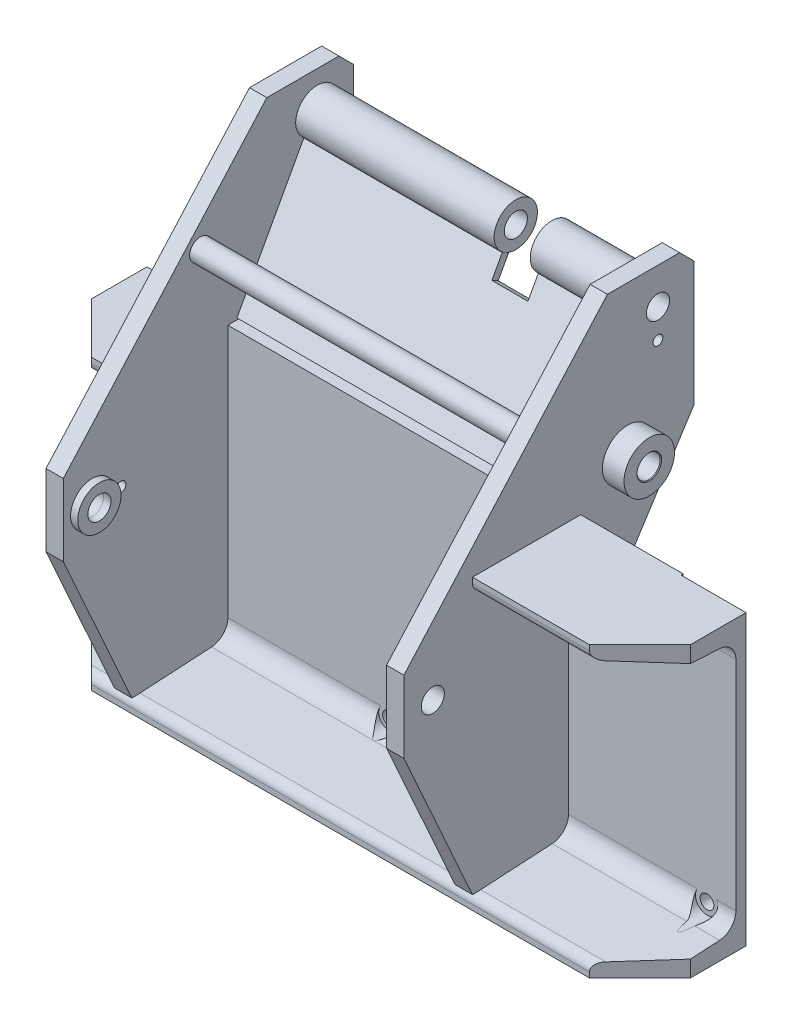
ISO-10303-21;
HEADER;
FILE_DESCRIPTION(('STEP AP214'),'2;1');
FILE_NAME('part.step','',(''),(''),'','','');
FILE_SCHEMA(('AUTOMOTIVE_DESIGN { 1 0 10303 214 1 1 1 1 }'));
ENDSEC;
DATA;
#1=APPLICATION_CONTEXT('core data for automotive mechanical design processes');
#2=APPLICATION_PROTOCOL_DEFINITION('international standard','automotive_design',2000,#1);
#3=PRODUCT_CONTEXT('',#1,'mechanical');
#4=PRODUCT('Part','Part','',(#3));
#5=PRODUCT_RELATED_PRODUCT_CATEGORY('part','',(#4));
#6=PRODUCT_DEFINITION_FORMATION('','',#4);
#7=PRODUCT_DEFINITION_CONTEXT('part definition',#1,'design');
#8=PRODUCT_DEFINITION('design','',#6,#7);
#9=PRODUCT_DEFINITION_SHAPE('','',#8);
#10=(LENGTH_UNIT() NAMED_UNIT(*) SI_UNIT(.MILLI.,.METRE.));
#11=(NAMED_UNIT(*) PLANE_ANGLE_UNIT() SI_UNIT($,.RADIAN.));
#12=(NAMED_UNIT(*) SI_UNIT($,.STERADIAN.) SOLID_ANGLE_UNIT());
#13=UNCERTAINTY_MEASURE_WITH_UNIT(LENGTH_MEASURE(1.E-05),#10,'distance_accuracy_value','');
#14=(GEOMETRIC_REPRESENTATION_CONTEXT(3) GLOBAL_UNCERTAINTY_ASSIGNED_CONTEXT((#13)) GLOBAL_UNIT_ASSIGNED_CONTEXT((#10,
#11,#12)) REPRESENTATION_CONTEXT('',''));
#15=CARTESIAN_POINT('',(0.,0.,0.));
#16=DIRECTION('',(0.,0.,1.));
#17=DIRECTION('',(1.,0.,0.));
#18=AXIS2_PLACEMENT_3D('',#15,#16,#17);
#19=CARTESIAN_POINT('',(-4.50000000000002,158.,-156.));
#20=DIRECTION('',(1.,0.,0.));
#21=DIRECTION('',(0.,0.,-1.));
#22=AXIS2_PLACEMENT_3D('',#19,#20,#21);
#23=CONICAL_SURFACE('',#22,7.99999999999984,1.02974425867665);
#24=CARTESIAN_POINT('',(-9.3068849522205,158.,-156.));
#25=VERTEX_POINT('',#24);
#26=VERTEX_LOOP('',#25);
#27=FACE_BOUND('',#26,.T.);
#28=CARTESIAN_POINT('',(-4.50000000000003,158.,-156.));
#29=DIRECTION('',(1.,0.,0.));
#30=DIRECTION('',(0.,0.,-1.));
#31=AXIS2_PLACEMENT_3D('',#28,#29,#30);
#32=CIRCLE('',#31,7.99999999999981);
#33=CARTESIAN_POINT('',(-4.50000000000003,158.,-164.));
#34=VERTEX_POINT('',#33);
#35=EDGE_CURVE('P0_E32',#34,#34,#32,.T.);
#36=ORIENTED_EDGE('',*,*,#35,.T.);
#37=EDGE_LOOP('',(#36));
#38=FACE_BOUND('',#37,.T.);
#39=ADVANCED_FACE('P0_F16',(#27,#38),#23,.F.);
#40=CARTESIAN_POINT('',(25.5,158.,-156.));
#41=DIRECTION('',(1.,0.,0.));
#42=DIRECTION('',(0.,0.,-1.));
#43=AXIS2_PLACEMENT_3D('',#40,#41,#42);
#44=CYLINDRICAL_SURFACE('',#43,7.99999999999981);
#45=CARTESIAN_POINT('',(25.5,158.,-156.));
#46=DIRECTION('',(1.,0.,0.));
#47=DIRECTION('',(0.,0.,-1.));
#48=AXIS2_PLACEMENT_3D('',#45,#46,#47);
#49=CIRCLE('',#48,7.99999999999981);
#50=CARTESIAN_POINT('',(25.5,158.,-164.));
#51=VERTEX_POINT('',#50);
#52=EDGE_CURVE('P0_E19',#51,#51,#49,.F.);
#53=ORIENTED_EDGE('',*,*,#52,.F.);
#54=EDGE_LOOP('',(#53));
#55=FACE_BOUND('',#54,.T.);
#56=ORIENTED_EDGE('',*,*,#35,.F.);
#57=EDGE_LOOP('',(#56));
#58=FACE_BOUND('',#57,.T.);
#59=ADVANCED_FACE('P0_F29',(#55,#58),#44,.F.);
#60=CARTESIAN_POINT('',(-112.,183.,-181.));
#61=DIRECTION('',(1.,0.,0.));
#62=DIRECTION('',(0.,1.,0.));
#63=AXIS2_PLACEMENT_3D('',#60,#61,#62);
#64=PLANE('',#63);
#65=CARTESIAN_POINT('',(-112.000000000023,158.,-156.));
#66=DIRECTION('',(1.,0.,0.));
#67=DIRECTION('',(0.,0.,-1.));
#68=AXIS2_PLACEMENT_3D('',#65,#66,#67);
#69=CIRCLE('',#68,15.);
#70=CARTESIAN_POINT('',(-112.000000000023,158.,-171.));
#71=VERTEX_POINT('',#70);
#72=EDGE_CURVE('P0_E23',#71,#71,#69,.T.);
#73=ORIENTED_EDGE('',*,*,#72,.F.);
#74=EDGE_LOOP('',(#73));
#75=FACE_BOUND('',#74,.T.);
#76=ADVANCED_FACE('P0_F41',(#75),#64,.F.);
#77=CARTESIAN_POINT('',(25.5,183.,-96.3032729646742));
#78=DIRECTION('',(1.,0.,0.));
#79=DIRECTION('',(0.,0.,-1.));
#80=AXIS2_PLACEMENT_3D('',#77,#78,#79);
#81=PLANE('',#80);
#82=CARTESIAN_POINT('',(25.5000000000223,158.,-156.));
#83=DIRECTION('',(1.,0.,0.));
#84=DIRECTION('',(0.,0.,-1.));
#85=AXIS2_PLACEMENT_3D('',#82,#83,#84);
#86=CIRCLE('',#85,15.);
#87=CARTESIAN_POINT('',(25.5000000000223,158.,-171.));
#88=VERTEX_POINT('',#87);
#89=EDGE_CURVE('P0_E11',#88,#88,#86,.F.);
#90=ORIENTED_EDGE('',*,*,#89,.F.);
#91=EDGE_LOOP('',(#90));
#92=FACE_BOUND('',#91,.T.);
#93=ORIENTED_EDGE('',*,*,#52,.T.);
#94=EDGE_LOOP('',(#93));
#95=FACE_BOUND('',#94,.T.);
#96=ADVANCED_FACE('P0_F43',(#92,#95),#81,.T.);
#97=CARTESIAN_POINT('',(-500000.,158.,-156.));
#98=DIRECTION('',(1.,0.,0.));
#99=DIRECTION('',(0.,0.,-1.));
#100=AXIS2_PLACEMENT_3D('',#97,#98,#99);
#101=CYLINDRICAL_SURFACE('',#100,15.);
#102=ORIENTED_EDGE('',*,*,#89,.T.);
#103=EDGE_LOOP('',(#102));
#104=FACE_BOUND('',#103,.T.);
#105=ORIENTED_EDGE('',*,*,#72,.T.);
#106=EDGE_LOOP('',(#105));
#107=FACE_BOUND('',#106,.T.);
#108=ADVANCED_FACE('P0_F39',(#104,#107),#101,.T.);
#109=CLOSED_SHELL('',(#39,#59,#76,#96,#108));
#110=MANIFOLD_SOLID_BREP('P0_B1',#109);
#111=CARTESIAN_POINT('',(27.8725830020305,158.,-156.));
#112=DIRECTION('',(1.,0.,0.));
#113=DIRECTION('',(0.,1.,0.));
#114=AXIS2_PLACEMENT_3D('',#111,#112,#113);
#115=CYLINDRICAL_SURFACE('',#114,8.00000000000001);
#116=CARTESIAN_POINT('',(112.,158.,-156.));
#117=DIRECTION('',(1.,0.,0.));
#118=DIRECTION('',(0.,1.,0.));
#119=AXIS2_PLACEMENT_3D('',#116,#117,#118);
#120=CIRCLE('',#119,8.00000000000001);
#121=CARTESIAN_POINT('',(112.,166.,-156.));
#122=VERTEX_POINT('',#121);
#123=EDGE_CURVE('P1_E26',#122,#122,#120,.T.);
#124=ORIENTED_EDGE('',*,*,#123,.T.);
#125=EDGE_LOOP('',(#124));
#126=FACE_BOUND('',#125,.T.);
#127=CARTESIAN_POINT('',(50.5,158.,-156.));
#128=DIRECTION('',(1.,0.,0.));
#129=DIRECTION('',(0.,1.,0.));
#130=AXIS2_PLACEMENT_3D('',#127,#128,#129);
#131=CIRCLE('',#130,8.00000000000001);
#132=CARTESIAN_POINT('',(50.5,166.,-156.));
#133=VERTEX_POINT('',#132);
#134=EDGE_CURVE('P1_E17',#133,#133,#131,.T.);
#135=ORIENTED_EDGE('',*,*,#134,.F.);
#136=EDGE_LOOP('',(#135));
#137=FACE_BOUND('',#136,.T.);
#138=ADVANCED_FACE('P1_F14',(#126,#137),#115,.F.);
#139=CARTESIAN_POINT('',(50.5,183.,-96.3032729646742));
#140=DIRECTION('',(-1.,0.,0.));
#141=DIRECTION('',(0.,0.,1.));
#142=AXIS2_PLACEMENT_3D('',#139,#140,#141);
#143=PLANE('',#142);
#144=CARTESIAN_POINT('',(50.4999999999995,158.,-156.));
#145=DIRECTION('',(1.,0.,0.));
#146=DIRECTION('',(0.,0.,-1.));
#147=AXIS2_PLACEMENT_3D('',#144,#145,#146);
#148=CIRCLE('',#147,15.);
#149=CARTESIAN_POINT('',(50.4999999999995,158.,-171.));
#150=VERTEX_POINT('',#149);
#151=EDGE_CURVE('P1_E21',#150,#150,#148,.T.);
#152=ORIENTED_EDGE('',*,*,#151,.F.);
#153=EDGE_LOOP('',(#152));
#154=FACE_BOUND('',#153,.T.);
#155=ORIENTED_EDGE('',*,*,#134,.T.);
#156=EDGE_LOOP('',(#155));
#157=FACE_BOUND('',#156,.T.);
#158=ADVANCED_FACE('P1_F34',(#154,#157),#143,.T.);
#159=CARTESIAN_POINT('',(112.,183.,-181.));
#160=DIRECTION('',(-1.,0.,0.));
#161=DIRECTION('',(0.,-1.,0.));
#162=AXIS2_PLACEMENT_3D('',#159,#160,#161);
#163=PLANE('',#162);
#164=CARTESIAN_POINT('',(112.000000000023,158.,-156.));
#165=DIRECTION('',(1.,0.,0.));
#166=DIRECTION('',(0.,0.,-1.));
#167=AXIS2_PLACEMENT_3D('',#164,#165,#166);
#168=CIRCLE('',#167,15.);
#169=CARTESIAN_POINT('',(112.000000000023,158.,-171.));
#170=VERTEX_POINT('',#169);
#171=EDGE_CURVE('P1_E10',#170,#170,#168,.F.);
#172=ORIENTED_EDGE('',*,*,#171,.F.);
#173=EDGE_LOOP('',(#172));
#174=FACE_BOUND('',#173,.T.);
#175=ORIENTED_EDGE('',*,*,#123,.F.);
#176=EDGE_LOOP('',(#175));
#177=FACE_BOUND('',#176,.T.);
#178=ADVANCED_FACE('P1_F41',(#174,#177),#163,.F.);
#179=CARTESIAN_POINT('',(-500000.,158.,-156.));
#180=DIRECTION('',(1.,0.,0.));
#181=DIRECTION('',(0.,0.,-1.));
#182=AXIS2_PLACEMENT_3D('',#179,#180,#181);
#183=CYLINDRICAL_SURFACE('',#182,15.);
#184=ORIENTED_EDGE('',*,*,#171,.T.);
#185=EDGE_LOOP('',(#184));
#186=FACE_BOUND('',#185,.T.);
#187=ORIENTED_EDGE('',*,*,#151,.T.);
#188=EDGE_LOOP('',(#187));
#189=FACE_BOUND('',#188,.T.);
#190=ADVANCED_FACE('P1_F43',(#186,#189),#183,.T.);
#191=CLOSED_SHELL('',(#138,#158,#178,#190));
#192=MANIFOLD_SOLID_BREP('P1_B1',#191);
#193=CARTESIAN_POINT('',(-240.,-140.,-27.5));
#194=DIRECTION('',(0.,0.,-1.));
#195=DIRECTION('',(0.,1.,0.));
#196=AXIS2_PLACEMENT_3D('',#193,#194,#195);
#197=PLANE('',#196);
#198=DIRECTION('',(0.,1.,0.));
#199=VECTOR('',#198,1.);
#200=CARTESIAN_POINT('',(-140.,183.,-27.5));
#201=LINE('',#200,#199);
#202=CARTESIAN_POINT('',(-140.,-136.325983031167,-27.5));
#203=VERTEX_POINT('',#202);
#204=CARTESIAN_POINT('',(-140.,-140.,-27.5));
#205=VERTEX_POINT('',#204);
#206=EDGE_CURVE('P2_E455',#203,#205,#201,.F.);
#207=ORIENTED_EDGE('',*,*,#206,.T.);
#208=DIRECTION('',(-1.,0.,0.));
#209=VECTOR('',#208,1.);
#210=CARTESIAN_POINT('',(-240.,-140.,-27.5));
#211=LINE('',#210,#209);
#212=CARTESIAN_POINT('',(205.,-140.,-27.5));
#213=VERTEX_POINT('',#212);
#214=EDGE_CURVE('P2_E1600',#205,#213,#211,.F.);
#215=ORIENTED_EDGE('',*,*,#214,.T.);
#216=DIRECTION('',(0.,1.,0.));
#217=VECTOR('',#216,1.);
#218=CARTESIAN_POINT('',(205.,183.,-27.5));
#219=LINE('',#218,#217);
#220=CARTESIAN_POINT('',(205.,-136.325983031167,-27.5));
#221=VERTEX_POINT('',#220);
#222=EDGE_CURVE('P2_E430',#213,#221,#219,.T.);
#223=ORIENTED_EDGE('',*,*,#222,.T.);
#224=DIRECTION('',(1.,0.,0.));
#225=VECTOR('',#224,1.);
#226=CARTESIAN_POINT('',(-240.,-136.325983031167,-27.5));
#227=LINE('',#226,#225);
#228=EDGE_CURVE('P2_E1543',#203,#221,#227,.T.);
#229=ORIENTED_EDGE('',*,*,#228,.F.);
#230=EDGE_LOOP('',(#207,#215,#223,#229));
#231=FACE_BOUND('',#230,.T.);
#232=ADVANCED_FACE('P2_F16',(#231),#197,.F.);
#233=CARTESIAN_POINT('',(205.,183.,-27.5));
#234=DIRECTION('',(-0.707106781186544,0.,-0.707106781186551));
#235=DIRECTION('',(-0.707106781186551,0.,0.707106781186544));
#236=AXIS2_PLACEMENT_3D('',#233,#234,#235);
#237=PLANE('',#236);
#238=ORIENTED_EDGE('',*,*,#222,.F.);
#239=DIRECTION('',(0.707106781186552,0.,-0.707106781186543));
#240=VECTOR('',#239,1.);
#241=CARTESIAN_POINT('',(205.,-140.,-27.5));
#242=LINE('',#241,#240);
#243=CARTESIAN_POINT('',(240.,-140.,-62.5));
#244=VERTEX_POINT('',#243);
#245=EDGE_CURVE('P2_E1488',#213,#244,#242,.T.);
#246=ORIENTED_EDGE('',*,*,#245,.T.);
#247=DIRECTION('',(0.,-1.,0.));
#248=VECTOR('',#247,1.);
#249=CARTESIAN_POINT('',(240.,-136.325983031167,-62.5));
#250=LINE('',#249,#248);
#251=CARTESIAN_POINT('',(240.,-128.644128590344,-62.5));
#252=VERTEX_POINT('',#251);
#253=EDGE_CURVE('P2_E451',#244,#252,#250,.F.);
#254=ORIENTED_EDGE('',*,*,#253,.T.);
#255=DIRECTION('',(-0.706519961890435,-0.0407318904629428,0.706519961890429));
#256=VECTOR('',#255,1.);
#257=CARTESIAN_POINT('',(240.,-128.644128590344,-62.5));
#258=LINE('',#257,#256);
#259=CARTESIAN_POINT('',(210.654664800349,-130.335929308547,-33.1546648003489));
#260=VERTEX_POINT('',#259);
#261=EDGE_CURVE('P2_E438',#252,#260,#258,.T.);
#262=ORIENTED_EDGE('',*,*,#261,.T.);
#263=CARTESIAN_POINT('',(211.,-136.325983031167,-33.5));
#264=DIRECTION('',(-0.707106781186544,0.,-0.707106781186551));
#265=DIRECTION('',(0.707106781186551,0.,-0.707106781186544));
#266=AXIS2_PLACEMENT_3D('',#263,#264,#265);
#267=ELLIPSE('',#266,8.48528137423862,6.00000000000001);
#268=EDGE_CURVE('P2_E1545',#221,#260,#267,.T.);
#269=ORIENTED_EDGE('',*,*,#268,.F.);
#270=EDGE_LOOP('',(#238,#246,#254,#262,#269));
#271=FACE_BOUND('',#270,.T.);
#272=ADVANCED_FACE('P2_F1806',(#271),#237,.F.);
#273=CARTESIAN_POINT('',(-240.,-115.5,-82.));
#274=DIRECTION('',(1.,0.,0.));
#275=DIRECTION('',(0.,1.,0.));
#276=AXIS2_PLACEMENT_3D('',#273,#274,#275);
#277=CYLINDRICAL_SURFACE('',#276,12.);
#278=DIRECTION('',(1.,0.,0.));
#279=VECTOR('',#278,1.);
#280=CARTESIAN_POINT('',(-240.,-127.480107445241,-82.6906703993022));
#281=LINE('',#280,#279);
#282=CARTESIAN_POINT('',(222.836898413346,-127.480107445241,-82.6906703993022));
#283=VERTEX_POINT('',#282);
#284=CARTESIAN_POINT('',(240.,-127.480107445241,-82.6906703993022));
#285=VERTEX_POINT('',#284);
#286=EDGE_CURVE('P2_E408',#283,#285,#281,.T.);
#287=ORIENTED_EDGE('',*,*,#286,.T.);
#288=CARTESIAN_POINT('',(240.,-115.5,-82.));
#289=DIRECTION('',(1.,0.,0.));
#290=DIRECTION('',(0.,1.,0.));
#291=AXIS2_PLACEMENT_3D('',#288,#289,#290);
#292=CIRCLE('',#291,12.);
#293=CARTESIAN_POINT('',(240.,-115.5,-94.));
#294=VERTEX_POINT('',#293);
#295=EDGE_CURVE('P2_E449',#285,#294,#292,.T.);
#296=ORIENTED_EDGE('',*,*,#295,.T.);
#297=DIRECTION('',(1.,0.,0.));
#298=VECTOR('',#297,1.);
#299=CARTESIAN_POINT('',(-240.,-115.5,-94.));
#300=LINE('',#299,#298);
#301=CARTESIAN_POINT('',(226.614378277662,-115.5,-94.));
#302=VERTEX_POINT('',#301);
#303=EDGE_CURVE('P2_E425',#294,#302,#300,.F.);
#304=ORIENTED_EDGE('',*,*,#303,.T.);
#305=CARTESIAN_POINT('',(226.614378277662,-115.5,-94.));
#306=CARTESIAN_POINT('',(226.724535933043,-115.661860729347,-94.0000227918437));
#307=CARTESIAN_POINT('',(226.828716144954,-115.827822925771,-93.9967259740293));
#308=CARTESIAN_POINT('',(227.024536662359,-116.166717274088,-93.9826587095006));
#309=CARTESIAN_POINT('',(227.116174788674,-116.339650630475,-93.9718869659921));
#310=CARTESIAN_POINT('',(227.286142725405,-116.690898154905,-93.9420602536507));
#311=CARTESIAN_POINT('',(227.364494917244,-116.869202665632,-93.9230194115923));
#312=CARTESIAN_POINT('',(227.507652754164,-117.230015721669,-93.8760319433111));
#313=CARTESIAN_POINT('',(227.572459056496,-117.412524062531,-93.8480857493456));
#314=CARTESIAN_POINT('',(227.693141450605,-117.795639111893,-93.7801093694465));
#315=CARTESIAN_POINT('',(227.747815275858,-117.996481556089,-93.7392632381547));
#316=CARTESIAN_POINT('',(227.840955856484,-118.399324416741,-93.6463151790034));
#317=CARTESIAN_POINT('',(227.879421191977,-118.601324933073,-93.5942122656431));
#318=CARTESIAN_POINT('',(227.940427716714,-119.004436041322,-93.4788005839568));
#319=CARTESIAN_POINT('',(227.962974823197,-119.205546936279,-93.4154959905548));
#320=CARTESIAN_POINT('',(227.992761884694,-119.605139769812,-93.2779650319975));
#321=CARTESIAN_POINT('',(228.000000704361,-119.803621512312,-93.2037378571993));
#322=CARTESIAN_POINT('',(227.999999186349,-120.226848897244,-93.0325315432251));
#323=CARTESIAN_POINT('',(227.990337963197,-120.450891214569,-92.9338092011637));
#324=CARTESIAN_POINT('',(227.953264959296,-120.891318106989,-92.7234922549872));
#325=CARTESIAN_POINT('',(227.925850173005,-121.107701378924,-92.6118954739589));
#326=CARTESIAN_POINT('',(227.854967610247,-121.531576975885,-92.3768443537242));
#327=CARTESIAN_POINT('',(227.811476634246,-121.739055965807,-92.2533730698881));
#328=CARTESIAN_POINT('',(227.710239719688,-122.143767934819,-91.9958947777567));
#329=CARTESIAN_POINT('',(227.652489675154,-122.340997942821,-91.8618847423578));
#330=CARTESIAN_POINT('',(227.508908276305,-122.771186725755,-91.5507285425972));
#331=CARTESIAN_POINT('',(227.419663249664,-123.001156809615,-91.3710224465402));
#332=CARTESIAN_POINT('',(227.225017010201,-123.443479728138,-90.999149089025));
#333=CARTESIAN_POINT('',(227.119611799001,-123.655828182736,-90.8069787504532));
#334=CARTESIAN_POINT('',(226.895297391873,-124.063130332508,-90.4115120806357));
#335=CARTESIAN_POINT('',(226.776361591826,-124.25804836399,-90.2081942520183));
#336=CARTESIAN_POINT('',(226.527766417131,-124.63015606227,-89.7921851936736));
#337=CARTESIAN_POINT('',(226.398106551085,-124.807344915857,-89.5794935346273));
#338=CARTESIAN_POINT('',(226.079483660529,-125.2084640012,-89.0632505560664));
#339=CARTESIAN_POINT('',(225.886724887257,-125.424532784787,-88.7559151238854));
#340=CARTESIAN_POINT('',(225.491196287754,-125.824596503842,-88.1271265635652));
#341=CARTESIAN_POINT('',(225.288422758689,-126.008579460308,-87.8056682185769));
#342=CARTESIAN_POINT('',(224.880002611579,-126.344684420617,-87.1505228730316));
#343=CARTESIAN_POINT('',(224.674372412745,-126.49694208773,-86.8168954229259));
#344=CARTESIAN_POINT('',(224.36927948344,-126.702575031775,-86.3053485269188));
#345=CARTESIAN_POINT('',(224.268117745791,-126.767339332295,-86.1329411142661));
#346=CARTESIAN_POINT('',(224.068370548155,-126.889269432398,-85.7840077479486));
#347=CARTESIAN_POINT('',(223.969784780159,-126.946436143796,-85.6074822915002));
#348=CARTESIAN_POINT('',(223.759661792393,-127.062705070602,-85.217512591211));
#349=CARTESIAN_POINT('',(223.648988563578,-127.120302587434,-85.0031436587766));
#350=CARTESIAN_POINT('',(223.438404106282,-127.224343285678,-84.5670905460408));
#351=CARTESIAN_POINT('',(223.33847046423,-127.270809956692,-84.3454229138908));
#352=CARTESIAN_POINT('',(223.154995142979,-127.352284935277,-83.8912489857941));
#353=CARTESIAN_POINT('',(223.07156344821,-127.387217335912,-83.6586819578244));
#354=CARTESIAN_POINT('',(222.931332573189,-127.444007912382,-83.1825686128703));
#355=CARTESIAN_POINT('',(222.87471852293,-127.465775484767,-82.9389583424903));
#356=CARTESIAN_POINT('',(222.836898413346,-127.480107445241,-82.6906703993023));
#357=B_SPLINE_CURVE_WITH_KNOTS('',3,(#305,#306,#307,#308,#309,#310,#311,#312,#313,#314,#315,
#316,#317,#318,#319,#320,#321,#322,#323,#324,#325,#326,#327,#328,#329,#330,#331,#332,#333,#334,
#335,#336,#337,#338,#339,#340,#341,#342,#343,#344,#345,#346,#347,#348,#349,#350,#351,#352,#353,
#354,#355,#356),.UNSPECIFIED.,.F.,.F.,(4,2,2,2,2,2,2,2,2,2,2,2,2,2,2,2,2,2,2,2,2,2,2,2,2,4),(0.,
0.587250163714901,1.17460223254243,1.76095480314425,2.34727891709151,2.98270192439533,
3.6181805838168,4.25342289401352,4.888712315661,5.62257429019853,6.35656053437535,
7.09161015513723,7.82687168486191,8.74110154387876,9.65555796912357,10.5718445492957,
11.4881731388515,12.7530929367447,14.0184839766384,15.2783475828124,15.9085686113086,
16.5387139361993,17.2823154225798,18.0243335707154,18.7711418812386,19.5230330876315),.UNSPECIFIED.);
#358=EDGE_CURVE('P2_E19',#302,#283,#357,.T.);
#359=ORIENTED_EDGE('',*,*,#358,.T.);
#360=EDGE_LOOP('',(#287,#296,#304,#359));
#361=FACE_BOUND('',#360,.T.);
#362=ADVANCED_FACE('P2_F423',(#361),#277,.F.);
#363=CARTESIAN_POINT('',(220.,-120.,20.));
#364=DIRECTION('',(0.,0.,-1.));
#365=DIRECTION('',(-1.,0.,0.));
#366=AXIS2_PLACEMENT_3D('',#363,#364,#365);
#367=CYLINDRICAL_SURFACE('',#366,8.00000000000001);
#368=CARTESIAN_POINT('',(213.385621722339,-115.5,-94.));
#369=CARTESIAN_POINT('',(213.275464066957,-115.661860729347,-94.0000227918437));
#370=CARTESIAN_POINT('',(213.171283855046,-115.827822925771,-93.9967259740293));
#371=CARTESIAN_POINT('',(212.975463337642,-116.166717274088,-93.9826587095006));
#372=CARTESIAN_POINT('',(212.883825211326,-116.339650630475,-93.9718869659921));
#373=CARTESIAN_POINT('',(212.713857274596,-116.690898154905,-93.9420602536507));
#374=CARTESIAN_POINT('',(212.635505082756,-116.869202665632,-93.9230194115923));
#375=CARTESIAN_POINT('',(212.492347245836,-117.230015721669,-93.8760319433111));
#376=CARTESIAN_POINT('',(212.427540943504,-117.412524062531,-93.8480857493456));
#377=CARTESIAN_POINT('',(212.306858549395,-117.795639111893,-93.7801093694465));
#378=CARTESIAN_POINT('',(212.252184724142,-117.996481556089,-93.7392632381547));
#379=CARTESIAN_POINT('',(212.159044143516,-118.399324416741,-93.6463151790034));
#380=CARTESIAN_POINT('',(212.120578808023,-118.601324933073,-93.5942122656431));
#381=CARTESIAN_POINT('',(212.059572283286,-119.004436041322,-93.4788005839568));
#382=CARTESIAN_POINT('',(212.037025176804,-119.205546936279,-93.4154959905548));
#383=CARTESIAN_POINT('',(212.007238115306,-119.605139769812,-93.2779650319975));
#384=CARTESIAN_POINT('',(211.999999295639,-119.803621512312,-93.2037378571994));
#385=CARTESIAN_POINT('',(212.000000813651,-120.226848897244,-93.0325315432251));
#386=CARTESIAN_POINT('',(212.009662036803,-120.450891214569,-92.9338092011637));
#387=CARTESIAN_POINT('',(212.046735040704,-120.891318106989,-92.7234922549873));
#388=CARTESIAN_POINT('',(212.074149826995,-121.107701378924,-92.6118954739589));
#389=CARTESIAN_POINT('',(212.145032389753,-121.531576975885,-92.3768443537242));
#390=CARTESIAN_POINT('',(212.188523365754,-121.739055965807,-92.2533730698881));
#391=CARTESIAN_POINT('',(212.289760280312,-122.143767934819,-91.9958947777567));
#392=CARTESIAN_POINT('',(212.347510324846,-122.340997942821,-91.8618847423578));
#393=CARTESIAN_POINT('',(212.491091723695,-122.771186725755,-91.5507285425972));
#394=CARTESIAN_POINT('',(212.580336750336,-123.001156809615,-91.3710224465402));
#395=CARTESIAN_POINT('',(212.774982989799,-123.443479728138,-90.999149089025));
#396=CARTESIAN_POINT('',(212.880388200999,-123.655828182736,-90.8069787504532));
#397=CARTESIAN_POINT('',(213.104702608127,-124.063130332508,-90.4115120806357));
#398=CARTESIAN_POINT('',(213.223638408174,-124.25804836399,-90.2081942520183));
#399=CARTESIAN_POINT('',(213.472233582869,-124.63015606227,-89.7921851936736));
#400=CARTESIAN_POINT('',(213.601893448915,-124.807344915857,-89.5794935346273));
#401=CARTESIAN_POINT('',(213.920516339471,-125.2084640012,-89.0632505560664));
#402=CARTESIAN_POINT('',(214.113275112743,-125.424532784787,-88.7559151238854));
#403=CARTESIAN_POINT('',(214.508803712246,-125.824596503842,-88.1271265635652));
#404=CARTESIAN_POINT('',(214.711577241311,-126.008579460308,-87.8056682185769));
#405=CARTESIAN_POINT('',(215.119997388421,-126.344684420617,-87.1505228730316));
#406=CARTESIAN_POINT('',(215.325627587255,-126.49694208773,-86.816895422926));
#407=CARTESIAN_POINT('',(215.63072051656,-126.702575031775,-86.3053485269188));
#408=CARTESIAN_POINT('',(215.731882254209,-126.767339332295,-86.1329411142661));
#409=CARTESIAN_POINT('',(215.931629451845,-126.889269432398,-85.7840077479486));
#410=CARTESIAN_POINT('',(216.030215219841,-126.946436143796,-85.6074822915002));
#411=CARTESIAN_POINT('',(216.240338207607,-127.062705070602,-85.217512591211));
#412=CARTESIAN_POINT('',(216.351011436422,-127.120302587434,-85.0031436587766));
#413=CARTESIAN_POINT('',(216.561595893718,-127.224343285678,-84.5670905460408));
#414=CARTESIAN_POINT('',(216.66152953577,-127.270809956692,-84.3454229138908));
#415=CARTESIAN_POINT('',(216.845004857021,-127.352284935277,-83.8912489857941));
#416=CARTESIAN_POINT('',(216.92843655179,-127.387217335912,-83.6586819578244));
#417=CARTESIAN_POINT('',(217.068667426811,-127.444007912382,-83.1825686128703));
#418=CARTESIAN_POINT('',(217.12528147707,-127.465775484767,-82.9389583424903));
#419=CARTESIAN_POINT('',(217.163101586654,-127.480107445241,-82.6906703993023));
#420=B_SPLINE_CURVE_WITH_KNOTS('',3,(#368,#369,#370,#371,#372,#373,#374,#375,#376,#377,#378,
#379,#380,#381,#382,#383,#384,#385,#386,#387,#388,#389,#390,#391,#392,#393,#394,#395,#396,#397,
#398,#399,#400,#401,#402,#403,#404,#405,#406,#407,#408,#409,#410,#411,#412,#413,#414,#415,#416,
#417,#418,#419),.UNSPECIFIED.,.F.,.F.,(4,2,2,2,2,2,2,2,2,2,2,2,2,2,2,2,2,2,2,2,2,2,2,2,2,4),(0.,
0.587250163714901,1.17460223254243,1.76095480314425,2.34727891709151,2.98270192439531,
3.6181805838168,4.2534228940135,4.88871231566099,5.6225742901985,6.35656053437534,
7.09161015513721,7.8268716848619,8.74110154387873,9.65555796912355,10.5718445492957,
11.4881731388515,12.7530929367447,14.0184839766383,15.2783475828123,15.9085686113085,
16.5387139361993,17.2823154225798,18.0243335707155,18.7711418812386,19.5230330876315),.UNSPECIFIED.);
#421=CARTESIAN_POINT('',(213.385621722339,-115.5,-94.));
#422=VERTEX_POINT('',#421);
#423=CARTESIAN_POINT('',(217.163101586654,-127.480107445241,-82.6906703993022));
#424=VERTEX_POINT('',#423);
#425=EDGE_CURVE('P2_E432',#422,#424,#420,.T.);
#426=ORIENTED_EDGE('',*,*,#425,.T.);
#427=CARTESIAN_POINT('',(220.,-120.,-212.43778419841));
#428=DIRECTION('',(0.,-0.998342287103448,-0.0575558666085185));
#429=DIRECTION('',(0.,0.0575558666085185,-0.998342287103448));
#430=AXIS2_PLACEMENT_3D('',#427,#428,#429);
#431=ELLIPSE('',#430,138.995387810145,8.00000000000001);
#432=EDGE_CURVE('P2_E413',#424,#283,#431,.F.);
#433=ORIENTED_EDGE('',*,*,#432,.T.);
#434=ORIENTED_EDGE('',*,*,#358,.F.);
#435=CARTESIAN_POINT('',(220.,-120.,-94.));
#436=DIRECTION('',(0.,0.,-1.));
#437=DIRECTION('',(-1.,0.,0.));
#438=AXIS2_PLACEMENT_3D('',#435,#436,#437);
#439=CIRCLE('',#438,8.00000000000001);
#440=EDGE_CURVE('P2_E767',#302,#422,#439,.T.);
#441=ORIENTED_EDGE('',*,*,#440,.T.);
#442=EDGE_LOOP('',(#426,#433,#434,#441));
#443=FACE_BOUND('',#442,.T.);
#444=ADVANCED_FACE('P2_F431',(#443),#367,.F.);
#445=CARTESIAN_POINT('',(-240.,35.4999999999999,-82.));
#446=DIRECTION('',(1.,0.,0.));
#447=DIRECTION('',(0.,1.,0.));
#448=AXIS2_PLACEMENT_3D('',#445,#446,#447);
#449=CYLINDRICAL_SURFACE('',#448,12.);
#450=DIRECTION('',(1.,0.,0.));
#451=VECTOR('',#450,1.);
#452=CARTESIAN_POINT('',(-240.,35.5,-94.));
#453=LINE('',#452,#451);
#454=CARTESIAN_POINT('',(226.614378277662,35.5,-94.));
#455=VERTEX_POINT('',#454);
#456=CARTESIAN_POINT('',(240.,35.5,-94.));
#457=VERTEX_POINT('',#456);
#458=EDGE_CURVE('P2_E773',#455,#457,#453,.T.);
#459=ORIENTED_EDGE('',*,*,#458,.T.);
#460=CARTESIAN_POINT('',(240.,35.5,-82.));
#461=DIRECTION('',(1.,0.,0.));
#462=DIRECTION('',(0.,1.,0.));
#463=AXIS2_PLACEMENT_3D('',#460,#461,#462);
#464=CIRCLE('',#463,12.);
#465=CARTESIAN_POINT('',(240.,47.4801074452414,-82.6906703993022));
#466=VERTEX_POINT('',#465);
#467=EDGE_CURVE('P2_E447',#457,#466,#464,.T.);
#468=ORIENTED_EDGE('',*,*,#467,.T.);
#469=DIRECTION('',(1.,0.,0.));
#470=VECTOR('',#469,1.);
#471=CARTESIAN_POINT('',(-240.,47.4801074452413,-82.6906703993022));
#472=LINE('',#471,#470);
#473=CARTESIAN_POINT('',(222.836898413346,47.4801074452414,-82.6906703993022));
#474=VERTEX_POINT('',#473);
#475=EDGE_CURVE('P2_E1369',#466,#474,#472,.F.);
#476=ORIENTED_EDGE('',*,*,#475,.T.);
#477=CARTESIAN_POINT('',(222.836898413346,47.4801074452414,-82.6906703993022));
#478=CARTESIAN_POINT('',(222.875102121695,47.4656320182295,-82.9414103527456));
#479=CARTESIAN_POINT('',(222.932453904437,47.4435779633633,-83.1873616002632));
#480=CARTESIAN_POINT('',(223.074584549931,47.3859699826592,-83.6679223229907));
#481=CARTESIAN_POINT('',(223.159172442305,47.3505097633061,-83.902598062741));
#482=CARTESIAN_POINT('',(223.345176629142,47.2677474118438,-84.360960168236));
#483=CARTESIAN_POINT('',(223.446492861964,47.2205148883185,-84.5847021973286));
#484=CARTESIAN_POINT('',(223.65990254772,47.1147264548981,-85.0247996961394));
#485=CARTESIAN_POINT('',(223.772018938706,47.0561461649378,-85.2411380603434));
#486=CARTESIAN_POINT('',(223.985951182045,46.9372180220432,-85.636813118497));
#487=CARTESIAN_POINT('',(224.086958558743,46.8783112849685,-85.8170299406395));
#488=CARTESIAN_POINT('',(224.29154724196,46.7525595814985,-86.1731943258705));
#489=CARTESIAN_POINT('',(224.395128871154,46.6857136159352,-86.3491413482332));
#490=CARTESIAN_POINT('',(224.70738205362,46.4733131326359,-86.8711052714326));
#491=CARTESIAN_POINT('',(224.91765228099,46.3158473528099,-87.2114060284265));
#492=CARTESIAN_POINT('',(225.334581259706,45.9679513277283,-87.8791266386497));
#493=CARTESIAN_POINT('',(225.54122345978,45.7773993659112,-88.2064932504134));
#494=CARTESIAN_POINT('',(225.943478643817,45.3626911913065,-88.8463513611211));
#495=CARTESIAN_POINT('',(226.139096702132,45.1385506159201,-89.1588496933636));
#496=CARTESIAN_POINT('',(226.451364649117,44.7351710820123,-89.6667705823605));
#497=CARTESIAN_POINT('',(226.572802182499,44.5654598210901,-89.8668521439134));
#498=CARTESIAN_POINT('',(226.805854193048,44.2101628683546,-90.2585079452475));
#499=CARTESIAN_POINT('',(226.917469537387,44.0245785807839,-90.4500829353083));
#500=CARTESIAN_POINT('',(227.128504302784,43.637706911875,-90.8232561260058));
#501=CARTESIAN_POINT('',(227.227941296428,43.4364428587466,-91.0048684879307));
#502=CARTESIAN_POINT('',(227.412365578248,43.0181225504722,-91.3569508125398));
#503=CARTESIAN_POINT('',(227.497354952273,42.8010685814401,-91.5274223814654));
#504=CARTESIAN_POINT('',(227.63997146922,42.3818224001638,-91.8335432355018));
#505=CARTESIAN_POINT('',(227.699738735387,42.181532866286,-91.9707985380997));
#506=CARTESIAN_POINT('',(227.80456486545,41.7702477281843,-92.2344329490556));
#507=CARTESIAN_POINT('',(227.849627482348,41.5592548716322,-92.3608148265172));
#508=CARTESIAN_POINT('',(227.923090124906,41.1280075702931,-92.6012436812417));
#509=CARTESIAN_POINT('',(227.951518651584,40.9077696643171,-92.7153114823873));
#510=CARTESIAN_POINT('',(227.989970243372,40.4593191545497,-92.930091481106));
#511=CARTESIAN_POINT('',(227.999998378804,40.2311087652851,-93.0308073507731));
#512=CARTESIAN_POINT('',(228.000001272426,39.8186099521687,-93.1976754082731));
#513=CARTESIAN_POINT('',(227.993826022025,39.6354344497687,-93.2666020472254));
#514=CARTESIAN_POINT('',(227.968461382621,39.2666671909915,-93.3951893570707));
#515=CARTESIAN_POINT('',(227.949268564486,39.0810748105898,-93.4548475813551));
#516=CARTESIAN_POINT('',(227.89736290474,38.7088864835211,-93.5646316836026));
#517=CARTESIAN_POINT('',(227.864645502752,38.5222902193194,-93.6147543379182));
#518=CARTESIAN_POINT('',(227.785427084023,38.149763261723,-93.7053616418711));
#519=CARTESIAN_POINT('',(227.738931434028,37.9638323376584,-93.7458500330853));
#520=CARTESIAN_POINT('',(227.627798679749,37.579280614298,-93.8202347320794));
#521=CARTESIAN_POINT('',(227.562004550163,37.3808398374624,-93.8533405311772));
#522=CARTESIAN_POINT('',(227.414466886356,36.9884139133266,-93.9089853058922));
#523=CARTESIAN_POINT('',(227.332719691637,36.7944298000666,-93.9315218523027));
#524=CARTESIAN_POINT('',(227.153471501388,36.4121715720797,-93.9668234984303));
#525=CARTESIAN_POINT('',(227.055918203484,36.2239189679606,-93.9795553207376));
#526=CARTESIAN_POINT('',(226.84604053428,35.8555038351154,-93.9961583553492));
#527=CARTESIAN_POINT('',(226.733721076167,35.6753386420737,-94.0000325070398));
#528=CARTESIAN_POINT('',(226.614378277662,35.5,-94.));
#529=B_SPLINE_CURVE_WITH_KNOTS('',3,(#477,#478,#479,#480,#481,#482,#483,#484,#485,#486,#487,
#488,#489,#490,#491,#492,#493,#494,#495,#496,#497,#498,#499,#500,#501,#502,#503,#504,#505,#506,
#507,#508,#509,#510,#511,#512,#513,#514,#515,#516,#517,#518,#519,#520,#521,#522,#523,#524,#525,
#526,#527,#528),.UNSPECIFIED.,.F.,.F.,(4,2,2,2,2,2,2,2,2,2,2,2,2,2,2,2,2,2,2,2,2,2,2,2,2,4),(0.,
0.759258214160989,1.51330464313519,2.26299405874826,3.014312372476,3.65858035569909,
4.30292950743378,5.59105676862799,6.88402724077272,8.1763976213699,9.04308559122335,
9.90969696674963,10.7750427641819,11.6402635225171,12.3896099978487,13.1387650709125,
13.8866327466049,14.6342943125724,15.2211105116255,15.8080813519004,16.3952502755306,
16.9821907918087,17.6162667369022,18.2504883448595,18.8868531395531,19.5230067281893),.UNSPECIFIED.);
#530=EDGE_CURVE('P2_E429',#474,#455,#529,.T.);
#531=ORIENTED_EDGE('',*,*,#530,.T.);
#532=EDGE_LOOP('',(#459,#468,#476,#531));
#533=FACE_BOUND('',#532,.T.);
#534=ADVANCED_FACE('P2_F1797',(#533),#449,.F.);
#535=CARTESIAN_POINT('',(220.,40.,20.));
#536=DIRECTION('',(0.,0.,-1.));
#537=DIRECTION('',(-1.,0.,0.));
#538=AXIS2_PLACEMENT_3D('',#535,#536,#537);
#539=CYLINDRICAL_SURFACE('',#538,8.00000000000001);
#540=ORIENTED_EDGE('',*,*,#530,.F.);
#541=CARTESIAN_POINT('',(220.,40.,-212.437784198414));
#542=DIRECTION('',(0.,0.998342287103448,-0.0575558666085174));
#543=DIRECTION('',(0.,-0.0575558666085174,-0.998342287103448));
#544=AXIS2_PLACEMENT_3D('',#541,#542,#543);
#545=ELLIPSE('',#544,138.995387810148,8.00000000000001);
#546=CARTESIAN_POINT('',(217.163101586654,47.4801074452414,-82.6906703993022));
#547=VERTEX_POINT('',#546);
#548=EDGE_CURVE('P2_E766',#474,#547,#545,.F.);
#549=ORIENTED_EDGE('',*,*,#548,.T.);
#550=CARTESIAN_POINT('',(217.163101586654,47.4801074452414,-82.6906703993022));
#551=CARTESIAN_POINT('',(217.124897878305,47.4656320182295,-82.9414103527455));
#552=CARTESIAN_POINT('',(217.067546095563,47.4435779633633,-83.1873616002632));
#553=CARTESIAN_POINT('',(216.92541545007,47.3859699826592,-83.6679223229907));
#554=CARTESIAN_POINT('',(216.840827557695,47.3505097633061,-83.9025980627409));
#555=CARTESIAN_POINT('',(216.654823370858,47.2677474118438,-84.360960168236));
#556=CARTESIAN_POINT('',(216.553507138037,47.2205148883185,-84.5847021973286));
#557=CARTESIAN_POINT('',(216.34009745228,47.1147264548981,-85.0247996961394));
#558=CARTESIAN_POINT('',(216.227981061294,47.0561461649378,-85.2411380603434));
#559=CARTESIAN_POINT('',(216.014048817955,46.9372180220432,-85.636813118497));
#560=CARTESIAN_POINT('',(215.913041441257,46.8783112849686,-85.8170299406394));
#561=CARTESIAN_POINT('',(215.708452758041,46.7525595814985,-86.1731943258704));
#562=CARTESIAN_POINT('',(215.604871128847,46.6857136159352,-86.3491413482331));
#563=CARTESIAN_POINT('',(215.29261794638,46.473313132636,-86.8711052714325));
#564=CARTESIAN_POINT('',(215.08234771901,46.3158473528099,-87.2114060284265));
#565=CARTESIAN_POINT('',(214.665418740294,45.9679513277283,-87.8791266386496));
#566=CARTESIAN_POINT('',(214.45877654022,45.7773993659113,-88.2064932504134));
#567=CARTESIAN_POINT('',(214.056521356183,45.3626911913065,-88.846351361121));
#568=CARTESIAN_POINT('',(213.860903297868,45.1385506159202,-89.1588496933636));
#569=CARTESIAN_POINT('',(213.548635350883,44.7351710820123,-89.6667705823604));
#570=CARTESIAN_POINT('',(213.427197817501,44.5654598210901,-89.8668521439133));
#571=CARTESIAN_POINT('',(213.194145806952,44.2101628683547,-90.2585079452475));
#572=CARTESIAN_POINT('',(213.082530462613,44.024578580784,-90.4500829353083));
#573=CARTESIAN_POINT('',(212.871495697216,43.6377069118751,-90.8232561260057));
#574=CARTESIAN_POINT('',(212.772058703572,43.4364428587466,-91.0048684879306));
#575=CARTESIAN_POINT('',(212.587634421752,43.0181225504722,-91.3569508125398));
#576=CARTESIAN_POINT('',(212.502645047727,42.8010685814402,-91.5274223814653));
#577=CARTESIAN_POINT('',(212.36002853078,42.3818224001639,-91.8335432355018));
#578=CARTESIAN_POINT('',(212.300261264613,42.1815328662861,-91.9707985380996));
#579=CARTESIAN_POINT('',(212.19543513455,41.7702477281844,-92.2344329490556));
#580=CARTESIAN_POINT('',(212.150372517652,41.5592548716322,-92.3608148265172));
#581=CARTESIAN_POINT('',(212.076909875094,41.1280075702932,-92.6012436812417));
#582=CARTESIAN_POINT('',(212.048481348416,40.9077696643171,-92.7153114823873));
#583=CARTESIAN_POINT('',(212.010029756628,40.4593191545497,-92.930091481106));
#584=CARTESIAN_POINT('',(212.000001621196,40.2311087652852,-93.0308073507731));
#585=CARTESIAN_POINT('',(211.999998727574,39.8186099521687,-93.1976754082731));
#586=CARTESIAN_POINT('',(212.006173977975,39.6354344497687,-93.2666020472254));
#587=CARTESIAN_POINT('',(212.031538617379,39.2666671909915,-93.3951893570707));
#588=CARTESIAN_POINT('',(212.050731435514,39.0810748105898,-93.4548475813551));
#589=CARTESIAN_POINT('',(212.10263709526,38.7088864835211,-93.5646316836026));
#590=CARTESIAN_POINT('',(212.135354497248,38.5222902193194,-93.6147543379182));
#591=CARTESIAN_POINT('',(212.214572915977,38.149763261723,-93.7053616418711));
#592=CARTESIAN_POINT('',(212.261068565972,37.9638323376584,-93.7458500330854));
#593=CARTESIAN_POINT('',(212.372201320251,37.579280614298,-93.8202347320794));
#594=CARTESIAN_POINT('',(212.437995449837,37.3808398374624,-93.8533405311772));
#595=CARTESIAN_POINT('',(212.585533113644,36.9884139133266,-93.9089853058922));
#596=CARTESIAN_POINT('',(212.667280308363,36.7944298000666,-93.9315218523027));
#597=CARTESIAN_POINT('',(212.846528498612,36.4121715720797,-93.9668234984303));
#598=CARTESIAN_POINT('',(212.944081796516,36.2239189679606,-93.9795553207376));
#599=CARTESIAN_POINT('',(213.15395946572,35.8555038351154,-93.9961583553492));
#600=CARTESIAN_POINT('',(213.266278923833,35.6753386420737,-94.0000325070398));
#601=CARTESIAN_POINT('',(213.385621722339,35.5,-94.));
#602=B_SPLINE_CURVE_WITH_KNOTS('',3,(#550,#551,#552,#553,#554,#555,#556,#557,#558,#559,#560,
#561,#562,#563,#564,#565,#566,#567,#568,#569,#570,#571,#572,#573,#574,#575,#576,#577,#578,#579,
#580,#581,#582,#583,#584,#585,#586,#587,#588,#589,#590,#591,#592,#593,#594,#595,#596,#597,#598,
#599,#600,#601),.UNSPECIFIED.,.F.,.F.,(4,2,2,2,2,2,2,2,2,2,2,2,2,2,2,2,2,2,2,2,2,2,2,2,2,4),(0.,
0.759258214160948,1.51330464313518,2.26299405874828,3.01431237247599,3.658580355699,
4.30292950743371,5.59105676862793,6.88402724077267,8.17639762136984,9.0430855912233,
9.90969696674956,10.7750427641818,11.640263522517,12.3896099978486,13.1387650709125,
13.8866327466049,14.6342943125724,15.2211105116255,15.8080813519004,16.3952502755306,
16.9821907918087,17.6162667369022,18.2504883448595,18.8868531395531,19.5230067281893),.UNSPECIFIED.);
#603=CARTESIAN_POINT('',(213.385621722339,35.5,-94.));
#604=VERTEX_POINT('',#603);
#605=EDGE_CURVE('P2_E758',#547,#604,#602,.T.);
#606=ORIENTED_EDGE('',*,*,#605,.T.);
#607=CARTESIAN_POINT('',(220.,40.,-94.));
#608=DIRECTION('',(0.,0.,-1.));
#609=DIRECTION('',(-1.,0.,0.));
#610=AXIS2_PLACEMENT_3D('',#607,#608,#609);
#611=CIRCLE('',#610,8.00000000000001);
#612=EDGE_CURVE('P2_E770',#604,#455,#611,.T.);
#613=ORIENTED_EDGE('',*,*,#612,.T.);
#614=EDGE_LOOP('',(#540,#549,#606,#613));
#615=FACE_BOUND('',#614,.T.);
#616=ADVANCED_FACE('P2_F688',(#615),#539,.F.);
#617=CARTESIAN_POINT('',(0.,-120.,20.));
#618=DIRECTION('',(0.,0.,-1.));
#619=DIRECTION('',(-1.,0.,0.));
#620=AXIS2_PLACEMENT_3D('',#617,#618,#619);
#621=CYLINDRICAL_SURFACE('',#620,7.5);
#622=CARTESIAN_POINT('',(-5.99999999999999,-115.5,-94.));
#623=CARTESIAN_POINT('',(-6.11215313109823,-115.649490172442,-94.0000185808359));
#624=CARTESIAN_POINT('',(-6.2186890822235,-115.80322557,-93.9972073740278));
#625=CARTESIAN_POINT('',(-6.4199253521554,-116.118072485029,-93.9851029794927));
#626=CARTESIAN_POINT('',(-6.514622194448,-116.279186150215,-93.9758078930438));
#627=CARTESIAN_POINT('',(-6.69156824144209,-116.607689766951,-93.9499042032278));
#628=CARTESIAN_POINT('',(-6.77380956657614,-116.775083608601,-93.9332909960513));
#629=CARTESIAN_POINT('',(-6.92527844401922,-117.114680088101,-93.8921002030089));
#630=CARTESIAN_POINT('',(-6.99450816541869,-117.286881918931,-93.8675239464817));
#631=CARTESIAN_POINT('',(-7.11979201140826,-117.635074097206,-93.8098547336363));
#632=CARTESIAN_POINT('',(-7.17581594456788,-117.811072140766,-93.7767426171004));
#633=CARTESIAN_POINT('',(-7.27436528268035,-118.164966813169,-93.7017376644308));
#634=CARTESIAN_POINT('',(-7.31689063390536,-118.342863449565,-93.6598447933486));
#635=CARTESIAN_POINT('',(-7.3884471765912,-118.698582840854,-93.5673144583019));
#636=CARTESIAN_POINT('',(-7.41751224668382,-118.876404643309,-93.5166993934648));
#637=CARTESIAN_POINT('',(-7.462602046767,-119.23092564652,-93.4067788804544));
#638=CARTESIAN_POINT('',(-7.47863365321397,-119.407625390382,-93.3474780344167));
#639=CARTESIAN_POINT('',(-7.4922969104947,-119.653016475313,-93.2586852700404));
#640=CARTESIAN_POINT('',(-7.49519583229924,-119.72274084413,-93.2327199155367));
#641=CARTESIAN_POINT('',(-7.49904750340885,-119.861727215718,-93.1794845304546));
#642=CARTESIAN_POINT('',(-7.50000063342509,-119.930989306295,-93.1522147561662));
#643=CARTESIAN_POINT('',(-7.49999801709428,-120.216034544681,-93.0369048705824));
#644=CARTESIAN_POINT('',(-7.49064942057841,-120.429605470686,-92.9431691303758));
#645=CARTESIAN_POINT('',(-7.45468530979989,-120.849835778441,-92.7439949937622));
#646=CARTESIAN_POINT('',(-7.42805489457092,-121.056489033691,-92.6385465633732));
#647=CARTESIAN_POINT('',(-7.3589998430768,-121.4620447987,-92.416699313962));
#648=CARTESIAN_POINT('',(-7.31651964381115,-121.660917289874,-92.300263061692));
#649=CARTESIAN_POINT('',(-7.21744190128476,-122.04906408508,-92.0579385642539));
#650=CARTESIAN_POINT('',(-7.16084588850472,-122.238339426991,-91.9320513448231));
#651=CARTESIAN_POINT('',(-7.01989926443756,-122.651311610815,-91.6403927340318));
#652=CARTESIAN_POINT('',(-6.93214646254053,-122.872242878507,-91.4723458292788));
#653=CARTESIAN_POINT('',(-6.74014659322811,-123.297716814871,-91.1252971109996));
#654=CARTESIAN_POINT('',(-6.63589471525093,-123.502254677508,-90.9462921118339));
#655=CARTESIAN_POINT('',(-6.41338783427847,-123.894786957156,-90.5790331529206));
#656=CARTESIAN_POINT('',(-6.29512918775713,-124.082777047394,-90.3907767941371));
#657=CARTESIAN_POINT('',(-6.04680890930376,-124.442278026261,-90.0065536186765));
#658=CARTESIAN_POINT('',(-5.91674691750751,-124.613788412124,-89.8105865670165));
#659=CARTESIAN_POINT('',(-5.59322612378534,-125.005336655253,-89.3333420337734));
#660=CARTESIAN_POINT('',(-5.39504058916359,-125.217734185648,-89.0489816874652));
#661=CARTESIAN_POINT('',(-4.98342262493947,-125.612201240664,-88.4703992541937));
#662=CARTESIAN_POINT('',(-4.76998396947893,-125.794258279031,-88.1761731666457));
#663=CARTESIAN_POINT('',(-4.33072100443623,-126.129548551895,-87.5794343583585));
#664=CARTESIAN_POINT('',(-4.10486906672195,-126.282713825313,-87.2769039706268));
#665=CARTESIAN_POINT('',(-3.64399770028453,-126.560769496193,-86.6660451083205));
#666=CARTESIAN_POINT('',(-3.40897987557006,-126.685664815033,-86.3577176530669));
#667=CARTESIAN_POINT('',(-2.95849498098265,-126.895797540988,-85.7711753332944));
#668=CARTESIAN_POINT('',(-2.74375529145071,-126.983898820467,-85.4934190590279));
#669=CARTESIAN_POINT('',(-2.31012839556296,-127.139070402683,-84.9352895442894));
#670=CARTESIAN_POINT('',(-2.0912411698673,-127.206140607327,-84.6549162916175));
#671=CARTESIAN_POINT('',(-1.65221112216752,-127.319236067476,-84.0944685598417));
#672=CARTESIAN_POINT('',(-1.43209052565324,-127.365417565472,-83.8144080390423));
#673=CARTESIAN_POINT('',(-0.990070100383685,-127.43772865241,-83.2532018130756));
#674=CARTESIAN_POINT('',(-0.768170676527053,-127.463862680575,-82.9720563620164));
#675=CARTESIAN_POINT('',(-0.545886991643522,-127.480107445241,-82.6906703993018));
#676=B_SPLINE_CURVE_WITH_KNOTS('',3,(#622,#623,#624,#625,#626,#627,#628,#629,#630,#631,#632,
#633,#634,#635,#636,#637,#638,#639,#640,#641,#642,#643,#644,#645,#646,#647,#648,#649,#650,#651,
#652,#653,#654,#655,#656,#657,#658,#659,#660,#661,#662,#663,#664,#665,#666,#667,#668,#669,#670,
#671,#672,#673,#674,#675),.UNSPECIFIED.,.F.,.F.,(4,2,2,2,2,2,2,2,2,2,2,2,2,2,2,2,2,2,2,2,2,2,2,
2,2,2,4),(0.,0.560537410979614,1.12123903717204,1.68229390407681,2.24325515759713,
2.80548671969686,3.36772051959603,3.92853141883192,4.48904624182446,4.7123917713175,
4.93569359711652,5.63472885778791,6.33436765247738,7.03648250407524,7.73852126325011,
8.61058658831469,9.48290664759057,10.3554541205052,11.2280282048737,12.4457578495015,
13.6639874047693,14.8850477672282,16.105895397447,17.191159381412,18.2764284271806,
19.3534399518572,20.4302129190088),.UNSPECIFIED.);
#677=CARTESIAN_POINT('',(-5.99999999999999,-115.5,-94.));
#678=VERTEX_POINT('',#677);
#679=CARTESIAN_POINT('',(-0.545886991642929,-127.480107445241,-82.6906703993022));
#680=VERTEX_POINT('',#679);
#681=EDGE_CURVE('P2_E674',#678,#680,#676,.T.);
#682=ORIENTED_EDGE('',*,*,#681,.T.);
#683=CARTESIAN_POINT('',(0.,-120.,-212.437784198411));
#684=DIRECTION('',(0.,-0.998342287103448,-0.0575558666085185));
#685=DIRECTION('',(0.,0.0575558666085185,-0.998342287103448));
#686=AXIS2_PLACEMENT_3D('',#683,#684,#685);
#687=ELLIPSE('',#686,130.308176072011,7.5);
#688=CARTESIAN_POINT('',(0.545886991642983,-127.480107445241,-82.6906703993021));
#689=VERTEX_POINT('',#688);
#690=EDGE_CURVE('P2_E682',#680,#689,#687,.F.);
#691=ORIENTED_EDGE('',*,*,#690,.T.);
#692=CARTESIAN_POINT('',(0.545886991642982,-127.480107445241,-82.6906703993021));
#693=CARTESIAN_POINT('',(0.70855425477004,-127.468229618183,-82.8965854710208));
#694=CARTESIAN_POINT('',(0.871008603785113,-127.451045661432,-83.1023663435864));
#695=CARTESIAN_POINT('',(1.19509827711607,-127.405979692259,-83.5134205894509));
#696=CARTESIAN_POINT('',(1.35673355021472,-127.378097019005,-83.7186939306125));
#697=CARTESIAN_POINT('',(1.67907322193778,-127.311486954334,-84.1288522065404));
#698=CARTESIAN_POINT('',(1.83977531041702,-127.272739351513,-84.3337356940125));
#699=CARTESIAN_POINT('',(2.15949078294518,-127.184295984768,-84.7424334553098));
#700=CARTESIAN_POINT('',(2.31850416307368,-127.134600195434,-84.9462477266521));
#701=CARTESIAN_POINT('',(2.7957576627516,-126.967654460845,-85.5600670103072));
#702=CARTESIAN_POINT('',(3.11076574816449,-126.83324494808,-85.9680770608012));
#703=CARTESIAN_POINT('',(3.72740663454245,-126.517387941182,-86.7754468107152));
#704=CARTESIAN_POINT('',(4.02905130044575,-126.335983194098,-87.1748140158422));
#705=CARTESIAN_POINT('',(4.50930548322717,-125.997418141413,-87.8211459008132));
#706=CARTESIAN_POINT('',(4.69341156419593,-125.854702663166,-88.0716442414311));
#707=CARTESIAN_POINT('',(5.05205287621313,-125.548188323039,-88.5664742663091));
#708=CARTESIAN_POINT('',(5.22659081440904,-125.384395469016,-88.8108076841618));
#709=CARTESIAN_POINT('',(5.56346610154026,-125.035521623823,-89.2912070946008));
#710=CARTESIAN_POINT('',(5.7258375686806,-124.850504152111,-89.5272951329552));
#711=CARTESIAN_POINT('',(6.03631247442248,-124.458192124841,-89.9901673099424));
#712=CARTESIAN_POINT('',(6.18441997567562,-124.250903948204,-90.2169540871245));
#713=CARTESIAN_POINT('',(6.42913655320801,-123.867113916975,-90.6050326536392));
#714=CARTESIAN_POINT('',(6.52948413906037,-123.695473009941,-90.7687828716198));
#715=CARTESIAN_POINT('',(6.718664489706,-123.339195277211,-91.0886921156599));
#716=CARTESIAN_POINT('',(6.80749729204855,-123.154558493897,-91.244851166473));
#717=CARTESIAN_POINT('',(6.97171738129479,-122.772771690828,-91.548094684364));
#718=CARTESIAN_POINT('',(7.04712533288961,-122.575641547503,-91.6951928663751));
#719=CARTESIAN_POINT('',(7.18264682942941,-122.16920662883,-91.9791342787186));
#720=CARTESIAN_POINT('',(7.24276612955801,-121.959906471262,-92.1159813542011));
#721=CARTESIAN_POINT('',(7.35987530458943,-121.470341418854,-92.4143318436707));
#722=CARTESIAN_POINT('',(7.41138711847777,-121.186476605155,-92.5721672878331));
#723=CARTESIAN_POINT('',(7.48144312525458,-120.603385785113,-92.8656234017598));
#724=CARTESIAN_POINT('',(7.4999914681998,-120.304161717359,-93.0012468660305));
#725=CARTESIAN_POINT('',(7.50000486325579,-119.826623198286,-93.1944385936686));
#726=CARTESIAN_POINT('',(7.49398582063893,-119.651642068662,-93.2604944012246));
#727=CARTESIAN_POINT('',(7.46930161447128,-119.299535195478,-93.3841248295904));
#728=CARTESIAN_POINT('',(7.45063575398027,-119.122409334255,-93.4416989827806));
#729=CARTESIAN_POINT('',(7.40018173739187,-118.767325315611,-93.5481152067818));
#730=CARTESIAN_POINT('',(7.36838841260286,-118.589366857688,-93.5969538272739));
#731=CARTESIAN_POINT('',(7.29141776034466,-118.234144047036,-93.685802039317));
#732=CARTESIAN_POINT('',(7.24624109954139,-118.056879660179,-93.7258120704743));
#733=CARTESIAN_POINT('',(7.14237078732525,-117.704270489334,-93.7971862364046));
#734=CARTESIAN_POINT('',(7.08365603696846,-117.528929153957,-93.8285367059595));
#735=CARTESIAN_POINT('',(6.952901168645,-117.181925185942,-93.882843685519));
#736=CARTESIAN_POINT('',(6.8808590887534,-117.010263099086,-93.9057989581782));
#737=CARTESIAN_POINT('',(6.72391533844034,-116.672291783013,-93.9438110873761));
#738=CARTESIAN_POINT('',(6.63902952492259,-116.505976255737,-93.958877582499));
#739=CARTESIAN_POINT('',(6.45687843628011,-116.179846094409,-93.9818409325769));
#740=CARTESIAN_POINT('',(6.35961971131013,-116.020028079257,-93.9897415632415));
#741=CARTESIAN_POINT('',(6.21554690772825,-115.802083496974,-93.9963576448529));
#742=CARTESIAN_POINT('',(6.17366075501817,-115.740723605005,-93.9977391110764));
#743=CARTESIAN_POINT('',(6.08814290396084,-115.619359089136,-93.9995594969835));
#744=CARTESIAN_POINT('',(6.04451398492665,-115.559352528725,-93.9999998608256));
#745=CARTESIAN_POINT('',(5.99999999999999,-115.5,-94.));
#746=B_SPLINE_CURVE_WITH_KNOTS('',3,(#692,#693,#694,#695,#696,#697,#698,#699,#700,#701,#702,
#703,#704,#705,#706,#707,#708,#709,#710,#711,#712,#713,#714,#715,#716,#717,#718,#719,#720,#721,
#722,#723,#724,#725,#726,#727,#728,#729,#730,#731,#732,#733,#734,#735,#736,#737,#738,#739,#740,
#741,#742,#743,#744,#745),.UNSPECIFIED.,.F.,.F.,(4,2,2,2,2,2,2,2,2,2,2,2,2,2,2,2,2,2,2,2,2,2,2,
2,2,2,4),(0.,0.788000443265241,1.57604956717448,2.36557449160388,3.15510124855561,
4.75092785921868,6.3453079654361,7.37079373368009,8.39598784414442,9.41819016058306,
10.4401004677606,11.212204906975,11.984306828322,12.7552097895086,13.5258221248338,
14.509858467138,15.4937709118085,16.0546159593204,16.6154919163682,17.1765889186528,
17.7376579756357,18.2996074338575,18.8616396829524,19.4229836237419,19.9840316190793,
20.2069196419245,20.4294653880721),.UNSPECIFIED.);
#747=CARTESIAN_POINT('',(5.99999999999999,-115.5,-94.));
#748=VERTEX_POINT('',#747);
#749=EDGE_CURVE('P2_E693',#689,#748,#746,.T.);
#750=ORIENTED_EDGE('',*,*,#749,.T.);
#751=CARTESIAN_POINT('',(0.,-120.,-94.));
#752=DIRECTION('',(0.,0.,-1.));
#753=DIRECTION('',(-1.,0.,0.));
#754=AXIS2_PLACEMENT_3D('',#751,#752,#753);
#755=CIRCLE('',#754,7.5);
#756=EDGE_CURVE('P2_E1229',#748,#678,#755,.T.);
#757=ORIENTED_EDGE('',*,*,#756,.T.);
#758=EDGE_LOOP('',(#682,#691,#750,#757));
#759=FACE_BOUND('',#758,.T.);
#760=ADVANCED_FACE('P2_F684',(#759),#621,.F.);
#761=CARTESIAN_POINT('',(-155.,40.,20.));
#762=DIRECTION('',(0.,0.,-1.));
#763=DIRECTION('',(-1.,0.,0.));
#764=AXIS2_PLACEMENT_3D('',#761,#762,#763);
#765=CYLINDRICAL_SURFACE('',#764,8.00000000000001);
#766=CARTESIAN_POINT('',(-148.385621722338,35.4999999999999,-94.));
#767=CARTESIAN_POINT('',(-148.275464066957,35.6618607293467,-94.0000227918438));
#768=CARTESIAN_POINT('',(-148.171283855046,35.8278229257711,-93.9967259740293));
#769=CARTESIAN_POINT('',(-147.975463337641,36.166717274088,-93.9826587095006));
#770=CARTESIAN_POINT('',(-147.883825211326,36.3396506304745,-93.9718869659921));
#771=CARTESIAN_POINT('',(-147.713857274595,36.6908981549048,-93.9420602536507));
#772=CARTESIAN_POINT('',(-147.635505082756,36.8692026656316,-93.9230194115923));
#773=CARTESIAN_POINT('',(-147.492347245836,37.2300157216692,-93.8760319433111));
#774=CARTESIAN_POINT('',(-147.427540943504,37.4125240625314,-93.8480857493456));
#775=CARTESIAN_POINT('',(-147.306858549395,37.795639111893,-93.7801093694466));
#776=CARTESIAN_POINT('',(-147.252184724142,37.9964815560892,-93.7392632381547));
#777=CARTESIAN_POINT('',(-147.159044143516,38.3993244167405,-93.6463151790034));
#778=CARTESIAN_POINT('',(-147.120578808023,38.6013249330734,-93.5942122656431));
#779=CARTESIAN_POINT('',(-147.059572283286,39.0044360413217,-93.4788005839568));
#780=CARTESIAN_POINT('',(-147.037025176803,39.2055469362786,-93.4154959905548));
#781=CARTESIAN_POINT('',(-147.007238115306,39.6051397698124,-93.2779650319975));
#782=CARTESIAN_POINT('',(-146.999999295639,39.803621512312,-93.2037378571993));
#783=CARTESIAN_POINT('',(-147.000000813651,40.2268488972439,-93.0325315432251));
#784=CARTESIAN_POINT('',(-147.009662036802,40.4508912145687,-92.9338092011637));
#785=CARTESIAN_POINT('',(-147.046735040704,40.8913181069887,-92.7234922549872));
#786=CARTESIAN_POINT('',(-147.074149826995,41.1077013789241,-92.6118954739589));
#787=CARTESIAN_POINT('',(-147.145032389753,41.5315769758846,-92.3768443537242));
#788=CARTESIAN_POINT('',(-147.188523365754,41.7390559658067,-92.2533730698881));
#789=CARTESIAN_POINT('',(-147.289760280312,42.1437679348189,-91.9958947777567));
#790=CARTESIAN_POINT('',(-147.347510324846,42.3409979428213,-91.8618847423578));
#791=CARTESIAN_POINT('',(-147.491091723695,42.7711867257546,-91.5507285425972));
#792=CARTESIAN_POINT('',(-147.580336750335,43.0011568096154,-91.3710224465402));
#793=CARTESIAN_POINT('',(-147.774982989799,43.4434797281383,-90.999149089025));
#794=CARTESIAN_POINT('',(-147.880388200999,43.6558281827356,-90.8069787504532));
#795=CARTESIAN_POINT('',(-148.104702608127,44.0631303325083,-90.4115120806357));
#796=CARTESIAN_POINT('',(-148.223638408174,44.2580483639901,-90.2081942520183));
#797=CARTESIAN_POINT('',(-148.472233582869,44.6301560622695,-89.7921851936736));
#798=CARTESIAN_POINT('',(-148.601893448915,44.8073449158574,-89.5794935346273));
#799=CARTESIAN_POINT('',(-148.920516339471,45.2084640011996,-89.0632505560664));
#800=CARTESIAN_POINT('',(-149.113275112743,45.424532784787,-88.7559151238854));
#801=CARTESIAN_POINT('',(-149.508803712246,45.8245965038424,-88.1271265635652));
#802=CARTESIAN_POINT('',(-149.711577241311,46.0085794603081,-87.8056682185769));
#803=CARTESIAN_POINT('',(-150.119997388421,46.3446844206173,-87.1505228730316));
#804=CARTESIAN_POINT('',(-150.325627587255,46.4969420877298,-86.816895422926));
#805=CARTESIAN_POINT('',(-150.63072051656,46.7025750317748,-86.3053485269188));
#806=CARTESIAN_POINT('',(-150.731882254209,46.7673393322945,-86.1329411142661));
#807=CARTESIAN_POINT('',(-150.931629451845,46.8892694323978,-85.7840077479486));
#808=CARTESIAN_POINT('',(-151.030215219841,46.9464361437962,-85.6074822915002));
#809=CARTESIAN_POINT('',(-151.240338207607,47.0627050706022,-85.217512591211));
#810=CARTESIAN_POINT('',(-151.351011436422,47.1203025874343,-85.0031436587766));
#811=CARTESIAN_POINT('',(-151.561595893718,47.2243432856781,-84.5670905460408));
#812=CARTESIAN_POINT('',(-151.66152953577,47.2708099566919,-84.3454229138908));
#813=CARTESIAN_POINT('',(-151.845004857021,47.3522849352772,-83.891248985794));
#814=CARTESIAN_POINT('',(-151.92843655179,47.3872173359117,-83.6586819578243));
#815=CARTESIAN_POINT('',(-152.068667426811,47.4440079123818,-83.1825686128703));
#816=CARTESIAN_POINT('',(-152.12528147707,47.4657754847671,-82.9389583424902));
#817=CARTESIAN_POINT('',(-152.163101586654,47.4801074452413,-82.6906703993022));
#818=B_SPLINE_CURVE_WITH_KNOTS('',3,(#766,#767,#768,#769,#770,#771,#772,#773,#774,#775,#776,
#777,#778,#779,#780,#781,#782,#783,#784,#785,#786,#787,#788,#789,#790,#791,#792,#793,#794,#795,
#796,#797,#798,#799,#800,#801,#802,#803,#804,#805,#806,#807,#808,#809,#810,#811,#812,#813,#814,
#815,#816,#817),.UNSPECIFIED.,.F.,.F.,(4,2,2,2,2,2,2,2,2,2,2,2,2,2,2,2,2,2,2,2,2,2,2,2,2,4),(0.,
0.587250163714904,1.17460223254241,1.76095480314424,2.34727891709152,2.98270192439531,
3.61818058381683,4.25342289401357,4.88871231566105,5.6225742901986,6.3565605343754,
7.09161015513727,7.82687168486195,8.74110154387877,9.65555796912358,10.5718445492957,
11.4881731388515,12.7530929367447,14.0184839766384,15.2783475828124,15.9085686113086,
16.5387139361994,17.2823154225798,18.0243335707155,18.7711418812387,19.5230330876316),.UNSPECIFIED.);
#819=CARTESIAN_POINT('',(-148.385621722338,35.4999999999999,-94.));
#820=VERTEX_POINT('',#819);
#821=CARTESIAN_POINT('',(-152.163101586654,47.4801074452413,-82.6906703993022));
#822=VERTEX_POINT('',#821);
#823=EDGE_CURVE('P2_E619',#820,#822,#818,.T.);
#824=ORIENTED_EDGE('',*,*,#823,.T.);
#825=CARTESIAN_POINT('',(-155.,40.,-212.437784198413));
#826=DIRECTION('',(0.,0.998342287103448,-0.0575558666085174));
#827=DIRECTION('',(0.,-0.0575558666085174,-0.998342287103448));
#828=AXIS2_PLACEMENT_3D('',#825,#826,#827);
#829=ELLIPSE('',#828,138.995387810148,8.00000000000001);
#830=CARTESIAN_POINT('',(-157.836898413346,47.4801074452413,-82.6906703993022));
#831=VERTEX_POINT('',#830);
#832=EDGE_CURVE('P2_E625',#822,#831,#829,.F.);
#833=ORIENTED_EDGE('',*,*,#832,.T.);
#834=CARTESIAN_POINT('',(-157.836898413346,47.4801074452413,-82.6906703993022));
#835=CARTESIAN_POINT('',(-157.875102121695,47.4656320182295,-82.9414103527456));
#836=CARTESIAN_POINT('',(-157.932453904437,47.4435779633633,-83.1873616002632));
#837=CARTESIAN_POINT('',(-158.07458454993,47.3859699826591,-83.6679223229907));
#838=CARTESIAN_POINT('',(-158.159172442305,47.3505097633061,-83.9025980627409));
#839=CARTESIAN_POINT('',(-158.345176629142,47.2677474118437,-84.360960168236));
#840=CARTESIAN_POINT('',(-158.446492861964,47.2205148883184,-84.5847021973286));
#841=CARTESIAN_POINT('',(-158.65990254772,47.114726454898,-85.0247996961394));
#842=CARTESIAN_POINT('',(-158.772018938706,47.0561461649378,-85.2411380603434));
#843=CARTESIAN_POINT('',(-158.985951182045,46.9372180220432,-85.636813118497));
#844=CARTESIAN_POINT('',(-159.086958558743,46.8783112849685,-85.8170299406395));
#845=CARTESIAN_POINT('',(-159.29154724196,46.7525595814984,-86.1731943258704));
#846=CARTESIAN_POINT('',(-159.395128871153,46.6857136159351,-86.3491413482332));
#847=CARTESIAN_POINT('',(-159.70738205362,46.4733131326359,-86.8711052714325));
#848=CARTESIAN_POINT('',(-159.91765228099,46.3158473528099,-87.2114060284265));
#849=CARTESIAN_POINT('',(-160.334581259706,45.9679513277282,-87.8791266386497));
#850=CARTESIAN_POINT('',(-160.54122345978,45.7773993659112,-88.2064932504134));
#851=CARTESIAN_POINT('',(-160.943478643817,45.3626911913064,-88.846351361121));
#852=CARTESIAN_POINT('',(-161.139096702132,45.1385506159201,-89.1588496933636));
#853=CARTESIAN_POINT('',(-161.451364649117,44.7351710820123,-89.6667705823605));
#854=CARTESIAN_POINT('',(-161.572802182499,44.5654598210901,-89.8668521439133));
#855=CARTESIAN_POINT('',(-161.805854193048,44.2101628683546,-90.2585079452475));
#856=CARTESIAN_POINT('',(-161.917469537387,44.0245785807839,-90.4500829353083));
#857=CARTESIAN_POINT('',(-162.128504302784,43.637706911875,-90.8232561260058));
#858=CARTESIAN_POINT('',(-162.227941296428,43.4364428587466,-91.0048684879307));
#859=CARTESIAN_POINT('',(-162.412365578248,43.0181225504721,-91.3569508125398));
#860=CARTESIAN_POINT('',(-162.497354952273,42.8010685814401,-91.5274223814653));
#861=CARTESIAN_POINT('',(-162.63997146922,42.3818224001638,-91.8335432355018));
#862=CARTESIAN_POINT('',(-162.699738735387,42.181532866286,-91.9707985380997));
#863=CARTESIAN_POINT('',(-162.80456486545,41.7702477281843,-92.2344329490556));
#864=CARTESIAN_POINT('',(-162.849627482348,41.5592548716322,-92.3608148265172));
#865=CARTESIAN_POINT('',(-162.923090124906,41.1280075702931,-92.6012436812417));
#866=CARTESIAN_POINT('',(-162.951518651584,40.9077696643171,-92.7153114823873));
#867=CARTESIAN_POINT('',(-162.989970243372,40.4593191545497,-92.930091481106));
#868=CARTESIAN_POINT('',(-162.999998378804,40.2311087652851,-93.0308073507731));
#869=CARTESIAN_POINT('',(-163.000001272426,39.8186099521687,-93.1976754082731));
#870=CARTESIAN_POINT('',(-162.993826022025,39.6354344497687,-93.2666020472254));
#871=CARTESIAN_POINT('',(-162.968461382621,39.2666671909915,-93.3951893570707));
#872=CARTESIAN_POINT('',(-162.949268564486,39.0810748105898,-93.4548475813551));
#873=CARTESIAN_POINT('',(-162.89736290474,38.7088864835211,-93.5646316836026));
#874=CARTESIAN_POINT('',(-162.864645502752,38.5222902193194,-93.6147543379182));
#875=CARTESIAN_POINT('',(-162.785427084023,38.149763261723,-93.7053616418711));
#876=CARTESIAN_POINT('',(-162.738931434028,37.9638323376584,-93.7458500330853));
#877=CARTESIAN_POINT('',(-162.627798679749,37.579280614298,-93.8202347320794));
#878=CARTESIAN_POINT('',(-162.562004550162,37.3808398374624,-93.8533405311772));
#879=CARTESIAN_POINT('',(-162.414466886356,36.9884139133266,-93.9089853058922));
#880=CARTESIAN_POINT('',(-162.332719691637,36.7944298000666,-93.9315218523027));
#881=CARTESIAN_POINT('',(-162.153471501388,36.4121715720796,-93.9668234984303));
#882=CARTESIAN_POINT('',(-162.055918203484,36.2239189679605,-93.9795553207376));
#883=CARTESIAN_POINT('',(-161.84604053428,35.8555038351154,-93.9961583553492));
#884=CARTESIAN_POINT('',(-161.733721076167,35.6753386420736,-94.0000325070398));
#885=CARTESIAN_POINT('',(-161.614378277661,35.4999999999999,-94.));
#886=B_SPLINE_CURVE_WITH_KNOTS('',3,(#834,#835,#836,#837,#838,#839,#840,#841,#842,#843,#844,
#845,#846,#847,#848,#849,#850,#851,#852,#853,#854,#855,#856,#857,#858,#859,#860,#861,#862,#863,
#864,#865,#866,#867,#868,#869,#870,#871,#872,#873,#874,#875,#876,#877,#878,#879,#880,#881,#882,
#883,#884,#885),.UNSPECIFIED.,.F.,.F.,(4,2,2,2,2,2,2,2,2,2,2,2,2,2,2,2,2,2,2,2,2,2,2,2,2,4),(0.,
0.759258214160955,1.51330464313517,2.26299405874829,3.01431237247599,3.65858035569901,
4.30292950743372,5.59105676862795,6.88402724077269,8.17639762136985,9.04308559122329,
9.90969696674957,10.7750427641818,11.640263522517,12.3896099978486,13.1387650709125,
13.8866327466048,14.6342943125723,15.2211105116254,15.8080813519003,16.3952502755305,
16.9821907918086,17.6162667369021,18.2504883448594,18.8868531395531,19.5230067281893),.UNSPECIFIED.);
#887=CARTESIAN_POINT('',(-161.614378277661,35.4999999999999,-94.));
#888=VERTEX_POINT('',#887);
#889=EDGE_CURVE('P2_E463',#831,#888,#886,.T.);
#890=ORIENTED_EDGE('',*,*,#889,.T.);
#891=CARTESIAN_POINT('',(-155.,40.,-94.));
#892=DIRECTION('',(0.,0.,-1.));
#893=DIRECTION('',(-1.,0.,0.));
#894=AXIS2_PLACEMENT_3D('',#891,#892,#893);
#895=CIRCLE('',#894,8.00000000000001);
#896=EDGE_CURVE('P2_E609',#888,#820,#895,.T.);
#897=ORIENTED_EDGE('',*,*,#896,.T.);
#898=EDGE_LOOP('',(#824,#833,#890,#897));
#899=FACE_BOUND('',#898,.T.);
#900=ADVANCED_FACE('P2_F491',(#899),#765,.F.);
#901=CARTESIAN_POINT('',(-155.,-120.,20.));
#902=DIRECTION('',(0.,0.,-1.));
#903=DIRECTION('',(-1.,0.,0.));
#904=AXIS2_PLACEMENT_3D('',#901,#902,#903);
#905=CYLINDRICAL_SURFACE('',#904,8.00000000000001);
#906=CARTESIAN_POINT('',(-152.163101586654,-127.480107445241,-82.6906703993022));
#907=CARTESIAN_POINT('',(-152.124897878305,-127.46563201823,-82.9414103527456));
#908=CARTESIAN_POINT('',(-152.067546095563,-127.443577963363,-83.1873616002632));
#909=CARTESIAN_POINT('',(-151.925415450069,-127.385969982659,-83.6679223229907));
#910=CARTESIAN_POINT('',(-151.840827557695,-127.350509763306,-83.902598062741));
#911=CARTESIAN_POINT('',(-151.654823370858,-127.267747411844,-84.360960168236));
#912=CARTESIAN_POINT('',(-151.553507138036,-127.220514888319,-84.5847021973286));
#913=CARTESIAN_POINT('',(-151.34009745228,-127.114726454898,-85.0247996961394));
#914=CARTESIAN_POINT('',(-151.227981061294,-127.056146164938,-85.2411380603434));
#915=CARTESIAN_POINT('',(-151.014048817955,-126.937218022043,-85.636813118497));
#916=CARTESIAN_POINT('',(-150.913041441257,-126.878311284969,-85.8170299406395));
#917=CARTESIAN_POINT('',(-150.70845275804,-126.752559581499,-86.1731943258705));
#918=CARTESIAN_POINT('',(-150.604871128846,-126.685713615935,-86.3491413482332));
#919=CARTESIAN_POINT('',(-150.29261794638,-126.473313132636,-86.8711052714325));
#920=CARTESIAN_POINT('',(-150.08234771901,-126.31584735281,-87.2114060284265));
#921=CARTESIAN_POINT('',(-149.665418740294,-125.967951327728,-87.8791266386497));
#922=CARTESIAN_POINT('',(-149.45877654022,-125.777399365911,-88.2064932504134));
#923=CARTESIAN_POINT('',(-149.056521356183,-125.362691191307,-88.846351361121));
#924=CARTESIAN_POINT('',(-148.860903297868,-125.13855061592,-89.1588496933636));
#925=CARTESIAN_POINT('',(-148.548635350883,-124.735171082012,-89.6667705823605));
#926=CARTESIAN_POINT('',(-148.427197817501,-124.56545982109,-89.8668521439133));
#927=CARTESIAN_POINT('',(-148.194145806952,-124.210162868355,-90.2585079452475));
#928=CARTESIAN_POINT('',(-148.082530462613,-124.024578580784,-90.4500829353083));
#929=CARTESIAN_POINT('',(-147.871495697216,-123.637706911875,-90.8232561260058));
#930=CARTESIAN_POINT('',(-147.772058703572,-123.436442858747,-91.0048684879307));
#931=CARTESIAN_POINT('',(-147.587634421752,-123.018122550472,-91.3569508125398));
#932=CARTESIAN_POINT('',(-147.502645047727,-122.80106858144,-91.5274223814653));
#933=CARTESIAN_POINT('',(-147.36002853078,-122.381822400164,-91.8335432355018));
#934=CARTESIAN_POINT('',(-147.300261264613,-122.181532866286,-91.9707985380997));
#935=CARTESIAN_POINT('',(-147.19543513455,-121.770247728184,-92.2344329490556));
#936=CARTESIAN_POINT('',(-147.150372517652,-121.559254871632,-92.3608148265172));
#937=CARTESIAN_POINT('',(-147.076909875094,-121.128007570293,-92.6012436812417));
#938=CARTESIAN_POINT('',(-147.048481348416,-120.907769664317,-92.7153114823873));
#939=CARTESIAN_POINT('',(-147.010029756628,-120.45931915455,-92.930091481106));
#940=CARTESIAN_POINT('',(-147.000001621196,-120.231108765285,-93.0308073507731));
#941=CARTESIAN_POINT('',(-146.999998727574,-119.818609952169,-93.1976754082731));
#942=CARTESIAN_POINT('',(-147.006173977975,-119.635434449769,-93.2666020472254));
#943=CARTESIAN_POINT('',(-147.031538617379,-119.266667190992,-93.3951893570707));
#944=CARTESIAN_POINT('',(-147.050731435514,-119.08107481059,-93.4548475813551));
#945=CARTESIAN_POINT('',(-147.10263709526,-118.708886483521,-93.5646316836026));
#946=CARTESIAN_POINT('',(-147.135354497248,-118.522290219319,-93.6147543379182));
#947=CARTESIAN_POINT('',(-147.214572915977,-118.149763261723,-93.7053616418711));
#948=CARTESIAN_POINT('',(-147.261068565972,-117.963832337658,-93.7458500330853));
#949=CARTESIAN_POINT('',(-147.372201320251,-117.579280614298,-93.8202347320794));
#950=CARTESIAN_POINT('',(-147.437995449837,-117.380839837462,-93.8533405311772));
#951=CARTESIAN_POINT('',(-147.585533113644,-116.988413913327,-93.9089853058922));
#952=CARTESIAN_POINT('',(-147.667280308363,-116.794429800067,-93.9315218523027));
#953=CARTESIAN_POINT('',(-147.846528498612,-116.41217157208,-93.9668234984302));
#954=CARTESIAN_POINT('',(-147.944081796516,-116.223918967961,-93.9795553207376));
#955=CARTESIAN_POINT('',(-148.15395946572,-115.855503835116,-93.9961583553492));
#956=CARTESIAN_POINT('',(-148.266278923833,-115.675338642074,-94.0000325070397));
#957=CARTESIAN_POINT('',(-148.385621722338,-115.5,-94.));
#958=B_SPLINE_CURVE_WITH_KNOTS('',3,(#906,#907,#908,#909,#910,#911,#912,#913,#914,#915,#916,
#917,#918,#919,#920,#921,#922,#923,#924,#925,#926,#927,#928,#929,#930,#931,#932,#933,#934,#935,
#936,#937,#938,#939,#940,#941,#942,#943,#944,#945,#946,#947,#948,#949,#950,#951,#952,#953,#954,
#955,#956,#957),.UNSPECIFIED.,.F.,.F.,(4,2,2,2,2,2,2,2,2,2,2,2,2,2,2,2,2,2,2,2,2,2,2,2,2,4),(0.,
0.759258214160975,1.51330464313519,2.2629940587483,3.01431237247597,3.65858035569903,
4.30292950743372,5.59105676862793,6.88402724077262,8.17639762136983,9.0430855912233,
9.90969696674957,10.7750427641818,11.640263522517,12.3896099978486,13.1387650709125,
13.8866327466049,14.6342943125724,15.2211105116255,15.8080813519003,16.3952502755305,
16.9821907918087,17.6162667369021,18.2504883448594,18.8868531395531,19.5230067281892),.UNSPECIFIED.);
#959=CARTESIAN_POINT('',(-152.163101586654,-127.480107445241,-82.6906703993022));
#960=VERTEX_POINT('',#959);
#961=CARTESIAN_POINT('',(-148.385621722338,-115.5,-94.));
#962=VERTEX_POINT('',#961);
#963=EDGE_CURVE('P2_E593',#960,#962,#958,.T.);
#964=ORIENTED_EDGE('',*,*,#963,.T.);
#965=CARTESIAN_POINT('',(-155.,-120.,-94.));
#966=DIRECTION('',(0.,0.,-1.));
#967=DIRECTION('',(-1.,0.,0.));
#968=AXIS2_PLACEMENT_3D('',#965,#966,#967);
#969=CIRCLE('',#968,8.00000000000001);
#970=CARTESIAN_POINT('',(-161.614378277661,-115.5,-94.));
#971=VERTEX_POINT('',#970);
#972=EDGE_CURVE('P2_E604',#962,#971,#969,.T.);
#973=ORIENTED_EDGE('',*,*,#972,.T.);
#974=CARTESIAN_POINT('',(-161.614378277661,-115.5,-94.));
#975=CARTESIAN_POINT('',(-161.724535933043,-115.661860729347,-94.0000227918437));
#976=CARTESIAN_POINT('',(-161.828716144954,-115.827822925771,-93.9967259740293));
#977=CARTESIAN_POINT('',(-162.024536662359,-116.166717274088,-93.9826587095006));
#978=CARTESIAN_POINT('',(-162.116174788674,-116.339650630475,-93.9718869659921));
#979=CARTESIAN_POINT('',(-162.286142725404,-116.690898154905,-93.9420602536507));
#980=CARTESIAN_POINT('',(-162.364494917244,-116.869202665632,-93.9230194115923));
#981=CARTESIAN_POINT('',(-162.507652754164,-117.230015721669,-93.8760319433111));
#982=CARTESIAN_POINT('',(-162.572459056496,-117.412524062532,-93.8480857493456));
#983=CARTESIAN_POINT('',(-162.693141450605,-117.795639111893,-93.7801093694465));
#984=CARTESIAN_POINT('',(-162.747815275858,-117.996481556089,-93.7392632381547));
#985=CARTESIAN_POINT('',(-162.840955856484,-118.399324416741,-93.6463151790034));
#986=CARTESIAN_POINT('',(-162.879421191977,-118.601324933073,-93.5942122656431));
#987=CARTESIAN_POINT('',(-162.940427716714,-119.004436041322,-93.4788005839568));
#988=CARTESIAN_POINT('',(-162.962974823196,-119.205546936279,-93.4154959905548));
#989=CARTESIAN_POINT('',(-162.992761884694,-119.605139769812,-93.2779650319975));
#990=CARTESIAN_POINT('',(-163.000000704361,-119.803621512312,-93.2037378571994));
#991=CARTESIAN_POINT('',(-162.999999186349,-120.226848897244,-93.0325315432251));
#992=CARTESIAN_POINT('',(-162.990337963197,-120.450891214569,-92.9338092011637));
#993=CARTESIAN_POINT('',(-162.953264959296,-120.891318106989,-92.7234922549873));
#994=CARTESIAN_POINT('',(-162.925850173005,-121.107701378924,-92.6118954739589));
#995=CARTESIAN_POINT('',(-162.854967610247,-121.531576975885,-92.3768443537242));
#996=CARTESIAN_POINT('',(-162.811476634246,-121.739055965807,-92.2533730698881));
#997=CARTESIAN_POINT('',(-162.710239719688,-122.143767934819,-91.9958947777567));
#998=CARTESIAN_POINT('',(-162.652489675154,-122.340997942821,-91.8618847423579));
#999=CARTESIAN_POINT('',(-162.508908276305,-122.771186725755,-91.5507285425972));
#1000=CARTESIAN_POINT('',(-162.419663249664,-123.001156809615,-91.3710224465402));
#1001=CARTESIAN_POINT('',(-162.225017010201,-123.443479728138,-90.999149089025));
#1002=CARTESIAN_POINT('',(-162.119611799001,-123.655828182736,-90.8069787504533));
#1003=CARTESIAN_POINT('',(-161.895297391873,-124.063130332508,-90.4115120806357));
#1004=CARTESIAN_POINT('',(-161.776361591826,-124.25804836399,-90.2081942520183));
#1005=CARTESIAN_POINT('',(-161.527766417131,-124.63015606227,-89.7921851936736));
#1006=CARTESIAN_POINT('',(-161.398106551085,-124.807344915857,-89.5794935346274));
#1007=CARTESIAN_POINT('',(-161.079483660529,-125.2084640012,-89.0632505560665));
#1008=CARTESIAN_POINT('',(-160.886724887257,-125.424532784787,-88.7559151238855));
#1009=CARTESIAN_POINT('',(-160.491196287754,-125.824596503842,-88.1271265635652));
#1010=CARTESIAN_POINT('',(-160.288422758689,-126.008579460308,-87.8056682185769));
#1011=CARTESIAN_POINT('',(-159.880002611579,-126.344684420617,-87.1505228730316));
#1012=CARTESIAN_POINT('',(-159.674372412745,-126.49694208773,-86.816895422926));
#1013=CARTESIAN_POINT('',(-159.36927948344,-126.702575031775,-86.3053485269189));
#1014=CARTESIAN_POINT('',(-159.268117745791,-126.767339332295,-86.1329411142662));
#1015=CARTESIAN_POINT('',(-159.068370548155,-126.889269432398,-85.7840077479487));
#1016=CARTESIAN_POINT('',(-158.969784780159,-126.946436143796,-85.6074822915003));
#1017=CARTESIAN_POINT('',(-158.759661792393,-127.062705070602,-85.2175125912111));
#1018=CARTESIAN_POINT('',(-158.648988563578,-127.120302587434,-85.0031436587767));
#1019=CARTESIAN_POINT('',(-158.438404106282,-127.224343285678,-84.5670905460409));
#1020=CARTESIAN_POINT('',(-158.33847046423,-127.270809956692,-84.3454229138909));
#1021=CARTESIAN_POINT('',(-158.154995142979,-127.352284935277,-83.8912489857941));
#1022=CARTESIAN_POINT('',(-158.07156344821,-127.387217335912,-83.6586819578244));
#1023=CARTESIAN_POINT('',(-157.931332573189,-127.444007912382,-83.1825686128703));
#1024=CARTESIAN_POINT('',(-157.87471852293,-127.465775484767,-82.9389583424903));
#1025=CARTESIAN_POINT('',(-157.836898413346,-127.480107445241,-82.6906703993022));
#1026=B_SPLINE_CURVE_WITH_KNOTS('',3,(#974,#975,#976,#977,#978,#979,#980,#981,#982,#983,#984,
#985,#986,#987,#988,#989,#990,#991,#992,#993,#994,#995,#996,#997,#998,#999,#1000,#1001,#1002,
#1003,#1004,#1005,#1006,#1007,#1008,#1009,#1010,#1011,#1012,#1013,#1014,#1015,#1016,#1017,#1018,
#1019,#1020,#1021,#1022,#1023,#1024,#1025),.UNSPECIFIED.,.F.,.F.,(4,2,2,2,2,2,2,2,2,2,2,2,2,2,2,
2,2,2,2,2,2,2,2,2,2,4),(0.,0.58725016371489,1.17460223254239,1.76095480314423,2.34727891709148,
2.98270192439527,3.61818058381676,4.25342289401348,4.88871231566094,5.62257429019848,
6.3565605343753,7.09161015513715,7.82687168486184,8.74110154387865,9.65555796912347,
10.5718445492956,11.4881731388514,12.7530929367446,14.0184839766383,15.2783475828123,
15.9085686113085,16.5387139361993,17.2823154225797,18.0243335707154,18.7711418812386,
19.5230330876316),.UNSPECIFIED.);
#1027=CARTESIAN_POINT('',(-157.836898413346,-127.480107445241,-82.6906703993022));
#1028=VERTEX_POINT('',#1027);
#1029=EDGE_CURVE('P2_E456',#971,#1028,#1026,.T.);
#1030=ORIENTED_EDGE('',*,*,#1029,.T.);
#1031=CARTESIAN_POINT('',(-155.,-120.,-212.437784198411));
#1032=DIRECTION('',(0.,-0.998342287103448,-0.0575558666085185));
#1033=DIRECTION('',(0.,0.0575558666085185,-0.998342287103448));
#1034=AXIS2_PLACEMENT_3D('',#1031,#1032,#1033);
#1035=ELLIPSE('',#1034,138.995387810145,8.00000000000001);
#1036=EDGE_CURVE('P2_E602',#1028,#960,#1035,.F.);
#1037=ORIENTED_EDGE('',*,*,#1036,.T.);
#1038=EDGE_LOOP('',(#964,#973,#1030,#1037));
#1039=FACE_BOUND('',#1038,.T.);
#1040=ADVANCED_FACE('P2_F470',(#1039),#905,.F.);
#1041=CARTESIAN_POINT('',(-240.,-136.325983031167,-33.5));
#1042=DIRECTION('',(1.,0.,0.));
#1043=DIRECTION('',(0.,1.,0.));
#1044=AXIS2_PLACEMENT_3D('',#1041,#1042,#1043);
#1045=CYLINDRICAL_SURFACE('',#1044,6.00000000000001);
#1046=DIRECTION('',(1.,0.,0.));
#1047=VECTOR('',#1046,1.);
#1048=CARTESIAN_POINT('',(-124.,-130.5,-32.0654541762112));
#1049=LINE('',#1048,#1047);
#1050=CARTESIAN_POINT('',(-124.,-130.5,-32.0654541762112));
#1051=VERTEX_POINT('',#1050);
#1052=CARTESIAN_POINT('',(-112.,-130.5,-32.0654541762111));
#1053=VERTEX_POINT('',#1052);
#1054=EDGE_CURVE('P2_E1699',#1051,#1053,#1049,.T.);
#1055=ORIENTED_EDGE('',*,*,#1054,.F.);
#1056=CARTESIAN_POINT('',(-124.,-136.325983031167,-33.5));
#1057=DIRECTION('',(1.,0.,0.));
#1058=DIRECTION('',(0.,1.,0.));
#1059=AXIS2_PLACEMENT_3D('',#1056,#1057,#1058);
#1060=CIRCLE('',#1059,6.00000000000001);
#1061=CARTESIAN_POINT('',(-124.,-130.335929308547,-33.1546648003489));
#1062=VERTEX_POINT('',#1061);
#1063=EDGE_CURVE('P2_E1714',#1051,#1062,#1060,.F.);
#1064=ORIENTED_EDGE('',*,*,#1063,.T.);
#1065=DIRECTION('',(1.,0.,0.));
#1066=VECTOR('',#1065,1.);
#1067=CARTESIAN_POINT('',(-240.,-130.335929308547,-33.1546648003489));
#1068=LINE('',#1067,#1066);
#1069=CARTESIAN_POINT('',(-145.654664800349,-130.335929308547,-33.1546648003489));
#1070=VERTEX_POINT('',#1069);
#1071=EDGE_CURVE('P2_E1194',#1062,#1070,#1068,.F.);
#1072=ORIENTED_EDGE('',*,*,#1071,.T.);
#1073=CARTESIAN_POINT('',(-146.,-136.325983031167,-33.5));
#1074=DIRECTION('',(0.707106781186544,0.,-0.707106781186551));
#1075=DIRECTION('',(0.707106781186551,0.,0.707106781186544));
#1076=AXIS2_PLACEMENT_3D('',#1073,#1074,#1075);
#1077=ELLIPSE('',#1076,8.48528137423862,6.00000000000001);
#1078=EDGE_CURVE('P2_E452',#1070,#203,#1077,.T.);
#1079=ORIENTED_EDGE('',*,*,#1078,.T.);
#1080=ORIENTED_EDGE('',*,*,#228,.T.);
#1081=ORIENTED_EDGE('',*,*,#268,.T.);
#1082=DIRECTION('',(1.,0.,0.));
#1083=VECTOR('',#1082,1.);
#1084=CARTESIAN_POINT('',(-240.,-130.335929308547,-33.1546648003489));
#1085=LINE('',#1084,#1083);
#1086=CARTESIAN_POINT('',(124.,-130.335929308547,-33.1546648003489));
#1087=VERTEX_POINT('',#1086);
#1088=EDGE_CURVE('P2_E434',#260,#1087,#1085,.F.);
#1089=ORIENTED_EDGE('',*,*,#1088,.T.);
#1090=CARTESIAN_POINT('',(124.,-136.325983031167,-33.5));
#1091=DIRECTION('',(1.,0.,0.));
#1092=DIRECTION('',(0.,1.,0.));
#1093=AXIS2_PLACEMENT_3D('',#1090,#1091,#1092);
#1094=CIRCLE('',#1093,6.00000000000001);
#1095=CARTESIAN_POINT('',(124.,-130.5,-32.0654541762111));
#1096=VERTEX_POINT('',#1095);
#1097=EDGE_CURVE('P2_E1792',#1087,#1096,#1094,.T.);
#1098=ORIENTED_EDGE('',*,*,#1097,.T.);
#1099=DIRECTION('',(1.,0.,0.));
#1100=VECTOR('',#1099,1.);
#1101=CARTESIAN_POINT('',(124.,-130.5,-32.0654541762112));
#1102=LINE('',#1101,#1100);
#1103=CARTESIAN_POINT('',(112.,-130.5,-32.0654541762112));
#1104=VERTEX_POINT('',#1103);
#1105=EDGE_CURVE('P2_E699',#1104,#1096,#1102,.T.);
#1106=ORIENTED_EDGE('',*,*,#1105,.F.);
#1107=CARTESIAN_POINT('',(112.,-136.325983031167,-33.5));
#1108=DIRECTION('',(1.,0.,0.));
#1109=DIRECTION('',(0.,1.,0.));
#1110=AXIS2_PLACEMENT_3D('',#1107,#1108,#1109);
#1111=CIRCLE('',#1110,6.00000000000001);
#1112=CARTESIAN_POINT('',(112.,-130.335929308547,-33.1546648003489));
#1113=VERTEX_POINT('',#1112);
#1114=EDGE_CURVE('P2_E1788',#1104,#1113,#1111,.F.);
#1115=ORIENTED_EDGE('',*,*,#1114,.T.);
#1116=DIRECTION('',(1.,0.,0.));
#1117=VECTOR('',#1116,1.);
#1118=CARTESIAN_POINT('',(-240.,-130.335929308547,-33.1546648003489));
#1119=LINE('',#1118,#1117);
#1120=CARTESIAN_POINT('',(-112.,-130.335929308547,-33.1546648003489));
#1121=VERTEX_POINT('',#1120);
#1122=EDGE_CURVE('P2_E1251',#1113,#1121,#1119,.F.);
#1123=ORIENTED_EDGE('',*,*,#1122,.T.);
#1124=CARTESIAN_POINT('',(-112.,-136.325983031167,-33.5));
#1125=DIRECTION('',(1.,0.,0.));
#1126=DIRECTION('',(0.,1.,0.));
#1127=AXIS2_PLACEMENT_3D('',#1124,#1125,#1126);
#1128=CIRCLE('',#1127,6.00000000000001);
#1129=EDGE_CURVE('P2_E1787',#1121,#1053,#1128,.T.);
#1130=ORIENTED_EDGE('',*,*,#1129,.T.);
#1131=EDGE_LOOP('',(#1055,#1064,#1072,#1079,#1080,#1081,#1089,#1098,#1106,#1115,#1123,#1130));
#1132=FACE_BOUND('',#1131,.T.);
#1133=ADVANCED_FACE('P2_F483',(#1132),#1045,.T.);
#1134=CARTESIAN_POINT('',(-240.,35.4999999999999,-82.));
#1135=DIRECTION('',(1.,0.,0.));
#1136=DIRECTION('',(0.,1.,0.));
#1137=AXIS2_PLACEMENT_3D('',#1134,#1135,#1136);
#1138=CYLINDRICAL_SURFACE('',#1137,12.);
#1139=DIRECTION('',(1.,0.,0.));
#1140=VECTOR('',#1139,1.);
#1141=CARTESIAN_POINT('',(-240.,47.4801074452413,-82.6906703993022));
#1142=LINE('',#1141,#1140);
#1143=CARTESIAN_POINT('',(-175.,47.4801074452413,-82.6906703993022));
#1144=VERTEX_POINT('',#1143);
#1145=EDGE_CURVE('P2_E1203',#831,#1144,#1142,.F.);
#1146=ORIENTED_EDGE('',*,*,#1145,.T.);
#1147=CARTESIAN_POINT('',(-175.,35.4999999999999,-82.));
#1148=DIRECTION('',(1.,0.,0.));
#1149=DIRECTION('',(0.,1.,0.));
#1150=AXIS2_PLACEMENT_3D('',#1147,#1148,#1149);
#1151=CIRCLE('',#1150,12.);
#1152=CARTESIAN_POINT('',(-175.,35.4999999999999,-94.));
#1153=VERTEX_POINT('',#1152);
#1154=EDGE_CURVE('P2_E1686',#1144,#1153,#1151,.F.);
#1155=ORIENTED_EDGE('',*,*,#1154,.T.);
#1156=DIRECTION('',(1.,0.,0.));
#1157=VECTOR('',#1156,1.);
#1158=CARTESIAN_POINT('',(-240.,35.5,-94.));
#1159=LINE('',#1158,#1157);
#1160=EDGE_CURVE('P2_E612',#1153,#888,#1159,.T.);
#1161=ORIENTED_EDGE('',*,*,#1160,.T.);
#1162=ORIENTED_EDGE('',*,*,#889,.F.);
#1163=EDGE_LOOP('',(#1146,#1155,#1161,#1162));
#1164=FACE_BOUND('',#1163,.T.);
#1165=ADVANCED_FACE('P2_F478',(#1164),#1138,.F.);
#1166=CARTESIAN_POINT('',(-240.,-115.5,-82.));
#1167=DIRECTION('',(1.,0.,0.));
#1168=DIRECTION('',(0.,1.,0.));
#1169=AXIS2_PLACEMENT_3D('',#1166,#1167,#1168);
#1170=CYLINDRICAL_SURFACE('',#1169,12.);
#1171=DIRECTION('',(1.,0.,0.));
#1172=VECTOR('',#1171,1.);
#1173=CARTESIAN_POINT('',(-240.,-115.5,-94.));
#1174=LINE('',#1173,#1172);
#1175=CARTESIAN_POINT('',(-175.,-115.5,-94.));
#1176=VERTEX_POINT('',#1175);
#1177=EDGE_CURVE('P2_E607',#971,#1176,#1174,.F.);
#1178=ORIENTED_EDGE('',*,*,#1177,.T.);
#1179=CARTESIAN_POINT('',(-175.,-115.5,-82.));
#1180=DIRECTION('',(1.,0.,0.));
#1181=DIRECTION('',(0.,1.,0.));
#1182=AXIS2_PLACEMENT_3D('',#1179,#1180,#1181);
#1183=CIRCLE('',#1182,12.);
#1184=CARTESIAN_POINT('',(-175.,-127.480107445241,-82.6906703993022));
#1185=VERTEX_POINT('',#1184);
#1186=EDGE_CURVE('P2_E1682',#1176,#1185,#1183,.F.);
#1187=ORIENTED_EDGE('',*,*,#1186,.T.);
#1188=DIRECTION('',(1.,0.,0.));
#1189=VECTOR('',#1188,1.);
#1190=CARTESIAN_POINT('',(-240.,-127.480107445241,-82.6906703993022));
#1191=LINE('',#1190,#1189);
#1192=EDGE_CURVE('P2_E1500',#1185,#1028,#1191,.T.);
#1193=ORIENTED_EDGE('',*,*,#1192,.T.);
#1194=ORIENTED_EDGE('',*,*,#1029,.F.);
#1195=EDGE_LOOP('',(#1178,#1187,#1193,#1194));
#1196=FACE_BOUND('',#1195,.T.);
#1197=ADVANCED_FACE('P2_F473',(#1196),#1170,.F.);
#1198=CARTESIAN_POINT('',(-140.,183.,-27.5));
#1199=DIRECTION('',(0.707106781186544,0.,-0.707106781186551));
#1200=DIRECTION('',(-0.707106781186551,0.,-0.707106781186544));
#1201=AXIS2_PLACEMENT_3D('',#1198,#1199,#1200);
#1202=PLANE('',#1201);
#1203=DIRECTION('',(0.707106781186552,0.,0.707106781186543));
#1204=VECTOR('',#1203,1.);
#1205=CARTESIAN_POINT('',(-175.,-140.,-62.5));
#1206=LINE('',#1205,#1204);
#1207=CARTESIAN_POINT('',(-175.,-140.,-62.5));
#1208=VERTEX_POINT('',#1207);
#1209=EDGE_CURVE('P2_E1495',#1208,#205,#1206,.T.);
#1210=ORIENTED_EDGE('',*,*,#1209,.T.);
#1211=ORIENTED_EDGE('',*,*,#206,.F.);
#1212=ORIENTED_EDGE('',*,*,#1078,.F.);
#1213=DIRECTION('',(-0.706519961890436,0.0407318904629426,-0.706519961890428));
#1214=VECTOR('',#1213,1.);
#1215=CARTESIAN_POINT('',(-145.654664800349,-130.335929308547,-33.1546648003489));
#1216=LINE('',#1215,#1214);
#1217=CARTESIAN_POINT('',(-175.,-128.644128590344,-62.5000000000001));
#1218=VERTEX_POINT('',#1217);
#1219=EDGE_CURVE('P2_E1498',#1070,#1218,#1216,.T.);
#1220=ORIENTED_EDGE('',*,*,#1219,.T.);
#1221=DIRECTION('',(0.,1.,0.));
#1222=VECTOR('',#1221,1.);
#1223=CARTESIAN_POINT('',(-175.,59.9999999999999,-62.5000000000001));
#1224=LINE('',#1223,#1222);
#1225=EDGE_CURVE('P2_E1503',#1218,#1208,#1224,.F.);
#1226=ORIENTED_EDGE('',*,*,#1225,.T.);
#1227=EDGE_LOOP('',(#1210,#1211,#1212,#1220,#1226));
#1228=FACE_BOUND('',#1227,.T.);
#1229=ADVANCED_FACE('P2_F477',(#1228),#1202,.F.);
#1230=CARTESIAN_POINT('',(220.,40.,-181.));
#1231=DIRECTION('',(0.,0.,1.));
#1232=DIRECTION('',(1.,0.,0.));
#1233=AXIS2_PLACEMENT_3D('',#1230,#1231,#1232);
#1234=CYLINDRICAL_SURFACE('',#1233,4.75);
#1235=CARTESIAN_POINT('',(220.,40.,-101.));
#1236=DIRECTION('',(0.,0.,1.));
#1237=DIRECTION('',(1.,0.,0.));
#1238=AXIS2_PLACEMENT_3D('',#1235,#1236,#1237);
#1239=CIRCLE('',#1238,4.75);
#1240=CARTESIAN_POINT('',(224.75,40.,-101.));
#1241=VERTEX_POINT('',#1240);
#1242=EDGE_CURVE('P2_E1613',#1241,#1241,#1239,.T.);
#1243=ORIENTED_EDGE('',*,*,#1242,.F.);
#1244=EDGE_LOOP('',(#1243));
#1245=FACE_BOUND('',#1244,.T.);
#1246=CARTESIAN_POINT('',(220.,40.,-94.));
#1247=DIRECTION('',(0.,0.,1.));
#1248=DIRECTION('',(1.,0.,0.));
#1249=AXIS2_PLACEMENT_3D('',#1246,#1247,#1248);
#1250=CIRCLE('',#1249,4.75);
#1251=CARTESIAN_POINT('',(224.75,40.,-94.));
#1252=VERTEX_POINT('',#1251);
#1253=EDGE_CURVE('P2_E776',#1252,#1252,#1250,.T.);
#1254=ORIENTED_EDGE('',*,*,#1253,.T.);
#1255=EDGE_LOOP('',(#1254));
#1256=FACE_BOUND('',#1255,.T.);
#1257=ADVANCED_FACE('P2_F780',(#1245,#1256),#1234,.F.);
#1258=CARTESIAN_POINT('',(220.,-120.,-181.));
#1259=DIRECTION('',(0.,0.,1.));
#1260=DIRECTION('',(1.,0.,0.));
#1261=AXIS2_PLACEMENT_3D('',#1258,#1259,#1260);
#1262=CYLINDRICAL_SURFACE('',#1261,4.75);
#1263=CARTESIAN_POINT('',(220.,-120.,-101.));
#1264=DIRECTION('',(0.,0.,1.));
#1265=DIRECTION('',(1.,0.,0.));
#1266=AXIS2_PLACEMENT_3D('',#1263,#1264,#1265);
#1267=CIRCLE('',#1266,4.75);
#1268=CARTESIAN_POINT('',(224.75,-120.,-101.));
#1269=VERTEX_POINT('',#1268);
#1270=EDGE_CURVE('P2_E1677',#1269,#1269,#1267,.T.);
#1271=ORIENTED_EDGE('',*,*,#1270,.F.);
#1272=EDGE_LOOP('',(#1271));
#1273=FACE_BOUND('',#1272,.T.);
#1274=CARTESIAN_POINT('',(220.,-120.,-94.));
#1275=DIRECTION('',(0.,0.,1.));
#1276=DIRECTION('',(1.,0.,0.));
#1277=AXIS2_PLACEMENT_3D('',#1274,#1275,#1276);
#1278=CIRCLE('',#1277,4.75);
#1279=CARTESIAN_POINT('',(224.75,-120.,-94.));
#1280=VERTEX_POINT('',#1279);
#1281=EDGE_CURVE('P2_E774',#1280,#1280,#1278,.T.);
#1282=ORIENTED_EDGE('',*,*,#1281,.T.);
#1283=EDGE_LOOP('',(#1282));
#1284=FACE_BOUND('',#1283,.T.);
#1285=ADVANCED_FACE('P2_F793',(#1273,#1284),#1262,.F.);
#1286=CARTESIAN_POINT('',(0.,-120.,-181.));
#1287=DIRECTION('',(0.,0.,1.));
#1288=DIRECTION('',(1.,0.,0.));
#1289=AXIS2_PLACEMENT_3D('',#1286,#1287,#1288);
#1290=CYLINDRICAL_SURFACE('',#1289,4.75);
#1291=CARTESIAN_POINT('',(0.,-120.,-101.));
#1292=DIRECTION('',(0.,0.,1.));
#1293=DIRECTION('',(1.,0.,0.));
#1294=AXIS2_PLACEMENT_3D('',#1291,#1292,#1293);
#1295=CIRCLE('',#1294,4.75);
#1296=CARTESIAN_POINT('',(4.75,-120.,-101.));
#1297=VERTEX_POINT('',#1296);
#1298=EDGE_CURVE('P2_E1674',#1297,#1297,#1295,.T.);
#1299=ORIENTED_EDGE('',*,*,#1298,.F.);
#1300=EDGE_LOOP('',(#1299));
#1301=FACE_BOUND('',#1300,.T.);
#1302=CARTESIAN_POINT('',(0.,-120.,-94.));
#1303=DIRECTION('',(0.,0.,1.));
#1304=DIRECTION('',(1.,0.,0.));
#1305=AXIS2_PLACEMENT_3D('',#1302,#1303,#1304);
#1306=CIRCLE('',#1305,4.75);
#1307=CARTESIAN_POINT('',(4.75,-120.,-94.));
#1308=VERTEX_POINT('',#1307);
#1309=EDGE_CURVE('P2_E680',#1308,#1308,#1306,.T.);
#1310=ORIENTED_EDGE('',*,*,#1309,.T.);
#1311=EDGE_LOOP('',(#1310));
#1312=FACE_BOUND('',#1311,.T.);
#1313=ADVANCED_FACE('P2_F795',(#1301,#1312),#1290,.F.);
#1314=CARTESIAN_POINT('',(-155.,-120.,-181.));
#1315=DIRECTION('',(0.,0.,1.));
#1316=DIRECTION('',(1.,0.,0.));
#1317=AXIS2_PLACEMENT_3D('',#1314,#1315,#1316);
#1318=CYLINDRICAL_SURFACE('',#1317,4.75);
#1319=CARTESIAN_POINT('',(-155.,-120.,-101.));
#1320=DIRECTION('',(0.,0.,1.));
#1321=DIRECTION('',(1.,0.,0.));
#1322=AXIS2_PLACEMENT_3D('',#1319,#1320,#1321);
#1323=CIRCLE('',#1322,4.75);
#1324=CARTESIAN_POINT('',(-150.25,-120.,-101.));
#1325=VERTEX_POINT('',#1324);
#1326=EDGE_CURVE('P2_E1671',#1325,#1325,#1323,.T.);
#1327=ORIENTED_EDGE('',*,*,#1326,.F.);
#1328=EDGE_LOOP('',(#1327));
#1329=FACE_BOUND('',#1328,.T.);
#1330=CARTESIAN_POINT('',(-155.,-120.,-94.));
#1331=DIRECTION('',(0.,0.,1.));
#1332=DIRECTION('',(1.,0.,0.));
#1333=AXIS2_PLACEMENT_3D('',#1330,#1331,#1332);
#1334=CIRCLE('',#1333,4.75);
#1335=CARTESIAN_POINT('',(-150.25,-120.,-94.));
#1336=VERTEX_POINT('',#1335);
#1337=EDGE_CURVE('P2_E616',#1336,#1336,#1334,.T.);
#1338=ORIENTED_EDGE('',*,*,#1337,.T.);
#1339=EDGE_LOOP('',(#1338));
#1340=FACE_BOUND('',#1339,.T.);
#1341=ADVANCED_FACE('P2_F802',(#1329,#1340),#1318,.F.);
#1342=CARTESIAN_POINT('',(-155.,40.,-181.));
#1343=DIRECTION('',(0.,0.,1.));
#1344=DIRECTION('',(1.,0.,0.));
#1345=AXIS2_PLACEMENT_3D('',#1342,#1343,#1344);
#1346=CYLINDRICAL_SURFACE('',#1345,4.75);
#1347=CARTESIAN_POINT('',(-155.,40.,-101.));
#1348=DIRECTION('',(0.,0.,1.));
#1349=DIRECTION('',(1.,0.,0.));
#1350=AXIS2_PLACEMENT_3D('',#1347,#1348,#1349);
#1351=CIRCLE('',#1350,4.75);
#1352=CARTESIAN_POINT('',(-150.25,40.,-101.));
#1353=VERTEX_POINT('',#1352);
#1354=EDGE_CURVE('P2_E1470',#1353,#1353,#1351,.T.);
#1355=ORIENTED_EDGE('',*,*,#1354,.F.);
#1356=EDGE_LOOP('',(#1355));
#1357=FACE_BOUND('',#1356,.T.);
#1358=CARTESIAN_POINT('',(-155.,40.,-94.));
#1359=DIRECTION('',(0.,0.,1.));
#1360=DIRECTION('',(1.,0.,0.));
#1361=AXIS2_PLACEMENT_3D('',#1358,#1359,#1360);
#1362=CIRCLE('',#1361,4.75);
#1363=CARTESIAN_POINT('',(-150.25,40.,-94.));
#1364=VERTEX_POINT('',#1363);
#1365=EDGE_CURVE('P2_E613',#1364,#1364,#1362,.T.);
#1366=ORIENTED_EDGE('',*,*,#1365,.T.);
#1367=EDGE_LOOP('',(#1366));
#1368=FACE_BOUND('',#1367,.T.);
#1369=ADVANCED_FACE('P2_F810',(#1357,#1368),#1346,.F.);
#1370=CARTESIAN_POINT('',(-240.,-140.,-27.5));
#1371=DIRECTION('',(0.,1.,0.));
#1372=DIRECTION('',(-1.,0.,0.));
#1373=AXIS2_PLACEMENT_3D('',#1370,#1371,#1372);
#1374=PLANE('',#1373);
#1375=DIRECTION('',(1.,0.,0.));
#1376=VECTOR('',#1375,1.);
#1377=CARTESIAN_POINT('',(240.,-140.,-101.));
#1378=LINE('',#1377,#1376);
#1379=CARTESIAN_POINT('',(240.,-140.,-101.));
#1380=VERTEX_POINT('',#1379);
#1381=CARTESIAN_POINT('',(-175.,-140.,-101.));
#1382=VERTEX_POINT('',#1381);
#1383=EDGE_CURVE('P2_E1469',#1380,#1382,#1378,.F.);
#1384=ORIENTED_EDGE('',*,*,#1383,.F.);
#1385=DIRECTION('',(0.,0.,1.));
#1386=VECTOR('',#1385,1.);
#1387=CARTESIAN_POINT('',(240.,-140.,-33.5));
#1388=LINE('',#1387,#1386);
#1389=EDGE_CURVE('P2_E1485',#1380,#244,#1388,.T.);
#1390=ORIENTED_EDGE('',*,*,#1389,.T.);
#1391=ORIENTED_EDGE('',*,*,#245,.F.);
#1392=ORIENTED_EDGE('',*,*,#214,.F.);
#1393=ORIENTED_EDGE('',*,*,#1209,.F.);
#1394=DIRECTION('',(0.,0.,1.));
#1395=VECTOR('',#1394,1.);
#1396=CARTESIAN_POINT('',(-175.,-140.,20.));
#1397=LINE('',#1396,#1395);
#1398=EDGE_CURVE('P2_E1506',#1208,#1382,#1397,.F.);
#1399=ORIENTED_EDGE('',*,*,#1398,.T.);
#1400=EDGE_LOOP('',(#1384,#1390,#1391,#1392,#1393,#1399));
#1401=FACE_BOUND('',#1400,.T.);
#1402=ADVANCED_FACE('P2_F814',(#1401),#1374,.F.);
#1403=CARTESIAN_POINT('',(240.,-136.325983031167,-33.5));
#1404=DIRECTION('',(-1.,0.,0.));
#1405=DIRECTION('',(0.,-1.,0.));
#1406=AXIS2_PLACEMENT_3D('',#1403,#1404,#1405);
#1407=PLANE('',#1406);
#1408=DIRECTION('',(0.,1.,0.));
#1409=VECTOR('',#1408,1.);
#1410=CARTESIAN_POINT('',(240.,183.,-62.5));
#1411=LINE('',#1410,#1409);
#1412=CARTESIAN_POINT('',(240.,60.,-62.5));
#1413=VERTEX_POINT('',#1412);
#1414=CARTESIAN_POINT('',(240.,48.6441285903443,-62.5));
#1415=VERTEX_POINT('',#1414);
#1416=EDGE_CURVE('P2_E419',#1413,#1415,#1411,.F.);
#1417=ORIENTED_EDGE('',*,*,#1416,.T.);
#1418=DIRECTION('',(0.,0.0575558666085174,0.998342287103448));
#1419=VECTOR('',#1418,1.);
#1420=CARTESIAN_POINT('',(240.,47.4801074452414,-82.6906703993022));
#1421=LINE('',#1420,#1419);
#1422=EDGE_CURVE('P2_E1372',#1415,#466,#1421,.F.);
#1423=ORIENTED_EDGE('',*,*,#1422,.T.);
#1424=ORIENTED_EDGE('',*,*,#467,.F.);
#1425=DIRECTION('',(0.,1.,0.));
#1426=VECTOR('',#1425,1.);
#1427=CARTESIAN_POINT('',(240.,35.4999999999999,-94.));
#1428=LINE('',#1427,#1426);
#1429=EDGE_CURVE('P2_E1381',#457,#294,#1428,.F.);
#1430=ORIENTED_EDGE('',*,*,#1429,.T.);
#1431=ORIENTED_EDGE('',*,*,#295,.F.);
#1432=DIRECTION('',(0.,0.0575558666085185,-0.998342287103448));
#1433=VECTOR('',#1432,1.);
#1434=CARTESIAN_POINT('',(240.,-127.480107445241,-82.6906703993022));
#1435=LINE('',#1434,#1433);
#1436=EDGE_CURVE('P2_E417',#285,#252,#1435,.F.);
#1437=ORIENTED_EDGE('',*,*,#1436,.T.);
#1438=ORIENTED_EDGE('',*,*,#253,.F.);
#1439=ORIENTED_EDGE('',*,*,#1389,.F.);
#1440=DIRECTION('',(0.,1.,0.));
#1441=VECTOR('',#1440,1.);
#1442=CARTESIAN_POINT('',(240.,-140.,-101.));
#1443=LINE('',#1442,#1441);
#1444=CARTESIAN_POINT('',(240.,60.,-101.));
#1445=VERTEX_POINT('',#1444);
#1446=EDGE_CURVE('P2_E1466',#1445,#1380,#1443,.F.);
#1447=ORIENTED_EDGE('',*,*,#1446,.F.);
#1448=DIRECTION('',(0.,0.,1.));
#1449=VECTOR('',#1448,1.);
#1450=CARTESIAN_POINT('',(240.,60.,-27.5));
#1451=LINE('',#1450,#1449);
#1452=EDGE_CURVE('P2_E1450',#1445,#1413,#1451,.T.);
#1453=ORIENTED_EDGE('',*,*,#1452,.T.);
#1454=EDGE_LOOP('',(#1417,#1423,#1424,#1430,#1431,#1437,#1438,#1439,#1447,#1453));
#1455=FACE_BOUND('',#1454,.T.);
#1456=ADVANCED_FACE('P2_F818',(#1455),#1407,.F.);
#1457=CARTESIAN_POINT('',(205.,183.,-27.5));
#1458=DIRECTION('',(-0.707106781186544,0.,-0.707106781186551));
#1459=DIRECTION('',(-0.707106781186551,0.,0.707106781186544));
#1460=AXIS2_PLACEMENT_3D('',#1457,#1458,#1459);
#1461=PLANE('',#1460);
#1462=CARTESIAN_POINT('',(211.,56.3259830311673,-33.5));
#1463=DIRECTION('',(-0.707106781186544,0.,-0.707106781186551));
#1464=DIRECTION('',(0.707106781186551,0.,-0.707106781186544));
#1465=AXIS2_PLACEMENT_3D('',#1462,#1463,#1464);
#1466=ELLIPSE('',#1465,8.48528137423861,6.);
#1467=CARTESIAN_POINT('',(210.654664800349,50.3359293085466,-33.1546648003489));
#1468=VERTEX_POINT('',#1467);
#1469=CARTESIAN_POINT('',(205.,56.3259830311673,-27.5));
#1470=VERTEX_POINT('',#1469);
#1471=EDGE_CURVE('P2_E701',#1468,#1470,#1466,.T.);
#1472=ORIENTED_EDGE('',*,*,#1471,.F.);
#1473=DIRECTION('',(0.706519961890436,-0.0407318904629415,-0.706519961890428));
#1474=VECTOR('',#1473,1.);
#1475=CARTESIAN_POINT('',(210.654664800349,50.3359293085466,-33.1546648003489));
#1476=LINE('',#1475,#1474);
#1477=EDGE_CURVE('P2_E1375',#1468,#1415,#1476,.T.);
#1478=ORIENTED_EDGE('',*,*,#1477,.T.);
#1479=ORIENTED_EDGE('',*,*,#1416,.F.);
#1480=DIRECTION('',(-0.707106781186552,0.,0.707106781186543));
#1481=VECTOR('',#1480,1.);
#1482=CARTESIAN_POINT('',(240.,60.,-62.5));
#1483=LINE('',#1482,#1481);
#1484=CARTESIAN_POINT('',(205.,60.,-27.5));
#1485=VERTEX_POINT('',#1484);
#1486=EDGE_CURVE('P2_E1357',#1413,#1485,#1483,.T.);
#1487=ORIENTED_EDGE('',*,*,#1486,.T.);
#1488=DIRECTION('',(0.,1.,0.));
#1489=VECTOR('',#1488,1.);
#1490=CARTESIAN_POINT('',(205.,59.9999999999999,-27.5));
#1491=LINE('',#1490,#1489);
#1492=EDGE_CURVE('P2_E1352',#1485,#1470,#1491,.F.);
#1493=ORIENTED_EDGE('',*,*,#1492,.T.);
#1494=EDGE_LOOP('',(#1472,#1478,#1479,#1487,#1493));
#1495=FACE_BOUND('',#1494,.T.);
#1496=ADVANCED_FACE('P2_F822',(#1495),#1461,.F.);
#1497=CARTESIAN_POINT('',(-240.,-127.480107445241,-82.6906703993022));
#1498=DIRECTION('',(0.,-0.998342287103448,-0.0575558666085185));
#1499=DIRECTION('',(0.,0.0575558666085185,-0.998342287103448));
#1500=AXIS2_PLACEMENT_3D('',#1497,#1498,#1499);
#1501=PLANE('',#1500);
#1502=DIRECTION('',(1.,0.,0.));
#1503=VECTOR('',#1502,1.);
#1504=CARTESIAN_POINT('',(-240.,-127.480107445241,-82.6906703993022));
#1505=LINE('',#1504,#1503);
#1506=CARTESIAN_POINT('',(124.,-127.480107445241,-82.6906703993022));
#1507=VERTEX_POINT('',#1506);
#1508=EDGE_CURVE('P2_E433',#424,#1507,#1505,.F.);
#1509=ORIENTED_EDGE('',*,*,#1508,.T.);
#1510=DIRECTION('',(0.,0.0575558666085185,-0.998342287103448));
#1511=VECTOR('',#1510,1.);
#1512=CARTESIAN_POINT('',(124.,-130.335929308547,-33.1546648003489));
#1513=LINE('',#1512,#1511);
#1514=EDGE_CURVE('P2_E1658',#1087,#1507,#1513,.T.);
#1515=ORIENTED_EDGE('',*,*,#1514,.F.);
#1516=ORIENTED_EDGE('',*,*,#1088,.F.);
#1517=ORIENTED_EDGE('',*,*,#261,.F.);
#1518=ORIENTED_EDGE('',*,*,#1436,.F.);
#1519=ORIENTED_EDGE('',*,*,#286,.F.);
#1520=ORIENTED_EDGE('',*,*,#432,.F.);
#1521=EDGE_LOOP('',(#1509,#1515,#1516,#1517,#1518,#1519,#1520));
#1522=FACE_BOUND('',#1521,.T.);
#1523=ADVANCED_FACE('P2_F411',(#1522),#1501,.F.);
#1524=CARTESIAN_POINT('',(-240.,-115.5,-82.));
#1525=DIRECTION('',(1.,0.,0.));
#1526=DIRECTION('',(0.,1.,0.));
#1527=AXIS2_PLACEMENT_3D('',#1524,#1525,#1526);
#1528=CYLINDRICAL_SURFACE('',#1527,12.);
#1529=DIRECTION('',(1.,0.,0.));
#1530=VECTOR('',#1529,1.);
#1531=CARTESIAN_POINT('',(-240.,-115.5,-94.));
#1532=LINE('',#1531,#1530);
#1533=CARTESIAN_POINT('',(124.,-115.5,-94.));
#1534=VERTEX_POINT('',#1533);
#1535=EDGE_CURVE('P2_E769',#422,#1534,#1532,.F.);
#1536=ORIENTED_EDGE('',*,*,#1535,.T.);
#1537=CARTESIAN_POINT('',(124.,-115.5,-82.));
#1538=DIRECTION('',(1.,0.,0.));
#1539=DIRECTION('',(0.,1.,0.));
#1540=AXIS2_PLACEMENT_3D('',#1537,#1538,#1539);
#1541=CIRCLE('',#1540,12.);
#1542=EDGE_CURVE('P2_E1656',#1507,#1534,#1541,.T.);
#1543=ORIENTED_EDGE('',*,*,#1542,.F.);
#1544=ORIENTED_EDGE('',*,*,#1508,.F.);
#1545=ORIENTED_EDGE('',*,*,#425,.F.);
#1546=EDGE_LOOP('',(#1536,#1543,#1544,#1545));
#1547=FACE_BOUND('',#1546,.T.);
#1548=ADVANCED_FACE('P2_F783',(#1547),#1528,.F.);
#1549=CARTESIAN_POINT('',(-240.,35.4999999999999,-94.));
#1550=DIRECTION('',(0.,0.,-1.));
#1551=DIRECTION('',(0.,1.,0.));
#1552=AXIS2_PLACEMENT_3D('',#1549,#1550,#1551);
#1553=PLANE('',#1552);
#1554=ORIENTED_EDGE('',*,*,#440,.F.);
#1555=ORIENTED_EDGE('',*,*,#303,.F.);
#1556=ORIENTED_EDGE('',*,*,#1429,.F.);
#1557=ORIENTED_EDGE('',*,*,#458,.F.);
#1558=ORIENTED_EDGE('',*,*,#612,.F.);
#1559=DIRECTION('',(1.,0.,0.));
#1560=VECTOR('',#1559,1.);
#1561=CARTESIAN_POINT('',(-240.,35.4999999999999,-94.));
#1562=LINE('',#1561,#1560);
#1563=CARTESIAN_POINT('',(124.,35.5,-94.));
#1564=VERTEX_POINT('',#1563);
#1565=EDGE_CURVE('P2_E765',#604,#1564,#1562,.F.);
#1566=ORIENTED_EDGE('',*,*,#1565,.T.);
#1567=DIRECTION('',(0.,1.,0.));
#1568=VECTOR('',#1567,1.);
#1569=CARTESIAN_POINT('',(124.,183.,-94.));
#1570=LINE('',#1569,#1568);
#1571=EDGE_CURVE('P2_E1655',#1534,#1564,#1570,.T.);
#1572=ORIENTED_EDGE('',*,*,#1571,.F.);
#1573=ORIENTED_EDGE('',*,*,#1535,.F.);
#1574=EDGE_LOOP('',(#1554,#1555,#1556,#1557,#1558,#1566,#1572,#1573));
#1575=FACE_BOUND('',#1574,.T.);
#1576=ORIENTED_EDGE('',*,*,#1281,.F.);
#1577=EDGE_LOOP('',(#1576));
#1578=FACE_BOUND('',#1577,.T.);
#1579=ORIENTED_EDGE('',*,*,#1253,.F.);
#1580=EDGE_LOOP('',(#1579));
#1581=FACE_BOUND('',#1580,.T.);
#1582=ADVANCED_FACE('P2_F755',(#1575,#1578,#1581),#1553,.F.);
#1583=CARTESIAN_POINT('',(-240.,35.4999999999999,-82.));
#1584=DIRECTION('',(1.,0.,0.));
#1585=DIRECTION('',(0.,1.,0.));
#1586=AXIS2_PLACEMENT_3D('',#1583,#1584,#1585);
#1587=CYLINDRICAL_SURFACE('',#1586,12.);
#1588=DIRECTION('',(1.,0.,0.));
#1589=VECTOR('',#1588,1.);
#1590=CARTESIAN_POINT('',(-240.,47.4801074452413,-82.6906703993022));
#1591=LINE('',#1590,#1589);
#1592=CARTESIAN_POINT('',(124.,47.4801074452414,-82.6906703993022));
#1593=VERTEX_POINT('',#1592);
#1594=EDGE_CURVE('P2_E764',#547,#1593,#1591,.F.);
#1595=ORIENTED_EDGE('',*,*,#1594,.T.);
#1596=CARTESIAN_POINT('',(124.,35.5,-82.));
#1597=DIRECTION('',(1.,0.,0.));
#1598=DIRECTION('',(0.,1.,0.));
#1599=AXIS2_PLACEMENT_3D('',#1596,#1597,#1598);
#1600=CIRCLE('',#1599,12.);
#1601=EDGE_CURVE('P2_E1653',#1564,#1593,#1600,.T.);
#1602=ORIENTED_EDGE('',*,*,#1601,.F.);
#1603=ORIENTED_EDGE('',*,*,#1565,.F.);
#1604=ORIENTED_EDGE('',*,*,#605,.F.);
#1605=EDGE_LOOP('',(#1595,#1602,#1603,#1604));
#1606=FACE_BOUND('',#1605,.T.);
#1607=ADVANCED_FACE('P2_F750',(#1606),#1587,.F.);
#1608=CARTESIAN_POINT('',(-240.,47.4801074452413,-82.6906703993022));
#1609=DIRECTION('',(0.,0.998342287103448,-0.0575558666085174));
#1610=DIRECTION('',(0.,0.0575558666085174,0.998342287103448));
#1611=AXIS2_PLACEMENT_3D('',#1608,#1609,#1610);
#1612=PLANE('',#1611);
#1613=ORIENTED_EDGE('',*,*,#475,.F.);
#1614=ORIENTED_EDGE('',*,*,#1422,.F.);
#1615=ORIENTED_EDGE('',*,*,#1477,.F.);
#1616=DIRECTION('',(1.,0.,0.));
#1617=VECTOR('',#1616,1.);
#1618=CARTESIAN_POINT('',(-240.,50.3359293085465,-33.1546648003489));
#1619=LINE('',#1618,#1617);
#1620=CARTESIAN_POINT('',(124.,50.3359293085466,-33.1546648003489));
#1621=VERTEX_POINT('',#1620);
#1622=EDGE_CURVE('P2_E1366',#1621,#1468,#1619,.T.);
#1623=ORIENTED_EDGE('',*,*,#1622,.F.);
#1624=DIRECTION('',(0.,0.0575558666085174,0.998342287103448));
#1625=VECTOR('',#1624,1.);
#1626=CARTESIAN_POINT('',(124.,47.4801074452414,-82.6906703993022));
#1627=LINE('',#1626,#1625);
#1628=EDGE_CURVE('P2_E1652',#1593,#1621,#1627,.T.);
#1629=ORIENTED_EDGE('',*,*,#1628,.F.);
#1630=ORIENTED_EDGE('',*,*,#1594,.F.);
#1631=ORIENTED_EDGE('',*,*,#548,.F.);
#1632=EDGE_LOOP('',(#1613,#1614,#1615,#1623,#1629,#1630,#1631));
#1633=FACE_BOUND('',#1632,.T.);
#1634=ADVANCED_FACE('P2_F746',(#1633),#1612,.F.);
#1635=CARTESIAN_POINT('',(-240.,56.3259830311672,-33.5));
#1636=DIRECTION('',(1.,0.,0.));
#1637=DIRECTION('',(0.,1.,0.));
#1638=AXIS2_PLACEMENT_3D('',#1635,#1636,#1637);
#1639=CYLINDRICAL_SURFACE('',#1638,6.);
#1640=DIRECTION('',(1.,0.,0.));
#1641=VECTOR('',#1640,1.);
#1642=CARTESIAN_POINT('',(-240.,56.3259830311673,-27.5));
#1643=LINE('',#1642,#1641);
#1644=CARTESIAN_POINT('',(124.,56.3259830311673,-27.5));
#1645=VERTEX_POINT('',#1644);
#1646=EDGE_CURVE('P2_E1348',#1470,#1645,#1643,.F.);
#1647=ORIENTED_EDGE('',*,*,#1646,.T.);
#1648=CARTESIAN_POINT('',(124.,56.3259830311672,-33.5));
#1649=DIRECTION('',(1.,0.,0.));
#1650=DIRECTION('',(0.,1.,0.));
#1651=AXIS2_PLACEMENT_3D('',#1648,#1649,#1650);
#1652=CIRCLE('',#1651,6.);
#1653=EDGE_CURVE('P2_E1650',#1621,#1645,#1652,.F.);
#1654=ORIENTED_EDGE('',*,*,#1653,.F.);
#1655=ORIENTED_EDGE('',*,*,#1622,.T.);
#1656=ORIENTED_EDGE('',*,*,#1471,.T.);
#1657=EDGE_LOOP('',(#1647,#1654,#1655,#1656));
#1658=FACE_BOUND('',#1657,.T.);
#1659=ADVANCED_FACE('P2_F742',(#1658),#1639,.T.);
#1660=CARTESIAN_POINT('',(-240.,59.9999999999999,-27.5));
#1661=DIRECTION('',(0.,0.,-1.));
#1662=DIRECTION('',(0.,1.,0.));
#1663=AXIS2_PLACEMENT_3D('',#1660,#1661,#1662);
#1664=PLANE('',#1663);
#1665=ORIENTED_EDGE('',*,*,#1492,.F.);
#1666=DIRECTION('',(1.,0.,0.));
#1667=VECTOR('',#1666,1.);
#1668=CARTESIAN_POINT('',(-240.,59.9999999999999,-27.5));
#1669=LINE('',#1668,#1667);
#1670=CARTESIAN_POINT('',(124.,60.,-27.5));
#1671=VERTEX_POINT('',#1670);
#1672=EDGE_CURVE('P2_E1353',#1485,#1671,#1669,.F.);
#1673=ORIENTED_EDGE('',*,*,#1672,.T.);
#1674=DIRECTION('',(0.,1.,0.));
#1675=VECTOR('',#1674,1.);
#1676=CARTESIAN_POINT('',(124.,183.,-27.5));
#1677=LINE('',#1676,#1675);
#1678=EDGE_CURVE('P2_E1363',#1645,#1671,#1677,.T.);
#1679=ORIENTED_EDGE('',*,*,#1678,.F.);
#1680=ORIENTED_EDGE('',*,*,#1646,.F.);
#1681=EDGE_LOOP('',(#1665,#1673,#1679,#1680));
#1682=FACE_BOUND('',#1681,.T.);
#1683=ADVANCED_FACE('P2_F738',(#1682),#1664,.F.);
#1684=CARTESIAN_POINT('',(124.,138.,-156.));
#1685=DIRECTION('',(1.,0.,0.));
#1686=DIRECTION('',(0.,0.,-1.));
#1687=AXIS2_PLACEMENT_3D('',#1684,#1685,#1686);
#1688=CYLINDRICAL_SURFACE('',#1687,3.39999999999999);
#1689=CARTESIAN_POINT('',(112.,138.,-156.));
#1690=DIRECTION('',(1.,0.,0.));
#1691=DIRECTION('',(0.,0.,-1.));
#1692=AXIS2_PLACEMENT_3D('',#1689,#1690,#1691);
#1693=CIRCLE('',#1692,3.39999999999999);
#1694=CARTESIAN_POINT('',(112.,138.,-159.4));
#1695=VERTEX_POINT('',#1694);
#1696=EDGE_CURVE('P2_E1441',#1695,#1695,#1693,.T.);
#1697=ORIENTED_EDGE('',*,*,#1696,.F.);
#1698=EDGE_LOOP('',(#1697));
#1699=FACE_BOUND('',#1698,.T.);
#1700=CARTESIAN_POINT('',(124.,138.,-156.));
#1701=DIRECTION('',(1.,0.,0.));
#1702=DIRECTION('',(0.,0.,-1.));
#1703=AXIS2_PLACEMENT_3D('',#1700,#1701,#1702);
#1704=CIRCLE('',#1703,3.39999999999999);
#1705=CARTESIAN_POINT('',(124.,138.,-159.4));
#1706=VERTEX_POINT('',#1705);
#1707=EDGE_CURVE('P2_E1356',#1706,#1706,#1704,.F.);
#1708=ORIENTED_EDGE('',*,*,#1707,.F.);
#1709=EDGE_LOOP('',(#1708));
#1710=FACE_BOUND('',#1709,.T.);
#1711=ADVANCED_FACE('P2_F734',(#1699,#1710),#1688,.F.);
#1712=CARTESIAN_POINT('',(74.,80.,-135.));
#1713=DIRECTION('',(1.,0.,0.));
#1714=DIRECTION('',(0.,1.,0.));
#1715=AXIS2_PLACEMENT_3D('',#1712,#1713,#1714);
#1716=CYLINDRICAL_SURFACE('',#1715,8.00000000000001);
#1717=CARTESIAN_POINT('',(112.,80.,-135.));
#1718=DIRECTION('',(1.,0.,0.));
#1719=DIRECTION('',(0.,1.,0.));
#1720=AXIS2_PLACEMENT_3D('',#1717,#1718,#1719);
#1721=CIRCLE('',#1720,8.00000000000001);
#1722=CARTESIAN_POINT('',(112.,88.,-135.));
#1723=VERTEX_POINT('',#1722);
#1724=EDGE_CURVE('P2_E1645',#1723,#1723,#1721,.T.);
#1725=ORIENTED_EDGE('',*,*,#1724,.F.);
#1726=EDGE_LOOP('',(#1725));
#1727=FACE_BOUND('',#1726,.T.);
#1728=CARTESIAN_POINT('',(124.,80.,-135.));
#1729=DIRECTION('',(1.,0.,0.));
#1730=DIRECTION('',(0.,1.,0.));
#1731=AXIS2_PLACEMENT_3D('',#1728,#1729,#1730);
#1732=CIRCLE('',#1731,8.00000000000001);
#1733=CARTESIAN_POINT('',(124.,88.,-135.));
#1734=VERTEX_POINT('',#1733);
#1735=EDGE_CURVE('P2_E1664',#1734,#1734,#1732,.F.);
#1736=ORIENTED_EDGE('',*,*,#1735,.F.);
#1737=EDGE_LOOP('',(#1736));
#1738=FACE_BOUND('',#1737,.T.);
#1739=ADVANCED_FACE('P2_F730',(#1727,#1738),#1716,.F.);
#1740=CARTESIAN_POINT('',(-150.,0.,0.));
#1741=DIRECTION('',(1.,0.,0.));
#1742=DIRECTION('',(0.,0.,-1.));
#1743=AXIS2_PLACEMENT_3D('',#1740,#1741,#1742);
#1744=CYLINDRICAL_SURFACE('',#1743,8.);
#1745=CARTESIAN_POINT('',(112.,0.,0.));
#1746=DIRECTION('',(1.,0.,0.));
#1747=DIRECTION('',(0.,0.,-1.));
#1748=AXIS2_PLACEMENT_3D('',#1745,#1746,#1747);
#1749=CIRCLE('',#1748,8.);
#1750=CARTESIAN_POINT('',(112.,0.,-8.));
#1751=VERTEX_POINT('',#1750);
#1752=EDGE_CURVE('P2_E1642',#1751,#1751,#1749,.T.);
#1753=ORIENTED_EDGE('',*,*,#1752,.F.);
#1754=EDGE_LOOP('',(#1753));
#1755=FACE_BOUND('',#1754,.T.);
#1756=CARTESIAN_POINT('',(124.,0.,0.));
#1757=DIRECTION('',(1.,0.,0.));
#1758=DIRECTION('',(0.,0.,-1.));
#1759=AXIS2_PLACEMENT_3D('',#1756,#1757,#1758);
#1760=CIRCLE('',#1759,8.);
#1761=CARTESIAN_POINT('',(124.,0.,-8.));
#1762=VERTEX_POINT('',#1761);
#1763=EDGE_CURVE('P2_E1661',#1762,#1762,#1760,.F.);
#1764=ORIENTED_EDGE('',*,*,#1763,.F.);
#1765=EDGE_LOOP('',(#1764));
#1766=FACE_BOUND('',#1765,.T.);
#1767=ADVANCED_FACE('P2_F726',(#1755,#1766),#1744,.F.);
#1768=CARTESIAN_POINT('',(27.8725830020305,158.,-156.));
#1769=DIRECTION('',(1.,0.,0.));
#1770=DIRECTION('',(0.,1.,0.));
#1771=AXIS2_PLACEMENT_3D('',#1768,#1769,#1770);
#1772=CYLINDRICAL_SURFACE('',#1771,8.00000000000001);
#1773=CARTESIAN_POINT('',(112.,158.,-156.));
#1774=DIRECTION('',(1.,0.,0.));
#1775=DIRECTION('',(0.,1.,0.));
#1776=AXIS2_PLACEMENT_3D('',#1773,#1774,#1775);
#1777=CIRCLE('',#1776,8.00000000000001);
#1778=CARTESIAN_POINT('',(112.,166.,-156.));
#1779=VERTEX_POINT('',#1778);
#1780=EDGE_CURVE('P2_E1561',#1779,#1779,#1777,.T.);
#1781=ORIENTED_EDGE('',*,*,#1780,.F.);
#1782=EDGE_LOOP('',(#1781));
#1783=FACE_BOUND('',#1782,.T.);
#1784=CARTESIAN_POINT('',(124.,158.,-156.));
#1785=DIRECTION('',(1.,0.,0.));
#1786=DIRECTION('',(0.,1.,0.));
#1787=AXIS2_PLACEMENT_3D('',#1784,#1785,#1786);
#1788=CIRCLE('',#1787,8.00000000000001);
#1789=CARTESIAN_POINT('',(124.,166.,-156.));
#1790=VERTEX_POINT('',#1789);
#1791=EDGE_CURVE('P2_E1427',#1790,#1790,#1788,.F.);
#1792=ORIENTED_EDGE('',*,*,#1791,.F.);
#1793=EDGE_LOOP('',(#1792));
#1794=FACE_BOUND('',#1793,.T.);
#1795=ADVANCED_FACE('P2_F722',(#1783,#1794),#1772,.F.);
#1796=CARTESIAN_POINT('',(124.,183.,-181.));
#1797=DIRECTION('',(0.,1.,0.));
#1798=DIRECTION('',(0.,0.,1.));
#1799=AXIS2_PLACEMENT_3D('',#1796,#1797,#1798);
#1800=PLANE('',#1799);
#1801=DIRECTION('',(0.,0.,1.));
#1802=VECTOR('',#1801,1.);
#1803=CARTESIAN_POINT('',(112.,183.,-181.));
#1804=LINE('',#1803,#1802);
#1805=CARTESIAN_POINT('',(112.,183.,-121.));
#1806=VERTEX_POINT('',#1805);
#1807=CARTESIAN_POINT('',(112.,183.,-171.));
#1808=VERTEX_POINT('',#1807);
#1809=EDGE_CURVE('P2_E1558',#1806,#1808,#1804,.F.);
#1810=ORIENTED_EDGE('',*,*,#1809,.F.);
#1811=DIRECTION('',(1.,0.,0.));
#1812=VECTOR('',#1811,1.);
#1813=CARTESIAN_POINT('',(-200.,183.,-121.));
#1814=LINE('',#1813,#1812);
#1815=CARTESIAN_POINT('',(124.,183.,-121.));
#1816=VERTEX_POINT('',#1815);
#1817=EDGE_CURVE('P2_E1252',#1806,#1816,#1814,.T.);
#1818=ORIENTED_EDGE('',*,*,#1817,.T.);
#1819=DIRECTION('',(0.,0.,1.));
#1820=VECTOR('',#1819,1.);
#1821=CARTESIAN_POINT('',(124.,183.,-181.));
#1822=LINE('',#1821,#1820);
#1823=CARTESIAN_POINT('',(124.,183.,-171.));
#1824=VERTEX_POINT('',#1823);
#1825=EDGE_CURVE('P2_E1402',#1824,#1816,#1822,.T.);
#1826=ORIENTED_EDGE('',*,*,#1825,.F.);
#1827=DIRECTION('',(1.,0.,0.));
#1828=VECTOR('',#1827,1.);
#1829=CARTESIAN_POINT('',(124.,183.,-171.));
#1830=LINE('',#1829,#1828);
#1831=EDGE_CURVE('P2_E1351',#1808,#1824,#1830,.T.);
#1832=ORIENTED_EDGE('',*,*,#1831,.F.);
#1833=EDGE_LOOP('',(#1810,#1818,#1826,#1832));
#1834=FACE_BOUND('',#1833,.T.);
#1835=ADVANCED_FACE('P2_F718',(#1834),#1800,.T.);
#1836=CARTESIAN_POINT('',(124.,183.,-171.));
#1837=DIRECTION('',(0.,0.707106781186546,-0.707106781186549));
#1838=DIRECTION('',(0.,0.707106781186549,0.707106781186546));
#1839=AXIS2_PLACEMENT_3D('',#1836,#1837,#1838);
#1840=PLANE('',#1839);
#1841=DIRECTION('',(0.,-0.707106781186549,-0.707106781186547));
#1842=VECTOR('',#1841,1.);
#1843=CARTESIAN_POINT('',(112.,183.,-171.));
#1844=LINE('',#1843,#1842);
#1845=CARTESIAN_POINT('',(112.,173.,-181.));
#1846=VERTEX_POINT('',#1845);
#1847=EDGE_CURVE('P2_E1560',#1808,#1846,#1844,.T.);
#1848=ORIENTED_EDGE('',*,*,#1847,.F.);
#1849=ORIENTED_EDGE('',*,*,#1831,.T.);
#1850=DIRECTION('',(0.,0.707106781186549,0.707106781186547));
#1851=VECTOR('',#1850,1.);
#1852=CARTESIAN_POINT('',(124.,173.,-181.));
#1853=LINE('',#1852,#1851);
#1854=CARTESIAN_POINT('',(124.,173.,-181.));
#1855=VERTEX_POINT('',#1854);
#1856=EDGE_CURVE('P2_E1414',#1855,#1824,#1853,.T.);
#1857=ORIENTED_EDGE('',*,*,#1856,.F.);
#1858=DIRECTION('',(1.,0.,0.));
#1859=VECTOR('',#1858,1.);
#1860=CARTESIAN_POINT('',(112.,173.,-181.));
#1861=LINE('',#1860,#1859);
#1862=EDGE_CURVE('P2_E700',#1855,#1846,#1861,.F.);
#1863=ORIENTED_EDGE('',*,*,#1862,.T.);
#1864=EDGE_LOOP('',(#1848,#1849,#1857,#1863));
#1865=FACE_BOUND('',#1864,.T.);
#1866=ADVANCED_FACE('P2_F714',(#1865),#1840,.T.);
#1867=CARTESIAN_POINT('',(112.,183.,-181.));
#1868=DIRECTION('',(0.,0.,1.));
#1869=DIRECTION('',(1.,0.,0.));
#1870=AXIS2_PLACEMENT_3D('',#1867,#1868,#1869);
#1871=PLANE('',#1870);
#1872=ORIENTED_EDGE('',*,*,#1862,.F.);
#1873=DIRECTION('',(0.,1.,0.));
#1874=VECTOR('',#1873,1.);
#1875=CARTESIAN_POINT('',(124.,183.,-181.));
#1876=LINE('',#1875,#1874);
#1877=CARTESIAN_POINT('',(124.,86.8236404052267,-181.));
#1878=VERTEX_POINT('',#1877);
#1879=EDGE_CURVE('P2_E1419',#1878,#1855,#1876,.T.);
#1880=ORIENTED_EDGE('',*,*,#1879,.F.);
#1881=DIRECTION('',(1.,0.,0.));
#1882=VECTOR('',#1881,1.);
#1883=CARTESIAN_POINT('',(-200.,86.8236404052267,-181.));
#1884=LINE('',#1883,#1882);
#1885=CARTESIAN_POINT('',(112.,86.8236404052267,-181.));
#1886=VERTEX_POINT('',#1885);
#1887=EDGE_CURVE('P2_E1362',#1878,#1886,#1884,.F.);
#1888=ORIENTED_EDGE('',*,*,#1887,.T.);
#1889=DIRECTION('',(0.,-1.,0.));
#1890=VECTOR('',#1889,1.);
#1891=CARTESIAN_POINT('',(112.,183.,-181.));
#1892=LINE('',#1891,#1890);
#1893=EDGE_CURVE('P2_E1568',#1846,#1886,#1892,.T.);
#1894=ORIENTED_EDGE('',*,*,#1893,.F.);
#1895=EDGE_LOOP('',(#1872,#1880,#1888,#1894));
#1896=FACE_BOUND('',#1895,.T.);
#1897=ADVANCED_FACE('P2_F709',(#1896),#1871,.F.);
#1898=CARTESIAN_POINT('',(-240.,-115.5,-82.));
#1899=DIRECTION('',(1.,0.,0.));
#1900=DIRECTION('',(0.,1.,0.));
#1901=AXIS2_PLACEMENT_3D('',#1898,#1899,#1900);
#1902=CYLINDRICAL_SURFACE('',#1901,12.);
#1903=DIRECTION('',(1.,0.,0.));
#1904=VECTOR('',#1903,1.);
#1905=CARTESIAN_POINT('',(-240.,-127.480107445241,-82.6906703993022));
#1906=LINE('',#1905,#1904);
#1907=CARTESIAN_POINT('',(112.,-127.480107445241,-82.6906703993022));
#1908=VERTEX_POINT('',#1907);
#1909=EDGE_CURVE('P2_E1248',#689,#1908,#1906,.T.);
#1910=ORIENTED_EDGE('',*,*,#1909,.T.);
#1911=CARTESIAN_POINT('',(112.,-115.5,-82.));
#1912=DIRECTION('',(1.,0.,0.));
#1913=DIRECTION('',(0.,1.,0.));
#1914=AXIS2_PLACEMENT_3D('',#1911,#1912,#1913);
#1915=CIRCLE('',#1914,12.);
#1916=CARTESIAN_POINT('',(112.,-115.5,-94.));
#1917=VERTEX_POINT('',#1916);
#1918=EDGE_CURVE('P2_E1636',#1917,#1908,#1915,.F.);
#1919=ORIENTED_EDGE('',*,*,#1918,.F.);
#1920=DIRECTION('',(1.,0.,0.));
#1921=VECTOR('',#1920,1.);
#1922=CARTESIAN_POINT('',(-240.,-115.5,-94.));
#1923=LINE('',#1922,#1921);
#1924=EDGE_CURVE('P2_E1230',#1917,#748,#1923,.F.);
#1925=ORIENTED_EDGE('',*,*,#1924,.T.);
#1926=ORIENTED_EDGE('',*,*,#749,.F.);
#1927=EDGE_LOOP('',(#1910,#1919,#1925,#1926));
#1928=FACE_BOUND('',#1927,.T.);
#1929=ADVANCED_FACE('P2_F703',(#1928),#1902,.F.);
#1930=CARTESIAN_POINT('',(124.,-130.5,-181.));
#1931=DIRECTION('',(0.,-1.,0.));
#1932=DIRECTION('',(0.,0.,-1.));
#1933=AXIS2_PLACEMENT_3D('',#1930,#1931,#1932);
#1934=PLANE('',#1933);
#1935=ORIENTED_EDGE('',*,*,#1105,.T.);
#1936=DIRECTION('',(0.,0.,1.));
#1937=VECTOR('',#1936,1.);
#1938=CARTESIAN_POINT('',(124.,-130.5,-181.));
#1939=LINE('',#1938,#1937);
#1940=CARTESIAN_POINT('',(124.,-130.5,-27.5));
#1941=VERTEX_POINT('',#1940);
#1942=EDGE_CURVE('P2_E1387',#1941,#1096,#1939,.F.);
#1943=ORIENTED_EDGE('',*,*,#1942,.F.);
#1944=DIRECTION('',(1.,0.,0.));
#1945=VECTOR('',#1944,1.);
#1946=CARTESIAN_POINT('',(-200.,-130.5,-27.5));
#1947=LINE('',#1946,#1945);
#1948=CARTESIAN_POINT('',(112.,-130.5,-27.5));
#1949=VERTEX_POINT('',#1948);
#1950=EDGE_CURVE('P2_E1336',#1941,#1949,#1947,.F.);
#1951=ORIENTED_EDGE('',*,*,#1950,.T.);
#1952=DIRECTION('',(0.,0.,1.));
#1953=VECTOR('',#1952,1.);
#1954=CARTESIAN_POINT('',(112.,-130.5,-181.));
#1955=LINE('',#1954,#1953);
#1956=EDGE_CURVE('P2_E1345',#1104,#1949,#1955,.T.);
#1957=ORIENTED_EDGE('',*,*,#1956,.F.);
#1958=EDGE_LOOP('',(#1935,#1943,#1951,#1957));
#1959=FACE_BOUND('',#1958,.T.);
#1960=ADVANCED_FACE('P2_F708',(#1959),#1934,.T.);
#1961=CARTESIAN_POINT('',(-200.,-130.5,-27.5));
#1962=DIRECTION('',(0.,0.410544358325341,-0.911840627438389));
#1963=DIRECTION('',(0.,0.911840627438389,0.410544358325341));
#1964=AXIS2_PLACEMENT_3D('',#1961,#1962,#1963);
#1965=PLANE('',#1964);
#1966=DIRECTION('',(1.,0.,0.));
#1967=VECTOR('',#1966,1.);
#1968=CARTESIAN_POINT('',(112.,-25.,20.));
#1969=LINE('',#1968,#1967);
#1970=CARTESIAN_POINT('',(112.,-25.,20.));
#1971=VERTEX_POINT('',#1970);
#1972=CARTESIAN_POINT('',(124.,-24.9999999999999,20.));
#1973=VERTEX_POINT('',#1972);
#1974=EDGE_CURVE('P2_E1339',#1971,#1973,#1969,.T.);
#1975=ORIENTED_EDGE('',*,*,#1974,.F.);
#1976=DIRECTION('',(0.,0.911840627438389,0.410544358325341));
#1977=VECTOR('',#1976,1.);
#1978=CARTESIAN_POINT('',(112.,-130.5,-27.5));
#1979=LINE('',#1978,#1977);
#1980=EDGE_CURVE('P2_E1342',#1949,#1971,#1979,.T.);
#1981=ORIENTED_EDGE('',*,*,#1980,.F.);
#1982=ORIENTED_EDGE('',*,*,#1950,.F.);
#1983=DIRECTION('',(0.,-0.911840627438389,-0.410544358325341));
#1984=VECTOR('',#1983,1.);
#1985=CARTESIAN_POINT('',(124.,-25.,20.));
#1986=LINE('',#1985,#1984);
#1987=EDGE_CURVE('P2_E1384',#1973,#1941,#1986,.T.);
#1988=ORIENTED_EDGE('',*,*,#1987,.F.);
#1989=EDGE_LOOP('',(#1975,#1981,#1982,#1988));
#1990=FACE_BOUND('',#1989,.T.);
#1991=ADVANCED_FACE('P2_F930',(#1990),#1965,.F.);
#1992=CARTESIAN_POINT('',(112.,183.,20.));
#1993=DIRECTION('',(0.,0.,1.));
#1994=DIRECTION('',(1.,0.,0.));
#1995=AXIS2_PLACEMENT_3D('',#1992,#1993,#1994);
#1996=PLANE('',#1995);
#1997=ORIENTED_EDGE('',*,*,#1974,.T.);
#1998=DIRECTION('',(0.,1.,0.));
#1999=VECTOR('',#1998,1.);
#2000=CARTESIAN_POINT('',(124.,183.,20.));
#2001=LINE('',#2000,#1999);
#2002=CARTESIAN_POINT('',(124.,25.,20.));
#2003=VERTEX_POINT('',#2002);
#2004=EDGE_CURVE('P2_E1388',#2003,#1973,#2001,.F.);
#2005=ORIENTED_EDGE('',*,*,#2004,.F.);
#2006=DIRECTION('',(1.,0.,0.));
#2007=VECTOR('',#2006,1.);
#2008=CARTESIAN_POINT('',(-200.,25.,20.));
#2009=LINE('',#2008,#2007);
#2010=CARTESIAN_POINT('',(112.,25.,20.));
#2011=VERTEX_POINT('',#2010);
#2012=EDGE_CURVE('P2_E1397',#2003,#2011,#2009,.F.);
#2013=ORIENTED_EDGE('',*,*,#2012,.T.);
#2014=DIRECTION('',(0.,-1.,0.));
#2015=VECTOR('',#2014,1.);
#2016=CARTESIAN_POINT('',(112.,183.,20.));
#2017=LINE('',#2016,#2015);
#2018=EDGE_CURVE('P2_E1344',#1971,#2011,#2017,.F.);
#2019=ORIENTED_EDGE('',*,*,#2018,.F.);
#2020=EDGE_LOOP('',(#1997,#2005,#2013,#2019));
#2021=FACE_BOUND('',#2020,.T.);
#2022=ADVANCED_FACE('P2_F939',(#2021),#1996,.T.);
#2023=CARTESIAN_POINT('',(-200.,183.,-121.));
#2024=DIRECTION('',(0.,-0.665828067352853,-0.746105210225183));
#2025=DIRECTION('',(0.,0.746105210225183,-0.665828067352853));
#2026=AXIS2_PLACEMENT_3D('',#2023,#2024,#2025);
#2027=PLANE('',#2026);
#2028=ORIENTED_EDGE('',*,*,#1817,.F.);
#2029=DIRECTION('',(0.,0.746105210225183,-0.665828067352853));
#2030=VECTOR('',#2029,1.);
#2031=CARTESIAN_POINT('',(112.,25.,20.));
#2032=LINE('',#2031,#2030);
#2033=EDGE_CURVE('P2_E1319',#2011,#1806,#2032,.T.);
#2034=ORIENTED_EDGE('',*,*,#2033,.F.);
#2035=ORIENTED_EDGE('',*,*,#2012,.F.);
#2036=DIRECTION('',(0.,-0.746105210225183,0.665828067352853));
#2037=VECTOR('',#2036,1.);
#2038=CARTESIAN_POINT('',(124.,183.,-121.));
#2039=LINE('',#2038,#2037);
#2040=EDGE_CURVE('P2_E1393',#1816,#2003,#2039,.T.);
#2041=ORIENTED_EDGE('',*,*,#2040,.F.);
#2042=EDGE_LOOP('',(#2028,#2034,#2035,#2041));
#2043=FACE_BOUND('',#2042,.T.);
#2044=ADVANCED_FACE('P2_F948',(#2043),#2027,.F.);
#2045=CARTESIAN_POINT('',(-240.,-127.480107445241,-82.6906703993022));
#2046=DIRECTION('',(0.,-0.998342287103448,-0.0575558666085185));
#2047=DIRECTION('',(0.,0.0575558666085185,-0.998342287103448));
#2048=AXIS2_PLACEMENT_3D('',#2045,#2046,#2047);
#2049=PLANE('',#2048);
#2050=DIRECTION('',(1.,0.,0.));
#2051=VECTOR('',#2050,1.);
#2052=CARTESIAN_POINT('',(-240.,-127.480107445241,-82.6906703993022));
#2053=LINE('',#2052,#2051);
#2054=CARTESIAN_POINT('',(-112.,-127.480107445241,-82.6906703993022));
#2055=VERTEX_POINT('',#2054);
#2056=EDGE_CURVE('P2_E681',#680,#2055,#2053,.F.);
#2057=ORIENTED_EDGE('',*,*,#2056,.T.);
#2058=DIRECTION('',(0.,0.0575558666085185,-0.998342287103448));
#2059=VECTOR('',#2058,1.);
#2060=CARTESIAN_POINT('',(-112.,-130.335929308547,-33.1546648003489));
#2061=LINE('',#2060,#2059);
#2062=EDGE_CURVE('P2_E1631',#1121,#2055,#2061,.T.);
#2063=ORIENTED_EDGE('',*,*,#2062,.F.);
#2064=ORIENTED_EDGE('',*,*,#1122,.F.);
#2065=DIRECTION('',(0.,-0.0575558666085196,0.998342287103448));
#2066=VECTOR('',#2065,1.);
#2067=CARTESIAN_POINT('',(112.,-127.480107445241,-82.6906703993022));
#2068=LINE('',#2067,#2066);
#2069=EDGE_CURVE('P2_E1638',#1908,#1113,#2068,.T.);
#2070=ORIENTED_EDGE('',*,*,#2069,.F.);
#2071=ORIENTED_EDGE('',*,*,#1909,.F.);
#2072=ORIENTED_EDGE('',*,*,#690,.F.);
#2073=EDGE_LOOP('',(#2057,#2063,#2064,#2070,#2071,#2072));
#2074=FACE_BOUND('',#2073,.T.);
#2075=ADVANCED_FACE('P2_F670',(#2074),#2049,.F.);
#2076=CARTESIAN_POINT('',(-240.,-115.5,-82.));
#2077=DIRECTION('',(1.,0.,0.));
#2078=DIRECTION('',(0.,1.,0.));
#2079=AXIS2_PLACEMENT_3D('',#2076,#2077,#2078);
#2080=CYLINDRICAL_SURFACE('',#2079,12.);
#2081=DIRECTION('',(1.,0.,0.));
#2082=VECTOR('',#2081,1.);
#2083=CARTESIAN_POINT('',(-240.,-115.5,-94.));
#2084=LINE('',#2083,#2082);
#2085=CARTESIAN_POINT('',(-112.,-115.5,-94.));
#2086=VERTEX_POINT('',#2085);
#2087=EDGE_CURVE('P2_E1225',#678,#2086,#2084,.F.);
#2088=ORIENTED_EDGE('',*,*,#2087,.T.);
#2089=CARTESIAN_POINT('',(-112.,-115.5,-82.));
#2090=DIRECTION('',(1.,0.,0.));
#2091=DIRECTION('',(0.,1.,0.));
#2092=AXIS2_PLACEMENT_3D('',#2089,#2090,#2091);
#2093=CIRCLE('',#2092,12.);
#2094=EDGE_CURVE('P2_E1629',#2055,#2086,#2093,.T.);
#2095=ORIENTED_EDGE('',*,*,#2094,.F.);
#2096=ORIENTED_EDGE('',*,*,#2056,.F.);
#2097=ORIENTED_EDGE('',*,*,#681,.F.);
#2098=EDGE_LOOP('',(#2088,#2095,#2096,#2097));
#2099=FACE_BOUND('',#2098,.T.);
#2100=ADVANCED_FACE('P2_F665',(#2099),#2080,.F.);
#2101=CARTESIAN_POINT('',(-240.,35.4999999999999,-94.));
#2102=DIRECTION('',(0.,0.,-1.));
#2103=DIRECTION('',(0.,1.,0.));
#2104=AXIS2_PLACEMENT_3D('',#2101,#2102,#2103);
#2105=PLANE('',#2104);
#2106=ORIENTED_EDGE('',*,*,#756,.F.);
#2107=ORIENTED_EDGE('',*,*,#1924,.F.);
#2108=DIRECTION('',(0.,-1.,0.));
#2109=VECTOR('',#2108,1.);
#2110=CARTESIAN_POINT('',(112.,183.,-94.));
#2111=LINE('',#2110,#2109);
#2112=CARTESIAN_POINT('',(112.,60.,-94.));
#2113=VERTEX_POINT('',#2112);
#2114=EDGE_CURVE('P2_E1639',#2113,#1917,#2111,.T.);
#2115=ORIENTED_EDGE('',*,*,#2114,.F.);
#2116=DIRECTION('',(1.,0.,0.));
#2117=VECTOR('',#2116,1.);
#2118=CARTESIAN_POINT('',(-240.,59.9999999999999,-94.));
#2119=LINE('',#2118,#2117);
#2120=CARTESIAN_POINT('',(-112.,60.,-94.));
#2121=VERTEX_POINT('',#2120);
#2122=EDGE_CURVE('P2_E1233',#2113,#2121,#2119,.F.);
#2123=ORIENTED_EDGE('',*,*,#2122,.T.);
#2124=DIRECTION('',(0.,1.,0.));
#2125=VECTOR('',#2124,1.);
#2126=CARTESIAN_POINT('',(-112.,183.,-94.));
#2127=LINE('',#2126,#2125);
#2128=EDGE_CURVE('P2_E1243',#2086,#2121,#2127,.T.);
#2129=ORIENTED_EDGE('',*,*,#2128,.F.);
#2130=ORIENTED_EDGE('',*,*,#2087,.F.);
#2131=EDGE_LOOP('',(#2106,#2107,#2115,#2123,#2129,#2130));
#2132=FACE_BOUND('',#2131,.T.);
#2133=ORIENTED_EDGE('',*,*,#1309,.F.);
#2134=EDGE_LOOP('',(#2133));
#2135=FACE_BOUND('',#2134,.T.);
#2136=ADVANCED_FACE('P2_F661',(#2132,#2135),#2105,.F.);
#2137=CARTESIAN_POINT('',(-124.,0.,-20.));
#2138=DIRECTION('',(-1.,0.,0.));
#2139=DIRECTION('',(0.,0.,1.));
#2140=AXIS2_PLACEMENT_3D('',#2137,#2138,#2139);
#2141=CYLINDRICAL_SURFACE('',#2140,3.39999999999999);
#2142=CARTESIAN_POINT('',(-124.,0.,-20.));
#2143=DIRECTION('',(-1.,0.,0.));
#2144=DIRECTION('',(0.,0.,1.));
#2145=AXIS2_PLACEMENT_3D('',#2142,#2143,#2144);
#2146=CIRCLE('',#2145,3.39999999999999);
#2147=CARTESIAN_POINT('',(-124.,0.,-16.6));
#2148=VERTEX_POINT('',#2147);
#2149=EDGE_CURVE('P2_E1310',#2148,#2148,#2146,.F.);
#2150=ORIENTED_EDGE('',*,*,#2149,.F.);
#2151=EDGE_LOOP('',(#2150));
#2152=FACE_BOUND('',#2151,.T.);
#2153=CARTESIAN_POINT('',(-112.,0.,-20.));
#2154=DIRECTION('',(-1.,0.,0.));
#2155=DIRECTION('',(0.,0.,1.));
#2156=AXIS2_PLACEMENT_3D('',#2153,#2154,#2155);
#2157=CIRCLE('',#2156,3.39999999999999);
#2158=CARTESIAN_POINT('',(-112.,0.,-16.6));
#2159=VERTEX_POINT('',#2158);
#2160=EDGE_CURVE('P2_E1236',#2159,#2159,#2157,.T.);
#2161=ORIENTED_EDGE('',*,*,#2160,.F.);
#2162=EDGE_LOOP('',(#2161));
#2163=FACE_BOUND('',#2162,.T.);
#2164=ADVANCED_FACE('P2_F657',(#2152,#2163),#2141,.F.);
#2165=CARTESIAN_POINT('',(-150.,0.,0.));
#2166=DIRECTION('',(1.,0.,0.));
#2167=DIRECTION('',(0.,0.,-1.));
#2168=AXIS2_PLACEMENT_3D('',#2165,#2166,#2167);
#2169=CYLINDRICAL_SURFACE('',#2168,8.);
#2170=CARTESIAN_POINT('',(-124.,0.,0.));
#2171=DIRECTION('',(1.,0.,0.));
#2172=DIRECTION('',(0.,0.,-1.));
#2173=AXIS2_PLACEMENT_3D('',#2170,#2171,#2172);
#2174=CIRCLE('',#2173,8.);
#2175=CARTESIAN_POINT('',(-124.,0.,-8.));
#2176=VERTEX_POINT('',#2175);
#2177=EDGE_CURVE('P2_E1540',#2176,#2176,#2174,.T.);
#2178=ORIENTED_EDGE('',*,*,#2177,.F.);
#2179=EDGE_LOOP('',(#2178));
#2180=FACE_BOUND('',#2179,.T.);
#2181=CARTESIAN_POINT('',(-112.,0.,0.));
#2182=DIRECTION('',(1.,0.,0.));
#2183=DIRECTION('',(0.,0.,-1.));
#2184=AXIS2_PLACEMENT_3D('',#2181,#2182,#2183);
#2185=CIRCLE('',#2184,8.);
#2186=CARTESIAN_POINT('',(-112.,0.,-8.));
#2187=VERTEX_POINT('',#2186);
#2188=EDGE_CURVE('P2_E1300',#2187,#2187,#2185,.F.);
#2189=ORIENTED_EDGE('',*,*,#2188,.F.);
#2190=EDGE_LOOP('',(#2189));
#2191=FACE_BOUND('',#2190,.T.);
#2192=ADVANCED_FACE('P2_F653',(#2180,#2191),#2169,.F.);
#2193=CARTESIAN_POINT('',(-124.,183.,-181.));
#2194=DIRECTION('',(0.,1.,0.));
#2195=DIRECTION('',(0.,0.,1.));
#2196=AXIS2_PLACEMENT_3D('',#2193,#2194,#2195);
#2197=PLANE('',#2196);
#2198=DIRECTION('',(0.,0.,1.));
#2199=VECTOR('',#2198,1.);
#2200=CARTESIAN_POINT('',(-124.,183.,-181.));
#2201=LINE('',#2200,#2199);
#2202=CARTESIAN_POINT('',(-124.,183.,-121.));
#2203=VERTEX_POINT('',#2202);
#2204=CARTESIAN_POINT('',(-124.,183.,-171.));
#2205=VERTEX_POINT('',#2204);
#2206=EDGE_CURVE('P2_E1537',#2203,#2205,#2201,.F.);
#2207=ORIENTED_EDGE('',*,*,#2206,.F.);
#2208=DIRECTION('',(1.,0.,0.));
#2209=VECTOR('',#2208,1.);
#2210=CARTESIAN_POINT('',(-200.,183.,-121.));
#2211=LINE('',#2210,#2209);
#2212=CARTESIAN_POINT('',(-112.,183.,-121.));
#2213=VERTEX_POINT('',#2212);
#2214=EDGE_CURVE('P2_E1269',#2203,#2213,#2211,.T.);
#2215=ORIENTED_EDGE('',*,*,#2214,.T.);
#2216=DIRECTION('',(0.,0.,1.));
#2217=VECTOR('',#2216,1.);
#2218=CARTESIAN_POINT('',(-112.,183.,-181.));
#2219=LINE('',#2218,#2217);
#2220=CARTESIAN_POINT('',(-112.,183.,-171.));
#2221=VERTEX_POINT('',#2220);
#2222=EDGE_CURVE('P2_E1275',#2221,#2213,#2219,.T.);
#2223=ORIENTED_EDGE('',*,*,#2222,.F.);
#2224=DIRECTION('',(1.,0.,0.));
#2225=VECTOR('',#2224,1.);
#2226=CARTESIAN_POINT('',(-124.,183.,-171.));
#2227=LINE('',#2226,#2225);
#2228=EDGE_CURVE('P2_E1228',#2205,#2221,#2227,.T.);
#2229=ORIENTED_EDGE('',*,*,#2228,.F.);
#2230=EDGE_LOOP('',(#2207,#2215,#2223,#2229));
#2231=FACE_BOUND('',#2230,.T.);
#2232=ADVANCED_FACE('P2_F649',(#2231),#2197,.T.);
#2233=CARTESIAN_POINT('',(-124.,183.,-171.));
#2234=DIRECTION('',(0.,0.707106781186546,-0.707106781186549));
#2235=DIRECTION('',(0.,0.707106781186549,0.707106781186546));
#2236=AXIS2_PLACEMENT_3D('',#2233,#2234,#2235);
#2237=PLANE('',#2236);
#2238=DIRECTION('',(0.,-0.707106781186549,-0.707106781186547));
#2239=VECTOR('',#2238,1.);
#2240=CARTESIAN_POINT('',(-124.,183.,-171.));
#2241=LINE('',#2240,#2239);
#2242=CARTESIAN_POINT('',(-124.,173.,-181.));
#2243=VERTEX_POINT('',#2242);
#2244=EDGE_CURVE('P2_E1539',#2205,#2243,#2241,.T.);
#2245=ORIENTED_EDGE('',*,*,#2244,.F.);
#2246=ORIENTED_EDGE('',*,*,#2228,.T.);
#2247=DIRECTION('',(0.,0.707106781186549,0.707106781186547));
#2248=VECTOR('',#2247,1.);
#2249=CARTESIAN_POINT('',(-112.,173.,-181.));
#2250=LINE('',#2249,#2248);
#2251=CARTESIAN_POINT('',(-112.,173.,-181.));
#2252=VERTEX_POINT('',#2251);
#2253=EDGE_CURVE('P2_E1287',#2252,#2221,#2250,.T.);
#2254=ORIENTED_EDGE('',*,*,#2253,.F.);
#2255=DIRECTION('',(1.,0.,0.));
#2256=VECTOR('',#2255,1.);
#2257=CARTESIAN_POINT('',(-124.,173.,-181.));
#2258=LINE('',#2257,#2256);
#2259=EDGE_CURVE('P2_E1206',#2252,#2243,#2258,.F.);
#2260=ORIENTED_EDGE('',*,*,#2259,.T.);
#2261=EDGE_LOOP('',(#2245,#2246,#2254,#2260));
#2262=FACE_BOUND('',#2261,.T.);
#2263=ADVANCED_FACE('P2_F645',(#2262),#2237,.T.);
#2264=CARTESIAN_POINT('',(-124.,-130.5,-181.));
#2265=DIRECTION('',(0.,0.,1.));
#2266=DIRECTION('',(1.,0.,0.));
#2267=AXIS2_PLACEMENT_3D('',#2264,#2265,#2266);
#2268=PLANE('',#2267);
#2269=ORIENTED_EDGE('',*,*,#2259,.F.);
#2270=DIRECTION('',(0.,1.,0.));
#2271=VECTOR('',#2270,1.);
#2272=CARTESIAN_POINT('',(-112.,183.,-181.));
#2273=LINE('',#2272,#2271);
#2274=CARTESIAN_POINT('',(-112.,86.8236404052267,-181.));
#2275=VERTEX_POINT('',#2274);
#2276=EDGE_CURVE('P2_E1292',#2275,#2252,#2273,.T.);
#2277=ORIENTED_EDGE('',*,*,#2276,.F.);
#2278=DIRECTION('',(1.,0.,0.));
#2279=VECTOR('',#2278,1.);
#2280=CARTESIAN_POINT('',(-200.,86.8236404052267,-181.));
#2281=LINE('',#2280,#2279);
#2282=CARTESIAN_POINT('',(-124.,86.8236404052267,-181.));
#2283=VERTEX_POINT('',#2282);
#2284=EDGE_CURVE('P2_E1307',#2275,#2283,#2281,.F.);
#2285=ORIENTED_EDGE('',*,*,#2284,.T.);
#2286=DIRECTION('',(0.,-1.,0.));
#2287=VECTOR('',#2286,1.);
#2288=CARTESIAN_POINT('',(-124.,183.,-181.));
#2289=LINE('',#2288,#2287);
#2290=EDGE_CURVE('P2_E1547',#2243,#2283,#2289,.T.);
#2291=ORIENTED_EDGE('',*,*,#2290,.F.);
#2292=EDGE_LOOP('',(#2269,#2277,#2285,#2291));
#2293=FACE_BOUND('',#2292,.T.);
#2294=ADVANCED_FACE('P2_F641',(#2293),#2268,.F.);
#2295=CARTESIAN_POINT('',(-240.,56.3259830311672,-33.5));
#2296=DIRECTION('',(1.,0.,0.));
#2297=DIRECTION('',(0.,1.,0.));
#2298=AXIS2_PLACEMENT_3D('',#2295,#2296,#2297);
#2299=CYLINDRICAL_SURFACE('',#2298,6.);
#2300=DIRECTION('',(1.,0.,0.));
#2301=VECTOR('',#2300,1.);
#2302=CARTESIAN_POINT('',(-240.,50.3359293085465,-33.1546648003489));
#2303=LINE('',#2302,#2301);
#2304=CARTESIAN_POINT('',(-145.654664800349,50.3359293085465,-33.1546648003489));
#2305=VERTEX_POINT('',#2304);
#2306=CARTESIAN_POINT('',(-124.,50.3359293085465,-33.1546648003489));
#2307=VERTEX_POINT('',#2306);
#2308=EDGE_CURVE('P2_E1205',#2305,#2307,#2303,.T.);
#2309=ORIENTED_EDGE('',*,*,#2308,.T.);
#2310=CARTESIAN_POINT('',(-124.,56.3259830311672,-33.5));
#2311=DIRECTION('',(1.,0.,0.));
#2312=DIRECTION('',(0.,1.,0.));
#2313=AXIS2_PLACEMENT_3D('',#2310,#2311,#2312);
#2314=CIRCLE('',#2313,6.);
#2315=CARTESIAN_POINT('',(-124.,56.3259830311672,-27.5));
#2316=VERTEX_POINT('',#2315);
#2317=EDGE_CURVE('P2_E1622',#2316,#2307,#2314,.T.);
#2318=ORIENTED_EDGE('',*,*,#2317,.F.);
#2319=DIRECTION('',(1.,0.,0.));
#2320=VECTOR('',#2319,1.);
#2321=CARTESIAN_POINT('',(-240.,56.3259830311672,-27.5));
#2322=LINE('',#2321,#2320);
#2323=CARTESIAN_POINT('',(-140.,56.3259830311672,-27.5));
#2324=VERTEX_POINT('',#2323);
#2325=EDGE_CURVE('P2_E1209',#2316,#2324,#2322,.F.);
#2326=ORIENTED_EDGE('',*,*,#2325,.T.);
#2327=CARTESIAN_POINT('',(-146.,56.3259830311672,-33.5));
#2328=DIRECTION('',(0.707106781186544,0.,-0.707106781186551));
#2329=DIRECTION('',(0.707106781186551,0.,0.707106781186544));
#2330=AXIS2_PLACEMENT_3D('',#2327,#2328,#2329);
#2331=ELLIPSE('',#2330,8.48528137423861,6.);
#2332=EDGE_CURVE('P2_E1688',#2324,#2305,#2331,.T.);
#2333=ORIENTED_EDGE('',*,*,#2332,.T.);
#2334=EDGE_LOOP('',(#2309,#2318,#2326,#2333));
#2335=FACE_BOUND('',#2334,.T.);
#2336=ADVANCED_FACE('P2_F637',(#2335),#2299,.T.);
#2337=CARTESIAN_POINT('',(-240.,47.4801074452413,-82.6906703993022));
#2338=DIRECTION('',(0.,0.998342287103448,-0.0575558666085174));
#2339=DIRECTION('',(0.,0.0575558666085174,0.998342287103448));
#2340=AXIS2_PLACEMENT_3D('',#2337,#2338,#2339);
#2341=PLANE('',#2340);
#2342=DIRECTION('',(1.,0.,0.));
#2343=VECTOR('',#2342,1.);
#2344=CARTESIAN_POINT('',(-240.,47.4801074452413,-82.6906703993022));
#2345=LINE('',#2344,#2343);
#2346=CARTESIAN_POINT('',(-124.,47.4801074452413,-82.6906703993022));
#2347=VERTEX_POINT('',#2346);
#2348=EDGE_CURVE('P2_E624',#822,#2347,#2345,.T.);
#2349=ORIENTED_EDGE('',*,*,#2348,.T.);
#2350=DIRECTION('',(0.,-0.0575558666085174,-0.998342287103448));
#2351=VECTOR('',#2350,1.);
#2352=CARTESIAN_POINT('',(-124.,50.3359293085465,-33.1546648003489));
#2353=LINE('',#2352,#2351);
#2354=EDGE_CURVE('P2_E1621',#2307,#2347,#2353,.T.);
#2355=ORIENTED_EDGE('',*,*,#2354,.F.);
#2356=ORIENTED_EDGE('',*,*,#2308,.F.);
#2357=DIRECTION('',(-0.706519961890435,-0.040731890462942,-0.706519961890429));
#2358=VECTOR('',#2357,1.);
#2359=CARTESIAN_POINT('',(-145.654664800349,50.3359293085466,-33.1546648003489));
#2360=LINE('',#2359,#2358);
#2361=CARTESIAN_POINT('',(-175.,48.6441285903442,-62.5));
#2362=VERTEX_POINT('',#2361);
#2363=EDGE_CURVE('P2_E1514',#2305,#2362,#2360,.T.);
#2364=ORIENTED_EDGE('',*,*,#2363,.T.);
#2365=DIRECTION('',(0.,-0.057555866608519,-0.998342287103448));
#2366=VECTOR('',#2365,1.);
#2367=CARTESIAN_POINT('',(-175.,48.6441285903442,-62.5));
#2368=LINE('',#2367,#2366);
#2369=EDGE_CURVE('P2_E1513',#2362,#1144,#2368,.T.);
#2370=ORIENTED_EDGE('',*,*,#2369,.T.);
#2371=ORIENTED_EDGE('',*,*,#1145,.F.);
#2372=ORIENTED_EDGE('',*,*,#832,.F.);
#2373=EDGE_LOOP('',(#2349,#2355,#2356,#2364,#2370,#2371,#2372));
#2374=FACE_BOUND('',#2373,.T.);
#2375=ADVANCED_FACE('P2_F633',(#2374),#2341,.F.);
#2376=CARTESIAN_POINT('',(-240.,35.4999999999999,-82.));
#2377=DIRECTION('',(1.,0.,0.));
#2378=DIRECTION('',(0.,1.,0.));
#2379=AXIS2_PLACEMENT_3D('',#2376,#2377,#2378);
#2380=CYLINDRICAL_SURFACE('',#2379,12.);
#2381=DIRECTION('',(1.,0.,0.));
#2382=VECTOR('',#2381,1.);
#2383=CARTESIAN_POINT('',(-240.,35.4999999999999,-94.));
#2384=LINE('',#2383,#2382);
#2385=CARTESIAN_POINT('',(-124.,35.4999999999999,-94.));
#2386=VERTEX_POINT('',#2385);
#2387=EDGE_CURVE('P2_E608',#820,#2386,#2384,.T.);
#2388=ORIENTED_EDGE('',*,*,#2387,.T.);
#2389=CARTESIAN_POINT('',(-124.,35.4999999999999,-82.));
#2390=DIRECTION('',(1.,0.,0.));
#2391=DIRECTION('',(0.,1.,0.));
#2392=AXIS2_PLACEMENT_3D('',#2389,#2390,#2391);
#2393=CIRCLE('',#2392,12.);
#2394=EDGE_CURVE('P2_E1619',#2347,#2386,#2393,.F.);
#2395=ORIENTED_EDGE('',*,*,#2394,.F.);
#2396=ORIENTED_EDGE('',*,*,#2348,.F.);
#2397=ORIENTED_EDGE('',*,*,#823,.F.);
#2398=EDGE_LOOP('',(#2388,#2395,#2396,#2397));
#2399=FACE_BOUND('',#2398,.T.);
#2400=ADVANCED_FACE('P2_F629',(#2399),#2380,.F.);
#2401=CARTESIAN_POINT('',(-240.,35.4999999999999,-94.));
#2402=DIRECTION('',(0.,0.,-1.));
#2403=DIRECTION('',(0.,1.,0.));
#2404=AXIS2_PLACEMENT_3D('',#2401,#2402,#2403);
#2405=PLANE('',#2404);
#2406=ORIENTED_EDGE('',*,*,#972,.F.);
#2407=DIRECTION('',(1.,0.,0.));
#2408=VECTOR('',#2407,1.);
#2409=CARTESIAN_POINT('',(-240.,-115.5,-94.));
#2410=LINE('',#2409,#2408);
#2411=CARTESIAN_POINT('',(-124.,-115.5,-94.));
#2412=VERTEX_POINT('',#2411);
#2413=EDGE_CURVE('P2_E601',#962,#2412,#2410,.T.);
#2414=ORIENTED_EDGE('',*,*,#2413,.T.);
#2415=DIRECTION('',(0.,-1.,0.));
#2416=VECTOR('',#2415,1.);
#2417=CARTESIAN_POINT('',(-124.,183.,-94.));
#2418=LINE('',#2417,#2416);
#2419=EDGE_CURVE('P2_E1618',#2386,#2412,#2418,.T.);
#2420=ORIENTED_EDGE('',*,*,#2419,.F.);
#2421=ORIENTED_EDGE('',*,*,#2387,.F.);
#2422=ORIENTED_EDGE('',*,*,#896,.F.);
#2423=ORIENTED_EDGE('',*,*,#1160,.F.);
#2424=DIRECTION('',(0.,1.,0.));
#2425=VECTOR('',#2424,1.);
#2426=CARTESIAN_POINT('',(-175.,59.9999999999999,-94.));
#2427=LINE('',#2426,#2425);
#2428=EDGE_CURVE('P2_E1685',#1153,#1176,#2427,.F.);
#2429=ORIENTED_EDGE('',*,*,#2428,.T.);
#2430=ORIENTED_EDGE('',*,*,#1177,.F.);
#2431=EDGE_LOOP('',(#2406,#2414,#2420,#2421,#2422,#2423,#2429,#2430));
#2432=FACE_BOUND('',#2431,.T.);
#2433=ORIENTED_EDGE('',*,*,#1365,.F.);
#2434=EDGE_LOOP('',(#2433));
#2435=FACE_BOUND('',#2434,.T.);
#2436=ORIENTED_EDGE('',*,*,#1337,.F.);
#2437=EDGE_LOOP('',(#2436));
#2438=FACE_BOUND('',#2437,.T.);
#2439=ADVANCED_FACE('P2_F589',(#2432,#2435,#2438),#2405,.F.);
#2440=CARTESIAN_POINT('',(-240.,-115.5,-82.));
#2441=DIRECTION('',(1.,0.,0.));
#2442=DIRECTION('',(0.,1.,0.));
#2443=AXIS2_PLACEMENT_3D('',#2440,#2441,#2442);
#2444=CYLINDRICAL_SURFACE('',#2443,12.);
#2445=DIRECTION('',(1.,0.,0.));
#2446=VECTOR('',#2445,1.);
#2447=CARTESIAN_POINT('',(-240.,-127.480107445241,-82.6906703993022));
#2448=LINE('',#2447,#2446);
#2449=CARTESIAN_POINT('',(-124.,-127.480107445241,-82.6906703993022));
#2450=VERTEX_POINT('',#2449);
#2451=EDGE_CURVE('P2_E600',#960,#2450,#2448,.T.);
#2452=ORIENTED_EDGE('',*,*,#2451,.T.);
#2453=CARTESIAN_POINT('',(-124.,-115.5,-82.));
#2454=DIRECTION('',(1.,0.,0.));
#2455=DIRECTION('',(0.,1.,0.));
#2456=AXIS2_PLACEMENT_3D('',#2453,#2454,#2455);
#2457=CIRCLE('',#2456,12.);
#2458=EDGE_CURVE('P2_E1190',#2412,#2450,#2457,.F.);
#2459=ORIENTED_EDGE('',*,*,#2458,.F.);
#2460=ORIENTED_EDGE('',*,*,#2413,.F.);
#2461=ORIENTED_EDGE('',*,*,#963,.F.);
#2462=EDGE_LOOP('',(#2452,#2459,#2460,#2461));
#2463=FACE_BOUND('',#2462,.T.);
#2464=ADVANCED_FACE('P2_F584',(#2463),#2444,.F.);
#2465=CARTESIAN_POINT('',(-240.,-127.480107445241,-82.6906703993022));
#2466=DIRECTION('',(0.,-0.998342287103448,-0.0575558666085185));
#2467=DIRECTION('',(0.,0.0575558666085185,-0.998342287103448));
#2468=AXIS2_PLACEMENT_3D('',#2465,#2466,#2467);
#2469=PLANE('',#2468);
#2470=ORIENTED_EDGE('',*,*,#1192,.F.);
#2471=DIRECTION('',(0.,-0.0575558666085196,0.998342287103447));
#2472=VECTOR('',#2471,1.);
#2473=CARTESIAN_POINT('',(-175.,-127.480107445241,-82.6906703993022));
#2474=LINE('',#2473,#2472);
#2475=EDGE_CURVE('P2_E1507',#1185,#1218,#2474,.T.);
#2476=ORIENTED_EDGE('',*,*,#2475,.T.);
#2477=ORIENTED_EDGE('',*,*,#1219,.F.);
#2478=ORIENTED_EDGE('',*,*,#1071,.F.);
#2479=DIRECTION('',(0.,-0.0575558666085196,0.998342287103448));
#2480=VECTOR('',#2479,1.);
#2481=CARTESIAN_POINT('',(-124.,-127.480107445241,-82.6906703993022));
#2482=LINE('',#2481,#2480);
#2483=EDGE_CURVE('P2_E1617',#2450,#1062,#2482,.T.);
#2484=ORIENTED_EDGE('',*,*,#2483,.F.);
#2485=ORIENTED_EDGE('',*,*,#2451,.F.);
#2486=ORIENTED_EDGE('',*,*,#1036,.F.);
#2487=EDGE_LOOP('',(#2470,#2476,#2477,#2478,#2484,#2485,#2486));
#2488=FACE_BOUND('',#2487,.T.);
#2489=ADVANCED_FACE('P2_F580',(#2488),#2469,.F.);
#2490=CARTESIAN_POINT('',(-124.,-130.5,-181.));
#2491=DIRECTION('',(0.,-1.,0.));
#2492=DIRECTION('',(0.,0.,-1.));
#2493=AXIS2_PLACEMENT_3D('',#2490,#2491,#2492);
#2494=PLANE('',#2493);
#2495=ORIENTED_EDGE('',*,*,#1054,.T.);
#2496=DIRECTION('',(0.,0.,1.));
#2497=VECTOR('',#2496,1.);
#2498=CARTESIAN_POINT('',(-112.,-130.5,-181.));
#2499=LINE('',#2498,#2497);
#2500=CARTESIAN_POINT('',(-112.,-130.5,-27.5));
#2501=VERTEX_POINT('',#2500);
#2502=EDGE_CURVE('P2_E1258',#2501,#1053,#2499,.F.);
#2503=ORIENTED_EDGE('',*,*,#2502,.F.);
#2504=DIRECTION('',(1.,0.,0.));
#2505=VECTOR('',#2504,1.);
#2506=CARTESIAN_POINT('',(-200.,-130.5,-27.5));
#2507=LINE('',#2506,#2505);
#2508=CARTESIAN_POINT('',(-124.,-130.5,-27.5));
#2509=VERTEX_POINT('',#2508);
#2510=EDGE_CURVE('P2_E1270',#2501,#2509,#2507,.F.);
#2511=ORIENTED_EDGE('',*,*,#2510,.T.);
#2512=DIRECTION('',(0.,0.,1.));
#2513=VECTOR('',#2512,1.);
#2514=CARTESIAN_POINT('',(-124.,-130.5,-181.));
#2515=LINE('',#2514,#2513);
#2516=EDGE_CURVE('P2_E1707',#1051,#2509,#2515,.T.);
#2517=ORIENTED_EDGE('',*,*,#2516,.F.);
#2518=EDGE_LOOP('',(#2495,#2503,#2511,#2517));
#2519=FACE_BOUND('',#2518,.T.);
#2520=ADVANCED_FACE('P2_F576',(#2519),#2494,.T.);
#2521=CARTESIAN_POINT('',(-200.,-130.5,-27.5));
#2522=DIRECTION('',(0.,0.410544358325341,-0.911840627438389));
#2523=DIRECTION('',(0.,0.911840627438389,0.410544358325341));
#2524=AXIS2_PLACEMENT_3D('',#2521,#2522,#2523);
#2525=PLANE('',#2524);
#2526=ORIENTED_EDGE('',*,*,#2510,.F.);
#2527=DIRECTION('',(0.,-0.911840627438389,-0.410544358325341));
#2528=VECTOR('',#2527,1.);
#2529=CARTESIAN_POINT('',(-112.,-25.,20.));
#2530=LINE('',#2529,#2528);
#2531=CARTESIAN_POINT('',(-112.,-24.9999999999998,20.));
#2532=VERTEX_POINT('',#2531);
#2533=EDGE_CURVE('P2_E1255',#2532,#2501,#2530,.T.);
#2534=ORIENTED_EDGE('',*,*,#2533,.F.);
#2535=DIRECTION('',(1.,0.,0.));
#2536=VECTOR('',#2535,1.);
#2537=CARTESIAN_POINT('',(-124.,-25.,20.));
#2538=LINE('',#2537,#2536);
#2539=CARTESIAN_POINT('',(-124.,-25.,20.));
#2540=VERTEX_POINT('',#2539);
#2541=EDGE_CURVE('P2_E1267',#2540,#2532,#2538,.T.);
#2542=ORIENTED_EDGE('',*,*,#2541,.F.);
#2543=DIRECTION('',(0.,0.911840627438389,0.41054435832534));
#2544=VECTOR('',#2543,1.);
#2545=CARTESIAN_POINT('',(-124.,-130.5,-27.5));
#2546=LINE('',#2545,#2544);
#2547=EDGE_CURVE('P2_E1530',#2509,#2540,#2546,.T.);
#2548=ORIENTED_EDGE('',*,*,#2547,.F.);
#2549=EDGE_LOOP('',(#2526,#2534,#2542,#2548));
#2550=FACE_BOUND('',#2549,.T.);
#2551=ADVANCED_FACE('P2_F572',(#2550),#2525,.F.);
#2552=CARTESIAN_POINT('',(-124.,-130.5,20.));
#2553=DIRECTION('',(0.,0.,1.));
#2554=DIRECTION('',(1.,0.,0.));
#2555=AXIS2_PLACEMENT_3D('',#2552,#2553,#2554);
#2556=PLANE('',#2555);
#2557=ORIENTED_EDGE('',*,*,#2541,.T.);
#2558=DIRECTION('',(0.,1.,0.));
#2559=VECTOR('',#2558,1.);
#2560=CARTESIAN_POINT('',(-112.,183.,20.));
#2561=LINE('',#2560,#2559);
#2562=CARTESIAN_POINT('',(-112.,25.,20.));
#2563=VERTEX_POINT('',#2562);
#2564=EDGE_CURVE('P2_E1259',#2563,#2532,#2561,.F.);
#2565=ORIENTED_EDGE('',*,*,#2564,.F.);
#2566=DIRECTION('',(1.,0.,0.));
#2567=VECTOR('',#2566,1.);
#2568=CARTESIAN_POINT('',(-200.,25.,20.));
#2569=LINE('',#2568,#2567);
#2570=CARTESIAN_POINT('',(-124.,25.,20.));
#2571=VERTEX_POINT('',#2570);
#2572=EDGE_CURVE('P2_E1212',#2563,#2571,#2569,.F.);
#2573=ORIENTED_EDGE('',*,*,#2572,.T.);
#2574=DIRECTION('',(0.,-1.,0.));
#2575=VECTOR('',#2574,1.);
#2576=CARTESIAN_POINT('',(-124.,183.,20.));
#2577=LINE('',#2576,#2575);
#2578=EDGE_CURVE('P2_E1527',#2540,#2571,#2577,.F.);
#2579=ORIENTED_EDGE('',*,*,#2578,.F.);
#2580=EDGE_LOOP('',(#2557,#2565,#2573,#2579));
#2581=FACE_BOUND('',#2580,.T.);
#2582=ADVANCED_FACE('P2_F568',(#2581),#2556,.T.);
#2583=CARTESIAN_POINT('',(-200.,183.,-121.));
#2584=DIRECTION('',(0.,-0.665828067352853,-0.746105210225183));
#2585=DIRECTION('',(0.,0.746105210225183,-0.665828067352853));
#2586=AXIS2_PLACEMENT_3D('',#2583,#2584,#2585);
#2587=PLANE('',#2586);
#2588=ORIENTED_EDGE('',*,*,#2572,.F.);
#2589=DIRECTION('',(0.,-0.746105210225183,0.665828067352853));
#2590=VECTOR('',#2589,1.);
#2591=CARTESIAN_POINT('',(-112.,183.,-121.));
#2592=LINE('',#2591,#2590);
#2593=EDGE_CURVE('P2_E1264',#2213,#2563,#2592,.T.);
#2594=ORIENTED_EDGE('',*,*,#2593,.F.);
#2595=ORIENTED_EDGE('',*,*,#2214,.F.);
#2596=DIRECTION('',(0.,0.746105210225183,-0.665828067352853));
#2597=VECTOR('',#2596,1.);
#2598=CARTESIAN_POINT('',(-124.,25.,20.));
#2599=LINE('',#2598,#2597);
#2600=EDGE_CURVE('P2_E1529',#2571,#2203,#2599,.T.);
#2601=ORIENTED_EDGE('',*,*,#2600,.F.);
#2602=EDGE_LOOP('',(#2588,#2594,#2595,#2601));
#2603=FACE_BOUND('',#2602,.T.);
#2604=ADVANCED_FACE('P2_F564',(#2603),#2587,.F.);
#2605=CARTESIAN_POINT('',(-240.,59.9999999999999,-27.5));
#2606=DIRECTION('',(0.,0.,-1.));
#2607=DIRECTION('',(0.,1.,0.));
#2608=AXIS2_PLACEMENT_3D('',#2605,#2606,#2607);
#2609=PLANE('',#2608);
#2610=DIRECTION('',(0.,1.,0.));
#2611=VECTOR('',#2610,1.);
#2612=CARTESIAN_POINT('',(-140.,183.,-27.4999999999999));
#2613=LINE('',#2612,#2611);
#2614=CARTESIAN_POINT('',(-140.,60.,-27.5));
#2615=VERTEX_POINT('',#2614);
#2616=EDGE_CURVE('P2_E1211',#2615,#2324,#2613,.F.);
#2617=ORIENTED_EDGE('',*,*,#2616,.T.);
#2618=ORIENTED_EDGE('',*,*,#2325,.F.);
#2619=DIRECTION('',(0.,-1.,0.));
#2620=VECTOR('',#2619,1.);
#2621=CARTESIAN_POINT('',(-124.,183.,-27.5));
#2622=LINE('',#2621,#2620);
#2623=CARTESIAN_POINT('',(-124.,60.,-27.5));
#2624=VERTEX_POINT('',#2623);
#2625=EDGE_CURVE('P2_E1624',#2624,#2316,#2622,.T.);
#2626=ORIENTED_EDGE('',*,*,#2625,.F.);
#2627=DIRECTION('',(1.,0.,0.));
#2628=VECTOR('',#2627,1.);
#2629=CARTESIAN_POINT('',(-240.,59.9999999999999,-27.5));
#2630=LINE('',#2629,#2628);
#2631=EDGE_CURVE('P2_E1213',#2624,#2615,#2630,.F.);
#2632=ORIENTED_EDGE('',*,*,#2631,.T.);
#2633=EDGE_LOOP('',(#2617,#2618,#2626,#2632));
#2634=FACE_BOUND('',#2633,.T.);
#2635=ADVANCED_FACE('P2_F560',(#2634),#2609,.F.);
#2636=CARTESIAN_POINT('',(-140.,183.,-27.5));
#2637=DIRECTION('',(0.707106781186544,0.,-0.707106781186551));
#2638=DIRECTION('',(-0.707106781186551,0.,-0.707106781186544));
#2639=AXIS2_PLACEMENT_3D('',#2636,#2637,#2638);
#2640=PLANE('',#2639);
#2641=ORIENTED_EDGE('',*,*,#2363,.F.);
#2642=ORIENTED_EDGE('',*,*,#2332,.F.);
#2643=ORIENTED_EDGE('',*,*,#2616,.F.);
#2644=DIRECTION('',(-0.707106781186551,0.,-0.707106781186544));
#2645=VECTOR('',#2644,1.);
#2646=CARTESIAN_POINT('',(-140.,60.,-27.5));
#2647=LINE('',#2646,#2645);
#2648=CARTESIAN_POINT('',(-175.,60.,-62.5));
#2649=VERTEX_POINT('',#2648);
#2650=EDGE_CURVE('P2_E1216',#2615,#2649,#2647,.T.);
#2651=ORIENTED_EDGE('',*,*,#2650,.T.);
#2652=DIRECTION('',(0.,1.,0.));
#2653=VECTOR('',#2652,1.);
#2654=CARTESIAN_POINT('',(-175.,59.9999999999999,-62.5));
#2655=LINE('',#2654,#2653);
#2656=EDGE_CURVE('P2_E1510',#2649,#2362,#2655,.F.);
#2657=ORIENTED_EDGE('',*,*,#2656,.T.);
#2658=EDGE_LOOP('',(#2641,#2642,#2643,#2651,#2657));
#2659=FACE_BOUND('',#2658,.T.);
#2660=ADVANCED_FACE('P2_F556',(#2659),#2640,.F.);
#2661=CARTESIAN_POINT('',(-175.,59.9999999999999,20.));
#2662=DIRECTION('',(1.,0.,0.));
#2663=DIRECTION('',(0.,1.,0.));
#2664=AXIS2_PLACEMENT_3D('',#2661,#2662,#2663);
#2665=PLANE('',#2664);
#2666=ORIENTED_EDGE('',*,*,#1225,.F.);
#2667=ORIENTED_EDGE('',*,*,#2475,.F.);
#2668=ORIENTED_EDGE('',*,*,#1186,.F.);
#2669=ORIENTED_EDGE('',*,*,#2428,.F.);
#2670=ORIENTED_EDGE('',*,*,#1154,.F.);
#2671=ORIENTED_EDGE('',*,*,#2369,.F.);
#2672=ORIENTED_EDGE('',*,*,#2656,.F.);
#2673=DIRECTION('',(0.,0.,1.));
#2674=VECTOR('',#2673,1.);
#2675=CARTESIAN_POINT('',(-175.,60.,-27.5));
#2676=LINE('',#2675,#2674);
#2677=CARTESIAN_POINT('',(-175.,60.,-101.));
#2678=VERTEX_POINT('',#2677);
#2679=EDGE_CURVE('P2_E1517',#2649,#2678,#2676,.F.);
#2680=ORIENTED_EDGE('',*,*,#2679,.T.);
#2681=DIRECTION('',(0.,1.,0.));
#2682=VECTOR('',#2681,1.);
#2683=CARTESIAN_POINT('',(-175.,-140.,-101.));
#2684=LINE('',#2683,#2682);
#2685=EDGE_CURVE('P2_E1463',#1382,#2678,#2684,.T.);
#2686=ORIENTED_EDGE('',*,*,#2685,.F.);
#2687=ORIENTED_EDGE('',*,*,#1398,.F.);
#2688=EDGE_LOOP('',(#2666,#2667,#2668,#2669,#2670,#2671,#2672,#2680,#2686,#2687));
#2689=FACE_BOUND('',#2688,.T.);
#2690=ADVANCED_FACE('P2_F552',(#2689),#2665,.F.);
#2691=CARTESIAN_POINT('',(240.,-140.,-101.));
#2692=DIRECTION('',(0.,0.,-1.));
#2693=DIRECTION('',(0.,1.,0.));
#2694=AXIS2_PLACEMENT_3D('',#2691,#2692,#2693);
#2695=PLANE('',#2694);
#2696=DIRECTION('',(0.,1.,0.));
#2697=VECTOR('',#2696,1.);
#2698=CARTESIAN_POINT('',(195.,60.,-101.));
#2699=LINE('',#2698,#2697);
#2700=CARTESIAN_POINT('',(195.,-95.,-101.));
#2701=VERTEX_POINT('',#2700);
#2702=CARTESIAN_POINT('',(195.,60.,-101.));
#2703=VERTEX_POINT('',#2702);
#2704=EDGE_CURVE('P2_E1479',#2701,#2703,#2699,.T.);
#2705=ORIENTED_EDGE('',*,*,#2704,.T.);
#2706=DIRECTION('',(1.,0.,0.));
#2707=VECTOR('',#2706,1.);
#2708=CARTESIAN_POINT('',(-240.,59.9999999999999,-101.));
#2709=LINE('',#2708,#2707);
#2710=EDGE_CURVE('P2_E1458',#2703,#1445,#2709,.T.);
#2711=ORIENTED_EDGE('',*,*,#2710,.T.);
#2712=ORIENTED_EDGE('',*,*,#1446,.T.);
#2713=ORIENTED_EDGE('',*,*,#1383,.T.);
#2714=ORIENTED_EDGE('',*,*,#2685,.T.);
#2715=DIRECTION('',(1.,0.,0.));
#2716=VECTOR('',#2715,1.);
#2717=CARTESIAN_POINT('',(-240.,59.9999999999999,-101.));
#2718=LINE('',#2717,#2716);
#2719=CARTESIAN_POINT('',(-131.,60.,-101.));
#2720=VERTEX_POINT('',#2719);
#2721=EDGE_CURVE('P2_E1222',#2678,#2720,#2718,.T.);
#2722=ORIENTED_EDGE('',*,*,#2721,.T.);
#2723=DIRECTION('',(0.,1.,0.));
#2724=VECTOR('',#2723,1.);
#2725=CARTESIAN_POINT('',(-131.,60.,-101.));
#2726=LINE('',#2725,#2724);
#2727=CARTESIAN_POINT('',(-131.,-95.,-101.));
#2728=VERTEX_POINT('',#2727);
#2729=EDGE_CURVE('P2_E1830',#2720,#2728,#2726,.F.);
#2730=ORIENTED_EDGE('',*,*,#2729,.T.);
#2731=DIRECTION('',(1.,0.,0.));
#2732=VECTOR('',#2731,1.);
#2733=CARTESIAN_POINT('',(195.,-95.,-101.));
#2734=LINE('',#2733,#2732);
#2735=EDGE_CURVE('P2_E1476',#2728,#2701,#2734,.T.);
#2736=ORIENTED_EDGE('',*,*,#2735,.T.);
#2737=EDGE_LOOP('',(#2705,#2711,#2712,#2713,#2714,#2722,#2730,#2736));
#2738=FACE_BOUND('',#2737,.T.);
#2739=ORIENTED_EDGE('',*,*,#1354,.T.);
#2740=EDGE_LOOP('',(#2739));
#2741=FACE_BOUND('',#2740,.T.);
#2742=ORIENTED_EDGE('',*,*,#1326,.T.);
#2743=EDGE_LOOP('',(#2742));
#2744=FACE_BOUND('',#2743,.T.);
#2745=ORIENTED_EDGE('',*,*,#1298,.T.);
#2746=EDGE_LOOP('',(#2745));
#2747=FACE_BOUND('',#2746,.T.);
#2748=ORIENTED_EDGE('',*,*,#1270,.T.);
#2749=EDGE_LOOP('',(#2748));
#2750=FACE_BOUND('',#2749,.T.);
#2751=ORIENTED_EDGE('',*,*,#1242,.T.);
#2752=EDGE_LOOP('',(#2751));
#2753=FACE_BOUND('',#2752,.T.);
#2754=ADVANCED_FACE('P2_F548',(#2738,#2741,#2744,#2747,#2750,#2753),#2695,.T.);
#2755=CARTESIAN_POINT('',(-240.,59.9999999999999,-27.5));
#2756=DIRECTION('',(0.,-1.,0.));
#2757=DIRECTION('',(1.,0.,0.));
#2758=AXIS2_PLACEMENT_3D('',#2755,#2756,#2757);
#2759=PLANE('',#2758);
#2760=ORIENTED_EDGE('',*,*,#1486,.F.);
#2761=ORIENTED_EDGE('',*,*,#1452,.F.);
#2762=ORIENTED_EDGE('',*,*,#2710,.F.);
#2763=DIRECTION('',(0.,0.,1.));
#2764=VECTOR('',#2763,1.);
#2765=CARTESIAN_POINT('',(195.,60.,-101.));
#2766=LINE('',#2765,#2764);
#2767=CARTESIAN_POINT('',(195.,60.,-102.5));
#2768=VERTEX_POINT('',#2767);
#2769=EDGE_CURVE('P2_E1473',#2703,#2768,#2766,.F.);
#2770=ORIENTED_EDGE('',*,*,#2769,.T.);
#2771=DIRECTION('',(1.,0.,0.));
#2772=VECTOR('',#2771,1.);
#2773=CARTESIAN_POINT('',(-240.,60.,-102.5));
#2774=LINE('',#2773,#2772);
#2775=CARTESIAN_POINT('',(124.,60.,-102.5));
#2776=VERTEX_POINT('',#2775);
#2777=EDGE_CURVE('P2_E1482',#2768,#2776,#2774,.F.);
#2778=ORIENTED_EDGE('',*,*,#2777,.T.);
#2779=DIRECTION('',(0.,0.,1.));
#2780=VECTOR('',#2779,1.);
#2781=CARTESIAN_POINT('',(124.,60.,-181.));
#2782=LINE('',#2781,#2780);
#2783=EDGE_CURVE('P2_E1360',#1671,#2776,#2782,.F.);
#2784=ORIENTED_EDGE('',*,*,#2783,.F.);
#2785=ORIENTED_EDGE('',*,*,#1672,.F.);
#2786=EDGE_LOOP('',(#2760,#2761,#2762,#2770,#2778,#2784,#2785));
#2787=FACE_BOUND('',#2786,.T.);
#2788=ADVANCED_FACE('P2_F544',(#2787),#2759,.F.);
#2789=CARTESIAN_POINT('',(124.,183.,-181.));
#2790=DIRECTION('',(1.,0.,0.));
#2791=DIRECTION('',(0.,1.,0.));
#2792=AXIS2_PLACEMENT_3D('',#2789,#2790,#2791);
#2793=PLANE('',#2792);
#2794=DIRECTION('',(0.,-1.,0.));
#2795=VECTOR('',#2794,1.);
#2796=CARTESIAN_POINT('',(124.,59.9999999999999,-102.5));
#2797=LINE('',#2796,#2795);
#2798=CARTESIAN_POINT('',(124.,-35.25,-102.5));
#2799=VERTEX_POINT('',#2798);
#2800=EDGE_CURVE('P2_E1839',#2776,#2799,#2797,.T.);
#2801=ORIENTED_EDGE('',*,*,#2800,.T.);
#2802=DIRECTION('',(0.,-0.841102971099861,0.540875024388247));
#2803=VECTOR('',#2802,1.);
#2804=CARTESIAN_POINT('',(124.,-35.25,-102.5));
#2805=LINE('',#2804,#2803);
#2806=EDGE_CURVE('P2_E1436',#2799,#1878,#2805,.F.);
#2807=ORIENTED_EDGE('',*,*,#2806,.T.);
#2808=ORIENTED_EDGE('',*,*,#1879,.T.);
#2809=ORIENTED_EDGE('',*,*,#1856,.T.);
#2810=ORIENTED_EDGE('',*,*,#1825,.T.);
#2811=ORIENTED_EDGE('',*,*,#2040,.T.);
#2812=ORIENTED_EDGE('',*,*,#2004,.T.);
#2813=ORIENTED_EDGE('',*,*,#1987,.T.);
#2814=ORIENTED_EDGE('',*,*,#1942,.T.);
#2815=ORIENTED_EDGE('',*,*,#1097,.F.);
#2816=ORIENTED_EDGE('',*,*,#1514,.T.);
#2817=ORIENTED_EDGE('',*,*,#1542,.T.);
#2818=ORIENTED_EDGE('',*,*,#1571,.T.);
#2819=ORIENTED_EDGE('',*,*,#1601,.T.);
#2820=ORIENTED_EDGE('',*,*,#1628,.T.);
#2821=ORIENTED_EDGE('',*,*,#1653,.T.);
#2822=ORIENTED_EDGE('',*,*,#1678,.T.);
#2823=ORIENTED_EDGE('',*,*,#2783,.T.);
#2824=EDGE_LOOP('',(#2801,#2807,#2808,#2809,#2810,#2811,#2812,#2813,#2814,#2815,#2816,#2817,
#2818,#2819,#2820,#2821,#2822,#2823));
#2825=FACE_BOUND('',#2824,.T.);
#2826=ORIENTED_EDGE('',*,*,#1791,.T.);
#2827=EDGE_LOOP('',(#2826));
#2828=FACE_BOUND('',#2827,.T.);
#2829=ORIENTED_EDGE('',*,*,#1763,.T.);
#2830=EDGE_LOOP('',(#2829));
#2831=FACE_BOUND('',#2830,.T.);
#2832=ORIENTED_EDGE('',*,*,#1735,.T.);
#2833=EDGE_LOOP('',(#2832));
#2834=FACE_BOUND('',#2833,.T.);
#2835=ORIENTED_EDGE('',*,*,#1707,.T.);
#2836=EDGE_LOOP('',(#2835));
#2837=FACE_BOUND('',#2836,.T.);
#2838=ADVANCED_FACE('P2_F540',(#2825,#2828,#2831,#2834,#2837),#2793,.T.);
#2839=CARTESIAN_POINT('',(-200.,-35.25,-102.5));
#2840=DIRECTION('',(0.,0.540875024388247,0.841102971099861));
#2841=DIRECTION('',(0.,-0.841102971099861,0.540875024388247));
#2842=AXIS2_PLACEMENT_3D('',#2839,#2840,#2841);
#2843=PLANE('',#2842);
#2844=DIRECTION('',(1.,0.,0.));
#2845=VECTOR('',#2844,1.);
#2846=CARTESIAN_POINT('',(-240.,-35.25,-102.5));
#2847=LINE('',#2846,#2845);
#2848=CARTESIAN_POINT('',(112.,-35.25,-102.5));
#2849=VERTEX_POINT('',#2848);
#2850=EDGE_CURVE('P2_E1331',#2799,#2849,#2847,.F.);
#2851=ORIENTED_EDGE('',*,*,#2850,.T.);
#2852=DIRECTION('',(0.,-0.841102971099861,0.540875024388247));
#2853=VECTOR('',#2852,1.);
#2854=CARTESIAN_POINT('',(112.,86.8236404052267,-181.));
#2855=LINE('',#2854,#2853);
#2856=EDGE_CURVE('P2_E1572',#1886,#2849,#2855,.T.);
#2857=ORIENTED_EDGE('',*,*,#2856,.F.);
#2858=ORIENTED_EDGE('',*,*,#1887,.F.);
#2859=ORIENTED_EDGE('',*,*,#2806,.F.);
#2860=EDGE_LOOP('',(#2851,#2857,#2858,#2859));
#2861=FACE_BOUND('',#2860,.T.);
#2862=ADVANCED_FACE('P2_F536',(#2861),#2843,.F.);
#2863=CARTESIAN_POINT('',(112.,183.,-181.));
#2864=DIRECTION('',(-1.,0.,0.));
#2865=DIRECTION('',(0.,-1.,0.));
#2866=AXIS2_PLACEMENT_3D('',#2863,#2864,#2865);
#2867=PLANE('',#2866);
#2868=ORIENTED_EDGE('',*,*,#2018,.T.);
#2869=ORIENTED_EDGE('',*,*,#2033,.T.);
#2870=ORIENTED_EDGE('',*,*,#1809,.T.);
#2871=ORIENTED_EDGE('',*,*,#1847,.T.);
#2872=ORIENTED_EDGE('',*,*,#1893,.T.);
#2873=ORIENTED_EDGE('',*,*,#2856,.T.);
#2874=DIRECTION('',(0.,-1.,0.));
#2875=VECTOR('',#2874,1.);
#2876=CARTESIAN_POINT('',(112.,59.9999999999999,-102.5));
#2877=LINE('',#2876,#2875);
#2878=CARTESIAN_POINT('',(112.,60.,-102.5));
#2879=VERTEX_POINT('',#2878);
#2880=EDGE_CURVE('P2_E1326',#2849,#2879,#2877,.F.);
#2881=ORIENTED_EDGE('',*,*,#2880,.T.);
#2882=DIRECTION('',(0.,0.,1.));
#2883=VECTOR('',#2882,1.);
#2884=CARTESIAN_POINT('',(112.,60.,-27.5));
#2885=LINE('',#2884,#2883);
#2886=EDGE_CURVE('P2_E1237',#2879,#2113,#2885,.T.);
#2887=ORIENTED_EDGE('',*,*,#2886,.T.);
#2888=ORIENTED_EDGE('',*,*,#2114,.T.);
#2889=ORIENTED_EDGE('',*,*,#1918,.T.);
#2890=ORIENTED_EDGE('',*,*,#2069,.T.);
#2891=ORIENTED_EDGE('',*,*,#1114,.F.);
#2892=ORIENTED_EDGE('',*,*,#1956,.T.);
#2893=ORIENTED_EDGE('',*,*,#1980,.T.);
#2894=EDGE_LOOP('',(#2868,#2869,#2870,#2871,#2872,#2873,#2881,#2887,#2888,#2889,#2890,#2891,
#2892,#2893));
#2895=FACE_BOUND('',#2894,.T.);
#2896=ORIENTED_EDGE('',*,*,#1780,.T.);
#2897=EDGE_LOOP('',(#2896));
#2898=FACE_BOUND('',#2897,.T.);
#2899=ORIENTED_EDGE('',*,*,#1752,.T.);
#2900=EDGE_LOOP('',(#2899));
#2901=FACE_BOUND('',#2900,.T.);
#2902=ORIENTED_EDGE('',*,*,#1724,.T.);
#2903=EDGE_LOOP('',(#2902));
#2904=FACE_BOUND('',#2903,.T.);
#2905=ORIENTED_EDGE('',*,*,#1696,.T.);
#2906=EDGE_LOOP('',(#2905));
#2907=FACE_BOUND('',#2906,.T.);
#2908=ADVANCED_FACE('P2_F532',(#2895,#2898,#2901,#2904,#2907),#2867,.T.);
#2909=CARTESIAN_POINT('',(-240.,59.9999999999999,-27.5));
#2910=DIRECTION('',(0.,-1.,0.));
#2911=DIRECTION('',(1.,0.,0.));
#2912=AXIS2_PLACEMENT_3D('',#2909,#2910,#2911);
#2913=PLANE('',#2912);
#2914=ORIENTED_EDGE('',*,*,#2886,.F.);
#2915=DIRECTION('',(1.,0.,0.));
#2916=VECTOR('',#2915,1.);
#2917=CARTESIAN_POINT('',(-240.,60.,-102.5));
#2918=LINE('',#2917,#2916);
#2919=CARTESIAN_POINT('',(-112.,60.,-102.5));
#2920=VERTEX_POINT('',#2919);
#2921=EDGE_CURVE('P2_E1322',#2879,#2920,#2918,.F.);
#2922=ORIENTED_EDGE('',*,*,#2921,.T.);
#2923=DIRECTION('',(0.,0.,1.));
#2924=VECTOR('',#2923,1.);
#2925=CARTESIAN_POINT('',(-112.,60.0000000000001,-181.));
#2926=LINE('',#2925,#2924);
#2927=EDGE_CURVE('P2_E1240',#2121,#2920,#2926,.F.);
#2928=ORIENTED_EDGE('',*,*,#2927,.F.);
#2929=ORIENTED_EDGE('',*,*,#2122,.F.);
#2930=EDGE_LOOP('',(#2914,#2922,#2928,#2929));
#2931=FACE_BOUND('',#2930,.T.);
#2932=ADVANCED_FACE('P2_F528',(#2931),#2913,.F.);
#2933=CARTESIAN_POINT('',(-112.,183.,-181.));
#2934=DIRECTION('',(1.,0.,0.));
#2935=DIRECTION('',(0.,1.,0.));
#2936=AXIS2_PLACEMENT_3D('',#2933,#2934,#2935);
#2937=PLANE('',#2936);
#2938=DIRECTION('',(0.,-1.,0.));
#2939=VECTOR('',#2938,1.);
#2940=CARTESIAN_POINT('',(-112.,59.9999999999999,-102.5));
#2941=LINE('',#2940,#2939);
#2942=CARTESIAN_POINT('',(-112.,-35.25,-102.5));
#2943=VERTEX_POINT('',#2942);
#2944=EDGE_CURVE('P2_E1325',#2920,#2943,#2941,.T.);
#2945=ORIENTED_EDGE('',*,*,#2944,.T.);
#2946=DIRECTION('',(0.,-0.841102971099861,0.540875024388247));
#2947=VECTOR('',#2946,1.);
#2948=CARTESIAN_POINT('',(-112.,-35.25,-102.5));
#2949=LINE('',#2948,#2947);
#2950=EDGE_CURVE('P2_E1242',#2943,#2275,#2949,.F.);
#2951=ORIENTED_EDGE('',*,*,#2950,.T.);
#2952=ORIENTED_EDGE('',*,*,#2276,.T.);
#2953=ORIENTED_EDGE('',*,*,#2253,.T.);
#2954=ORIENTED_EDGE('',*,*,#2222,.T.);
#2955=ORIENTED_EDGE('',*,*,#2593,.T.);
#2956=ORIENTED_EDGE('',*,*,#2564,.T.);
#2957=ORIENTED_EDGE('',*,*,#2533,.T.);
#2958=ORIENTED_EDGE('',*,*,#2502,.T.);
#2959=ORIENTED_EDGE('',*,*,#1129,.F.);
#2960=ORIENTED_EDGE('',*,*,#2062,.T.);
#2961=ORIENTED_EDGE('',*,*,#2094,.T.);
#2962=ORIENTED_EDGE('',*,*,#2128,.T.);
#2963=ORIENTED_EDGE('',*,*,#2927,.T.);
#2964=EDGE_LOOP('',(#2945,#2951,#2952,#2953,#2954,#2955,#2956,#2957,#2958,#2959,#2960,#2961,
#2962,#2963));
#2965=FACE_BOUND('',#2964,.T.);
#2966=ORIENTED_EDGE('',*,*,#2188,.T.);
#2967=EDGE_LOOP('',(#2966));
#2968=FACE_BOUND('',#2967,.T.);
#2969=ORIENTED_EDGE('',*,*,#2160,.T.);
#2970=EDGE_LOOP('',(#2969));
#2971=FACE_BOUND('',#2970,.T.);
#2972=ADVANCED_FACE('P2_F524',(#2965,#2968,#2971),#2937,.T.);
#2973=CARTESIAN_POINT('',(-200.,-35.25,-102.5));
#2974=DIRECTION('',(0.,0.540875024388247,0.841102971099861));
#2975=DIRECTION('',(0.,-0.841102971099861,0.540875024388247));
#2976=AXIS2_PLACEMENT_3D('',#2973,#2974,#2975);
#2977=PLANE('',#2976);
#2978=ORIENTED_EDGE('',*,*,#2284,.F.);
#2979=ORIENTED_EDGE('',*,*,#2950,.F.);
#2980=DIRECTION('',(1.,0.,0.));
#2981=VECTOR('',#2980,1.);
#2982=CARTESIAN_POINT('',(-240.,-35.25,-102.5));
#2983=LINE('',#2982,#2981);
#2984=CARTESIAN_POINT('',(-124.,-35.25,-102.5));
#2985=VERTEX_POINT('',#2984);
#2986=EDGE_CURVE('P2_E1846',#2943,#2985,#2983,.F.);
#2987=ORIENTED_EDGE('',*,*,#2986,.T.);
#2988=DIRECTION('',(0.,-0.841102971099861,0.540875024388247));
#2989=VECTOR('',#2988,1.);
#2990=CARTESIAN_POINT('',(-124.,86.8236404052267,-181.));
#2991=LINE('',#2990,#2989);
#2992=EDGE_CURVE('P2_E1551',#2283,#2985,#2991,.T.);
#2993=ORIENTED_EDGE('',*,*,#2992,.F.);
#2994=EDGE_LOOP('',(#2978,#2979,#2987,#2993));
#2995=FACE_BOUND('',#2994,.T.);
#2996=ADVANCED_FACE('P2_F520',(#2995),#2977,.F.);
#2997=CARTESIAN_POINT('',(-124.,183.,-181.));
#2998=DIRECTION('',(-1.,0.,0.));
#2999=DIRECTION('',(0.,-1.,0.));
#3000=AXIS2_PLACEMENT_3D('',#2997,#2998,#2999);
#3001=PLANE('',#3000);
#3002=ORIENTED_EDGE('',*,*,#2578,.T.);
#3003=ORIENTED_EDGE('',*,*,#2600,.T.);
#3004=ORIENTED_EDGE('',*,*,#2206,.T.);
#3005=ORIENTED_EDGE('',*,*,#2244,.T.);
#3006=ORIENTED_EDGE('',*,*,#2290,.T.);
#3007=ORIENTED_EDGE('',*,*,#2992,.T.);
#3008=DIRECTION('',(0.,-1.,0.));
#3009=VECTOR('',#3008,1.);
#3010=CARTESIAN_POINT('',(-124.,59.9999999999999,-102.5));
#3011=LINE('',#3010,#3009);
#3012=CARTESIAN_POINT('',(-124.,60.,-102.5));
#3013=VERTEX_POINT('',#3012);
#3014=EDGE_CURVE('P2_E1849',#2985,#3013,#3011,.F.);
#3015=ORIENTED_EDGE('',*,*,#3014,.T.);
#3016=DIRECTION('',(0.,0.,1.));
#3017=VECTOR('',#3016,1.);
#3018=CARTESIAN_POINT('',(-124.,60.,-27.5));
#3019=LINE('',#3018,#3017);
#3020=EDGE_CURVE('P2_E1217',#3013,#2624,#3019,.T.);
#3021=ORIENTED_EDGE('',*,*,#3020,.T.);
#3022=ORIENTED_EDGE('',*,*,#2625,.T.);
#3023=ORIENTED_EDGE('',*,*,#2317,.T.);
#3024=ORIENTED_EDGE('',*,*,#2354,.T.);
#3025=ORIENTED_EDGE('',*,*,#2394,.T.);
#3026=ORIENTED_EDGE('',*,*,#2419,.T.);
#3027=ORIENTED_EDGE('',*,*,#2458,.T.);
#3028=ORIENTED_EDGE('',*,*,#2483,.T.);
#3029=ORIENTED_EDGE('',*,*,#1063,.F.);
#3030=ORIENTED_EDGE('',*,*,#2516,.T.);
#3031=ORIENTED_EDGE('',*,*,#2547,.T.);
#3032=EDGE_LOOP('',(#3002,#3003,#3004,#3005,#3006,#3007,#3015,#3021,#3022,#3023,#3024,#3025,
#3026,#3027,#3028,#3029,#3030,#3031));
#3033=FACE_BOUND('',#3032,.T.);
#3034=ORIENTED_EDGE('',*,*,#2177,.T.);
#3035=EDGE_LOOP('',(#3034));
#3036=FACE_BOUND('',#3035,.T.);
#3037=ORIENTED_EDGE('',*,*,#2149,.T.);
#3038=EDGE_LOOP('',(#3037));
#3039=FACE_BOUND('',#3038,.T.);
#3040=ADVANCED_FACE('P2_F516',(#3033,#3036,#3039),#3001,.T.);
#3041=CARTESIAN_POINT('',(-240.,59.9999999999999,-27.5));
#3042=DIRECTION('',(0.,-1.,0.));
#3043=DIRECTION('',(1.,0.,0.));
#3044=AXIS2_PLACEMENT_3D('',#3041,#3042,#3043);
#3045=PLANE('',#3044);
#3046=ORIENTED_EDGE('',*,*,#2650,.F.);
#3047=ORIENTED_EDGE('',*,*,#2631,.F.);
#3048=ORIENTED_EDGE('',*,*,#3020,.F.);
#3049=DIRECTION('',(1.,0.,0.));
#3050=VECTOR('',#3049,1.);
#3051=CARTESIAN_POINT('',(-240.,60.,-102.5));
#3052=LINE('',#3051,#3050);
#3053=CARTESIAN_POINT('',(-131.,60.,-102.5));
#3054=VERTEX_POINT('',#3053);
#3055=EDGE_CURVE('P2_E1851',#3013,#3054,#3052,.F.);
#3056=ORIENTED_EDGE('',*,*,#3055,.T.);
#3057=DIRECTION('',(0.,0.,1.));
#3058=VECTOR('',#3057,1.);
#3059=CARTESIAN_POINT('',(-131.,60.,-101.));
#3060=LINE('',#3059,#3058);
#3061=EDGE_CURVE('P2_E1520',#3054,#2720,#3060,.T.);
#3062=ORIENTED_EDGE('',*,*,#3061,.T.);
#3063=ORIENTED_EDGE('',*,*,#2721,.F.);
#3064=ORIENTED_EDGE('',*,*,#2679,.F.);
#3065=EDGE_LOOP('',(#3046,#3047,#3048,#3056,#3062,#3063,#3064));
#3066=FACE_BOUND('',#3065,.T.);
#3067=ADVANCED_FACE('P2_F512',(#3066),#3045,.F.);
#3068=CARTESIAN_POINT('',(-131.,60.,-101.));
#3069=DIRECTION('',(1.,0.,0.));
#3070=DIRECTION('',(0.,1.,0.));
#3071=AXIS2_PLACEMENT_3D('',#3068,#3069,#3070);
#3072=PLANE('',#3071);
#3073=DIRECTION('',(0.,0.,1.));
#3074=VECTOR('',#3073,1.);
#3075=CARTESIAN_POINT('',(-131.,-95.0000000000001,228.091172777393));
#3076=LINE('',#3075,#3074);
#3077=CARTESIAN_POINT('',(-131.,-95.,-102.5));
#3078=VERTEX_POINT('',#3077);
#3079=EDGE_CURVE('P2_E1832',#3078,#2728,#3076,.T.);
#3080=ORIENTED_EDGE('',*,*,#3079,.T.);
#3081=ORIENTED_EDGE('',*,*,#2729,.F.);
#3082=ORIENTED_EDGE('',*,*,#3061,.F.);
#3083=DIRECTION('',(0.,-1.,0.));
#3084=VECTOR('',#3083,1.);
#3085=CARTESIAN_POINT('',(-131.,59.9999999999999,-102.5));
#3086=LINE('',#3085,#3084);
#3087=EDGE_CURVE('P2_E1853',#3054,#3078,#3086,.T.);
#3088=ORIENTED_EDGE('',*,*,#3087,.T.);
#3089=EDGE_LOOP('',(#3080,#3081,#3082,#3088));
#3090=FACE_BOUND('',#3089,.T.);
#3091=ADVANCED_FACE('P2_F508',(#3090),#3072,.F.);
#3092=CARTESIAN_POINT('',(195.,-95.0000000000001,228.091172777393));
#3093=DIRECTION('',(0.,1.,0.));
#3094=DIRECTION('',(0.,0.,1.));
#3095=AXIS2_PLACEMENT_3D('',#3092,#3093,#3094);
#3096=PLANE('',#3095);
#3097=ORIENTED_EDGE('',*,*,#3079,.F.);
#3098=DIRECTION('',(1.,0.,0.));
#3099=VECTOR('',#3098,1.);
#3100=CARTESIAN_POINT('',(-240.,-95.,-102.5));
#3101=LINE('',#3100,#3099);
#3102=CARTESIAN_POINT('',(195.,-95.,-102.5));
#3103=VERTEX_POINT('',#3102);
#3104=EDGE_CURVE('P2_E30',#3078,#3103,#3101,.T.);
#3105=ORIENTED_EDGE('',*,*,#3104,.T.);
#3106=DIRECTION('',(0.,0.,1.));
#3107=VECTOR('',#3106,1.);
#3108=CARTESIAN_POINT('',(195.,-95.,-101.));
#3109=LINE('',#3108,#3107);
#3110=EDGE_CURVE('P2_E38',#3103,#2701,#3109,.T.);
#3111=ORIENTED_EDGE('',*,*,#3110,.T.);
#3112=ORIENTED_EDGE('',*,*,#2735,.F.);
#3113=EDGE_LOOP('',(#3097,#3105,#3111,#3112));
#3114=FACE_BOUND('',#3113,.T.);
#3115=ADVANCED_FACE('P2_F502',(#3114),#3096,.F.);
#3116=CARTESIAN_POINT('',(195.,60.,-101.));
#3117=DIRECTION('',(-1.,0.,0.));
#3118=DIRECTION('',(0.,0.,1.));
#3119=AXIS2_PLACEMENT_3D('',#3116,#3117,#3118);
#3120=PLANE('',#3119);
#3121=ORIENTED_EDGE('',*,*,#3110,.F.);
#3122=DIRECTION('',(0.,-1.,0.));
#3123=VECTOR('',#3122,1.);
#3124=CARTESIAN_POINT('',(195.,59.9999999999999,-102.5));
#3125=LINE('',#3124,#3123);
#3126=EDGE_CURVE('P2_E11',#3103,#2768,#3125,.F.);
#3127=ORIENTED_EDGE('',*,*,#3126,.T.);
#3128=ORIENTED_EDGE('',*,*,#2769,.F.);
#3129=ORIENTED_EDGE('',*,*,#2704,.F.);
#3130=EDGE_LOOP('',(#3121,#3127,#3128,#3129));
#3131=FACE_BOUND('',#3130,.T.);
#3132=ADVANCED_FACE('P2_F496',(#3131),#3120,.F.);
#3133=CARTESIAN_POINT('',(-240.,59.9999999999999,-102.5));
#3134=DIRECTION('',(0.,0.,1.));
#3135=DIRECTION('',(0.,-1.,0.));
#3136=AXIS2_PLACEMENT_3D('',#3133,#3134,#3135);
#3137=PLANE('',#3136);
#3138=ORIENTED_EDGE('',*,*,#3104,.F.);
#3139=ORIENTED_EDGE('',*,*,#3087,.F.);
#3140=ORIENTED_EDGE('',*,*,#3055,.F.);
#3141=ORIENTED_EDGE('',*,*,#3014,.F.);
#3142=ORIENTED_EDGE('',*,*,#2986,.F.);
#3143=ORIENTED_EDGE('',*,*,#2944,.F.);
#3144=ORIENTED_EDGE('',*,*,#2921,.F.);
#3145=ORIENTED_EDGE('',*,*,#2880,.F.);
#3146=ORIENTED_EDGE('',*,*,#2850,.F.);
#3147=ORIENTED_EDGE('',*,*,#2800,.F.);
#3148=ORIENTED_EDGE('',*,*,#2777,.F.);
#3149=ORIENTED_EDGE('',*,*,#3126,.F.);
#3150=EDGE_LOOP('',(#3138,#3139,#3140,#3141,#3142,#3143,#3144,#3145,#3146,#3147,#3148,#3149));
#3151=FACE_BOUND('',#3150,.T.);
#3152=ADVANCED_FACE('P2_F494',(#3151),#3137,.F.);
#3153=CLOSED_SHELL('',(#232,#272,#362,#444,#534,#616,#760,#900,#1040,#1133,#1165,#1197,#1229,
#1257,#1285,#1313,#1341,#1369,#1402,#1456,#1496,#1523,#1548,#1582,#1607,#1634,#1659,#1683,#1711,
#1739,#1767,#1795,#1835,#1866,#1897,#1929,#1960,#1991,#2022,#2044,#2075,#2100,#2136,#2164,#2192,
#2232,#2263,#2294,#2336,#2375,#2400,#2439,#2464,#2489,#2520,#2551,#2582,#2604,#2635,#2660,#2690,
#2754,#2788,#2838,#2862,#2908,#2932,#2972,#2996,#3040,#3067,#3091,#3115,#3132,#3152));
#3154=MANIFOLD_SOLID_BREP('P2_B1',#3153);
#3155=CARTESIAN_POINT('',(-107.,-50.,30.));
#3156=DIRECTION('',(-1.,0.,0.));
#3157=DIRECTION('',(0.,0.,1.));
#3158=AXIS2_PLACEMENT_3D('',#3155,#3156,#3157);
#3159=PLANE('',#3158);
#3160=CARTESIAN_POINT('',(-107.000000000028,0.,0.));
#3161=DIRECTION('',(1.,0.,0.));
#3162=DIRECTION('',(0.,0.,-1.));
#3163=AXIS2_PLACEMENT_3D('',#3160,#3161,#3162);
#3164=CIRCLE('',#3163,8.);
#3165=CARTESIAN_POINT('',(-107.000000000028,0.,-8.));
#3166=VERTEX_POINT('',#3165);
#3167=EDGE_CURVE('P3_E26',#3166,#3166,#3164,.F.);
#3168=ORIENTED_EDGE('',*,*,#3167,.T.);
#3169=EDGE_LOOP('',(#3168));
#3170=FACE_BOUND('',#3169,.T.);
#3171=CARTESIAN_POINT('',(-107.000000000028,0.,0.));
#3172=DIRECTION('',(1.,0.,0.));
#3173=DIRECTION('',(0.,0.,-1.));
#3174=AXIS2_PLACEMENT_3D('',#3171,#3172,#3173);
#3175=CIRCLE('',#3174,15.);
#3176=CARTESIAN_POINT('',(-107.000000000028,0.,-15.));
#3177=VERTEX_POINT('',#3176);
#3178=EDGE_CURVE('P3_E17',#3177,#3177,#3175,.F.);
#3179=ORIENTED_EDGE('',*,*,#3178,.F.);
#3180=EDGE_LOOP('',(#3179));
#3181=FACE_BOUND('',#3180,.T.);
#3182=ADVANCED_FACE('P3_F14',(#3170,#3181),#3159,.F.);
#3183=CARTESIAN_POINT('',(-500000.,0.,0.));
#3184=DIRECTION('',(1.,0.,0.));
#3185=DIRECTION('',(0.,0.,-1.));
#3186=AXIS2_PLACEMENT_3D('',#3183,#3184,#3185);
#3187=CYLINDRICAL_SURFACE('',#3186,15.);
#3188=CARTESIAN_POINT('',(-112.000000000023,0.,0.));
#3189=DIRECTION('',(1.,0.,0.));
#3190=DIRECTION('',(0.,0.,-1.));
#3191=AXIS2_PLACEMENT_3D('',#3188,#3189,#3190);
#3192=CIRCLE('',#3191,15.);
#3193=CARTESIAN_POINT('',(-112.000000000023,0.,-15.));
#3194=VERTEX_POINT('',#3193);
#3195=EDGE_CURVE('P3_E21',#3194,#3194,#3192,.T.);
#3196=ORIENTED_EDGE('',*,*,#3195,.T.);
#3197=EDGE_LOOP('',(#3196));
#3198=FACE_BOUND('',#3197,.T.);
#3199=ORIENTED_EDGE('',*,*,#3178,.T.);
#3200=EDGE_LOOP('',(#3199));
#3201=FACE_BOUND('',#3200,.T.);
#3202=ADVANCED_FACE('P3_F34',(#3198,#3201),#3187,.T.);
#3203=CARTESIAN_POINT('',(-500000.,0.,0.));
#3204=DIRECTION('',(1.,0.,0.));
#3205=DIRECTION('',(0.,0.,-1.));
#3206=AXIS2_PLACEMENT_3D('',#3203,#3204,#3205);
#3207=CYLINDRICAL_SURFACE('',#3206,8.);
#3208=ORIENTED_EDGE('',*,*,#3167,.F.);
#3209=EDGE_LOOP('',(#3208));
#3210=FACE_BOUND('',#3209,.T.);
#3211=CARTESIAN_POINT('',(-112.000000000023,0.,0.));
#3212=DIRECTION('',(1.,0.,0.));
#3213=DIRECTION('',(0.,0.,-1.));
#3214=AXIS2_PLACEMENT_3D('',#3211,#3212,#3213);
#3215=CIRCLE('',#3214,8.);
#3216=CARTESIAN_POINT('',(-112.000000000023,0.,-8.));
#3217=VERTEX_POINT('',#3216);
#3218=EDGE_CURVE('P3_E10',#3217,#3217,#3215,.F.);
#3219=ORIENTED_EDGE('',*,*,#3218,.T.);
#3220=EDGE_LOOP('',(#3219));
#3221=FACE_BOUND('',#3220,.T.);
#3222=ADVANCED_FACE('P3_F41',(#3210,#3221),#3207,.F.);
#3223=CARTESIAN_POINT('',(-112.,183.,-181.));
#3224=DIRECTION('',(1.,0.,0.));
#3225=DIRECTION('',(0.,1.,0.));
#3226=AXIS2_PLACEMENT_3D('',#3223,#3224,#3225);
#3227=PLANE('',#3226);
#3228=ORIENTED_EDGE('',*,*,#3218,.F.);
#3229=EDGE_LOOP('',(#3228));
#3230=FACE_BOUND('',#3229,.T.);
#3231=ORIENTED_EDGE('',*,*,#3195,.F.);
#3232=EDGE_LOOP('',(#3231));
#3233=FACE_BOUND('',#3232,.T.);
#3234=ADVANCED_FACE('P3_F43',(#3230,#3233),#3227,.F.);
#3235=CLOSED_SHELL('',(#3182,#3202,#3222,#3234));
#3236=MANIFOLD_SOLID_BREP('P3_B1',#3235);
#3237=CARTESIAN_POINT('',(107.,-50.,30.));
#3238=DIRECTION('',(1.,0.,0.));
#3239=DIRECTION('',(0.,0.,-1.));
#3240=AXIS2_PLACEMENT_3D('',#3237,#3238,#3239);
#3241=PLANE('',#3240);
#3242=CARTESIAN_POINT('',(107.000000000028,0.,0.));
#3243=DIRECTION('',(1.,0.,0.));
#3244=DIRECTION('',(0.,0.,-1.));
#3245=AXIS2_PLACEMENT_3D('',#3242,#3243,#3244);
#3246=CIRCLE('',#3245,8.);
#3247=CARTESIAN_POINT('',(107.000000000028,0.,-8.));
#3248=VERTEX_POINT('',#3247);
#3249=EDGE_CURVE('P4_E17',#3248,#3248,#3246,.T.);
#3250=ORIENTED_EDGE('',*,*,#3249,.T.);
#3251=EDGE_LOOP('',(#3250));
#3252=FACE_BOUND('',#3251,.T.);
#3253=CARTESIAN_POINT('',(107.000000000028,0.,0.));
#3254=DIRECTION('',(1.,0.,0.));
#3255=DIRECTION('',(0.,0.,-1.));
#3256=AXIS2_PLACEMENT_3D('',#3253,#3254,#3255);
#3257=CIRCLE('',#3256,15.);
#3258=CARTESIAN_POINT('',(107.000000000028,0.,-15.));
#3259=VERTEX_POINT('',#3258);
#3260=EDGE_CURVE('P4_E26',#3259,#3259,#3257,.T.);
#3261=ORIENTED_EDGE('',*,*,#3260,.F.);
#3262=EDGE_LOOP('',(#3261));
#3263=FACE_BOUND('',#3262,.T.);
#3264=ADVANCED_FACE('P4_F14',(#3252,#3263),#3241,.F.);
#3265=CARTESIAN_POINT('',(-500000.,0.,0.));
#3266=DIRECTION('',(1.,0.,0.));
#3267=DIRECTION('',(0.,0.,-1.));
#3268=AXIS2_PLACEMENT_3D('',#3265,#3266,#3267);
#3269=CYLINDRICAL_SURFACE('',#3268,8.);
#3270=CARTESIAN_POINT('',(112.000000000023,0.,0.));
#3271=DIRECTION('',(1.,0.,0.));
#3272=DIRECTION('',(0.,0.,-1.));
#3273=AXIS2_PLACEMENT_3D('',#3270,#3271,#3272);
#3274=CIRCLE('',#3273,8.);
#3275=CARTESIAN_POINT('',(112.000000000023,0.,-8.));
#3276=VERTEX_POINT('',#3275);
#3277=EDGE_CURVE('P4_E21',#3276,#3276,#3274,.T.);
#3278=ORIENTED_EDGE('',*,*,#3277,.T.);
#3279=EDGE_LOOP('',(#3278));
#3280=FACE_BOUND('',#3279,.T.);
#3281=ORIENTED_EDGE('',*,*,#3249,.F.);
#3282=EDGE_LOOP('',(#3281));
#3283=FACE_BOUND('',#3282,.T.);
#3284=ADVANCED_FACE('P4_F36',(#3280,#3283),#3269,.F.);
#3285=CARTESIAN_POINT('',(-500000.,0.,0.));
#3286=DIRECTION('',(1.,0.,0.));
#3287=DIRECTION('',(0.,0.,-1.));
#3288=AXIS2_PLACEMENT_3D('',#3285,#3286,#3287);
#3289=CYLINDRICAL_SURFACE('',#3288,15.);
#3290=ORIENTED_EDGE('',*,*,#3260,.T.);
#3291=EDGE_LOOP('',(#3290));
#3292=FACE_BOUND('',#3291,.T.);
#3293=CARTESIAN_POINT('',(112.000000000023,0.,0.));
#3294=DIRECTION('',(1.,0.,0.));
#3295=DIRECTION('',(0.,0.,-1.));
#3296=AXIS2_PLACEMENT_3D('',#3293,#3294,#3295);
#3297=CIRCLE('',#3296,15.);
#3298=CARTESIAN_POINT('',(112.000000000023,0.,-15.));
#3299=VERTEX_POINT('',#3298);
#3300=EDGE_CURVE('P4_E10',#3299,#3299,#3297,.F.);
#3301=ORIENTED_EDGE('',*,*,#3300,.T.);
#3302=EDGE_LOOP('',(#3301));
#3303=FACE_BOUND('',#3302,.T.);
#3304=ADVANCED_FACE('P4_F38',(#3292,#3303),#3289,.T.);
#3305=CARTESIAN_POINT('',(112.,183.,-181.));
#3306=DIRECTION('',(-1.,0.,0.));
#3307=DIRECTION('',(0.,-1.,0.));
#3308=AXIS2_PLACEMENT_3D('',#3305,#3306,#3307);
#3309=PLANE('',#3308);
#3310=ORIENTED_EDGE('',*,*,#3300,.F.);
#3311=EDGE_LOOP('',(#3310));
#3312=FACE_BOUND('',#3311,.T.);
#3313=ORIENTED_EDGE('',*,*,#3277,.F.);
#3314=EDGE_LOOP('',(#3313));
#3315=FACE_BOUND('',#3314,.T.);
#3316=ADVANCED_FACE('P4_F45',(#3312,#3315),#3309,.F.);
#3317=CLOSED_SHELL('',(#3264,#3284,#3304,#3316));
#3318=MANIFOLD_SOLID_BREP('P4_B1',#3317);
#3319=CARTESIAN_POINT('',(139.,80.,-135.));
#3320=DIRECTION('',(1.,0.,0.));
#3321=DIRECTION('',(0.,0.,-1.));
#3322=AXIS2_PLACEMENT_3D('',#3319,#3320,#3321);
#3323=CONICAL_SURFACE('',#3322,8.50000000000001,0.785398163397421);
#3324=CARTESIAN_POINT('',(138.5,80.,-135.));
#3325=DIRECTION('',(1.,0.,0.));
#3326=DIRECTION('',(0.,0.,-1.));
#3327=AXIS2_PLACEMENT_3D('',#3324,#3325,#3326);
#3328=CIRCLE('',#3327,8.00000000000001);
#3329=CARTESIAN_POINT('',(138.5,80.,-143.));
#3330=VERTEX_POINT('',#3329);
#3331=EDGE_CURVE('P5_E29',#3330,#3330,#3328,.F.);
#3332=ORIENTED_EDGE('',*,*,#3331,.T.);
#3333=EDGE_LOOP('',(#3332));
#3334=FACE_BOUND('',#3333,.T.);
#3335=CARTESIAN_POINT('',(139.,80.,-135.));
#3336=DIRECTION('',(1.,0.,0.));
#3337=DIRECTION('',(0.,0.,-1.));
#3338=AXIS2_PLACEMENT_3D('',#3335,#3336,#3337);
#3339=CIRCLE('',#3338,8.50000000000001);
#3340=CARTESIAN_POINT('',(139.,80.,-143.5));
#3341=VERTEX_POINT('',#3340);
#3342=EDGE_CURVE('P5_E17',#3341,#3341,#3339,.F.);
#3343=ORIENTED_EDGE('',*,*,#3342,.F.);
#3344=EDGE_LOOP('',(#3343));
#3345=FACE_BOUND('',#3344,.T.);
#3346=ADVANCED_FACE('P5_F14',(#3334,#3345),#3323,.F.);
#3347=CARTESIAN_POINT('',(109.,80.,-135.));
#3348=DIRECTION('',(1.,0.,0.));
#3349=DIRECTION('',(0.,0.,-1.));
#3350=AXIS2_PLACEMENT_3D('',#3347,#3348,#3349);
#3351=CYLINDRICAL_SURFACE('',#3350,8.00000000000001);
#3352=CARTESIAN_POINT('',(124.,80.,-135.));
#3353=DIRECTION('',(1.,0.,0.));
#3354=DIRECTION('',(0.,0.,-1.));
#3355=AXIS2_PLACEMENT_3D('',#3352,#3353,#3354);
#3356=CIRCLE('',#3355,8.00000000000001);
#3357=CARTESIAN_POINT('',(124.,80.,-143.));
#3358=VERTEX_POINT('',#3357);
#3359=EDGE_CURVE('P5_E26',#3358,#3358,#3356,.F.);
#3360=ORIENTED_EDGE('',*,*,#3359,.T.);
#3361=EDGE_LOOP('',(#3360));
#3362=FACE_BOUND('',#3361,.T.);
#3363=ORIENTED_EDGE('',*,*,#3331,.F.);
#3364=EDGE_LOOP('',(#3363));
#3365=FACE_BOUND('',#3364,.T.);
#3366=ADVANCED_FACE('P5_F41',(#3362,#3365),#3351,.F.);
#3367=CARTESIAN_POINT('',(139.,80.,-135.));
#3368=DIRECTION('',(1.,0.,0.));
#3369=DIRECTION('',(0.,0.,-1.));
#3370=AXIS2_PLACEMENT_3D('',#3367,#3368,#3369);
#3371=PLANE('',#3370);
#3372=CARTESIAN_POINT('',(139.,80.,-135.));
#3373=DIRECTION('',(-1.,0.,0.));
#3374=DIRECTION('',(0.,0.,1.));
#3375=AXIS2_PLACEMENT_3D('',#3372,#3373,#3374);
#3376=CIRCLE('',#3375,17.5);
#3377=CARTESIAN_POINT('',(139.,80.,-117.5));
#3378=VERTEX_POINT('',#3377);
#3379=EDGE_CURVE('P5_E21',#3378,#3378,#3376,.T.);
#3380=ORIENTED_EDGE('',*,*,#3379,.F.);
#3381=EDGE_LOOP('',(#3380));
#3382=FACE_BOUND('',#3381,.T.);
#3383=ORIENTED_EDGE('',*,*,#3342,.T.);
#3384=EDGE_LOOP('',(#3383));
#3385=FACE_BOUND('',#3384,.T.);
#3386=ADVANCED_FACE('P5_F43',(#3382,#3385),#3371,.T.);
#3387=CARTESIAN_POINT('',(124.,80.,-135.));
#3388=DIRECTION('',(1.,0.,0.));
#3389=DIRECTION('',(0.,0.,-1.));
#3390=AXIS2_PLACEMENT_3D('',#3387,#3388,#3389);
#3391=PLANE('',#3390);
#3392=CARTESIAN_POINT('',(124.,80.,-135.));
#3393=DIRECTION('',(-1.,0.,0.));
#3394=DIRECTION('',(0.,0.,1.));
#3395=AXIS2_PLACEMENT_3D('',#3392,#3393,#3394);
#3396=CIRCLE('',#3395,17.5);
#3397=CARTESIAN_POINT('',(124.,80.,-117.5));
#3398=VERTEX_POINT('',#3397);
#3399=EDGE_CURVE('P5_E10',#3398,#3398,#3396,.F.);
#3400=ORIENTED_EDGE('',*,*,#3399,.F.);
#3401=EDGE_LOOP('',(#3400));
#3402=FACE_BOUND('',#3401,.T.);
#3403=ORIENTED_EDGE('',*,*,#3359,.F.);
#3404=EDGE_LOOP('',(#3403));
#3405=FACE_BOUND('',#3404,.T.);
#3406=ADVANCED_FACE('P5_F49',(#3402,#3405),#3391,.F.);
#3407=CARTESIAN_POINT('',(139.,80.,-135.));
#3408=DIRECTION('',(-1.,0.,0.));
#3409=DIRECTION('',(0.,0.,1.));
#3410=AXIS2_PLACEMENT_3D('',#3407,#3408,#3409);
#3411=CYLINDRICAL_SURFACE('',#3410,17.5);
#3412=ORIENTED_EDGE('',*,*,#3399,.T.);
#3413=EDGE_LOOP('',(#3412));
#3414=FACE_BOUND('',#3413,.T.);
#3415=ORIENTED_EDGE('',*,*,#3379,.T.);
#3416=EDGE_LOOP('',(#3415));
#3417=FACE_BOUND('',#3416,.T.);
#3418=ADVANCED_FACE('P5_F52',(#3414,#3417),#3411,.T.);
#3419=CLOSED_SHELL('',(#3346,#3366,#3386,#3406,#3418));
#3420=MANIFOLD_SOLID_BREP('P5_B1',#3419);
#3421=CARTESIAN_POINT('',(212.894358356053,61.1979146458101,-100.305689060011));
#3422=DIRECTION('',(0.,-0.479165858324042,-0.87772437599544));
#3423=DIRECTION('',(0.,0.87772437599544,-0.479165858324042));
#3424=AXIS2_PLACEMENT_3D('',#3421,#3422,#3423);
#3425=PLANE('',#3424);
#3426=DIRECTION('',(0.,0.877724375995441,-0.47916585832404));
#3427=VECTOR('',#3426,1.);
#3428=CARTESIAN_POINT('',(25.5000000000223,132.866183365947,-139.43071331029));
#3429=LINE('',#3428,#3427);
#3430=CARTESIAN_POINT('',(25.5000000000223,132.866183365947,-139.43071331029));
#3431=VERTEX_POINT('',#3430);
#3432=CARTESIAN_POINT('',(25.5000000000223,146.032049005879,-146.618201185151));
#3433=VERTEX_POINT('',#3432);
#3434=EDGE_CURVE('P6_E120',#3431,#3433,#3429,.T.);
#3435=ORIENTED_EDGE('',*,*,#3434,.T.);
#3436=DIRECTION('',(1.,0.,0.));
#3437=VECTOR('',#3436,1.);
#3438=CARTESIAN_POINT('',(212.894358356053,146.032049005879,-146.618201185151));
#3439=LINE('',#3438,#3437);
#3440=CARTESIAN_POINT('',(-112.,146.032049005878,-146.618201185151));
#3441=VERTEX_POINT('',#3440);
#3442=EDGE_CURVE('P6_E85',#3433,#3441,#3439,.F.);
#3443=ORIENTED_EDGE('',*,*,#3442,.T.);
#3444=DIRECTION('',(0.,-0.87772437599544,0.479165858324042));
#3445=VECTOR('',#3444,1.);
#3446=CARTESIAN_POINT('',(-112.,146.032049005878,-146.618201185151));
#3447=LINE('',#3446,#3445);
#3448=CARTESIAN_POINT('',(-112.,61.1979146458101,-100.305689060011));
#3449=VERTEX_POINT('',#3448);
#3450=EDGE_CURVE('P6_E19',#3441,#3449,#3447,.T.);
#3451=ORIENTED_EDGE('',*,*,#3450,.T.);
#3452=DIRECTION('',(1.,0.,0.));
#3453=VECTOR('',#3452,1.);
#3454=CARTESIAN_POINT('',(212.894358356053,61.1979146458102,-100.305689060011));
#3455=LINE('',#3454,#3453);
#3456=CARTESIAN_POINT('',(112.,61.1979146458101,-100.305689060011));
#3457=VERTEX_POINT('',#3456);
#3458=EDGE_CURVE('P6_E83',#3449,#3457,#3455,.T.);
#3459=ORIENTED_EDGE('',*,*,#3458,.T.);
#3460=DIRECTION('',(0.,0.87772437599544,-0.479165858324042));
#3461=VECTOR('',#3460,1.);
#3462=CARTESIAN_POINT('',(112.,61.1979146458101,-100.305689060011));
#3463=LINE('',#3462,#3461);
#3464=CARTESIAN_POINT('',(112.,146.032049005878,-146.618201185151));
#3465=VERTEX_POINT('',#3464);
#3466=EDGE_CURVE('P6_E77',#3457,#3465,#3463,.T.);
#3467=ORIENTED_EDGE('',*,*,#3466,.T.);
#3468=DIRECTION('',(1.,0.,0.));
#3469=VECTOR('',#3468,1.);
#3470=CARTESIAN_POINT('',(212.894358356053,146.032049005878,-146.618201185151));
#3471=LINE('',#3470,#3469);
#3472=CARTESIAN_POINT('',(50.4999999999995,146.032049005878,-146.618201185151));
#3473=VERTEX_POINT('',#3472);
#3474=EDGE_CURVE('P6_E105',#3465,#3473,#3471,.F.);
#3475=ORIENTED_EDGE('',*,*,#3474,.T.);
#3476=DIRECTION('',(0.,-0.87772437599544,0.479165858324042));
#3477=VECTOR('',#3476,1.);
#3478=CARTESIAN_POINT('',(50.4999999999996,146.032049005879,-146.618201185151));
#3479=LINE('',#3478,#3477);
#3480=CARTESIAN_POINT('',(50.4999999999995,132.866183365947,-139.43071331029));
#3481=VERTEX_POINT('',#3480);
#3482=EDGE_CURVE('P6_E110',#3473,#3481,#3479,.T.);
#3483=ORIENTED_EDGE('',*,*,#3482,.T.);
#3484=DIRECTION('',(1.,0.,0.));
#3485=VECTOR('',#3484,1.);
#3486=CARTESIAN_POINT('',(25.5000000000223,132.866183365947,-139.43071331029));
#3487=LINE('',#3486,#3485);
#3488=EDGE_CURVE('P6_E115',#3481,#3431,#3487,.F.);
#3489=ORIENTED_EDGE('',*,*,#3488,.T.);
#3490=EDGE_LOOP('',(#3435,#3443,#3451,#3459,#3467,#3475,#3483,#3489));
#3491=FACE_BOUND('',#3490,.T.);
#3492=ADVANCED_FACE('P6_F16',(#3491),#3425,.F.);
#3493=CARTESIAN_POINT('',(-112.,183.,-181.));
#3494=DIRECTION('',(1.,0.,0.));
#3495=DIRECTION('',(0.,1.,0.));
#3496=AXIS2_PLACEMENT_3D('',#3493,#3494,#3495);
#3497=PLANE('',#3496);
#3498=DIRECTION('',(0.,-0.479165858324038,-0.877724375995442));
#3499=VECTOR('',#3498,1.);
#3500=CARTESIAN_POINT('',(-112.,146.032049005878,-146.618201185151));
#3501=LINE('',#3500,#3499);
#3502=CARTESIAN_POINT('',(-112.,143.636219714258,-151.006823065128));
#3503=VERTEX_POINT('',#3502);
#3504=EDGE_CURVE('P6_E122',#3441,#3503,#3501,.T.);
#3505=ORIENTED_EDGE('',*,*,#3504,.T.);
#3506=DIRECTION('',(0.,-0.87772437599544,0.479165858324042));
#3507=VECTOR('',#3506,1.);
#3508=CARTESIAN_POINT('',(-112.,143.636219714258,-151.006823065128));
#3509=LINE('',#3508,#3507);
#3510=CARTESIAN_POINT('',(-112.,58.80208535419,-104.694310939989));
#3511=VERTEX_POINT('',#3510);
#3512=EDGE_CURVE('P6_E99',#3503,#3511,#3509,.T.);
#3513=ORIENTED_EDGE('',*,*,#3512,.T.);
#3514=DIRECTION('',(0.,0.479165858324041,0.87772437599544));
#3515=VECTOR('',#3514,1.);
#3516=CARTESIAN_POINT('',(-112.,58.80208535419,-104.694310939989));
#3517=LINE('',#3516,#3515);
#3518=EDGE_CURVE('P6_E90',#3511,#3449,#3517,.T.);
#3519=ORIENTED_EDGE('',*,*,#3518,.T.);
#3520=ORIENTED_EDGE('',*,*,#3450,.F.);
#3521=EDGE_LOOP('',(#3505,#3513,#3519,#3520));
#3522=FACE_BOUND('',#3521,.T.);
#3523=ADVANCED_FACE('P6_F98',(#3522),#3497,.F.);
#3524=CARTESIAN_POINT('',(212.894358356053,58.80208535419,-104.694310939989));
#3525=DIRECTION('',(0.,0.87772437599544,-0.479165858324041));
#3526=DIRECTION('',(0.,0.479165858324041,0.87772437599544));
#3527=AXIS2_PLACEMENT_3D('',#3524,#3525,#3526);
#3528=PLANE('',#3527);
#3529=DIRECTION('',(0.,0.47916585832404,0.877724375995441));
#3530=VECTOR('',#3529,1.);
#3531=CARTESIAN_POINT('',(112.,58.80208535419,-104.694310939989));
#3532=LINE('',#3531,#3530);
#3533=CARTESIAN_POINT('',(112.,58.80208535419,-104.694310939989));
#3534=VERTEX_POINT('',#3533);
#3535=EDGE_CURVE('P6_E95',#3534,#3457,#3532,.T.);
#3536=ORIENTED_EDGE('',*,*,#3535,.T.);
#3537=ORIENTED_EDGE('',*,*,#3458,.F.);
#3538=ORIENTED_EDGE('',*,*,#3518,.F.);
#3539=DIRECTION('',(1.,0.,0.));
#3540=VECTOR('',#3539,1.);
#3541=CARTESIAN_POINT('',(212.894358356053,58.80208535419,-104.694310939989));
#3542=LINE('',#3541,#3540);
#3543=EDGE_CURVE('P6_E127',#3511,#3534,#3542,.T.);
#3544=ORIENTED_EDGE('',*,*,#3543,.T.);
#3545=EDGE_LOOP('',(#3536,#3537,#3538,#3544));
#3546=FACE_BOUND('',#3545,.T.);
#3547=ADVANCED_FACE('P6_F92',(#3546),#3528,.F.);
#3548=CARTESIAN_POINT('',(112.,183.,-181.));
#3549=DIRECTION('',(-1.,0.,0.));
#3550=DIRECTION('',(0.,-1.,0.));
#3551=AXIS2_PLACEMENT_3D('',#3548,#3549,#3550);
#3552=PLANE('',#3551);
#3553=DIRECTION('',(0.,-0.87772437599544,0.479165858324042));
#3554=VECTOR('',#3553,1.);
#3555=CARTESIAN_POINT('',(112.,143.636219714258,-151.006823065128));
#3556=LINE('',#3555,#3554);
#3557=CARTESIAN_POINT('',(112.,143.636219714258,-151.006823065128));
#3558=VERTEX_POINT('',#3557);
#3559=EDGE_CURVE('P6_E129',#3534,#3558,#3556,.F.);
#3560=ORIENTED_EDGE('',*,*,#3559,.T.);
#3561=DIRECTION('',(0.,-0.479165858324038,-0.877724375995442));
#3562=VECTOR('',#3561,1.);
#3563=CARTESIAN_POINT('',(112.,146.032049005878,-146.618201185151));
#3564=LINE('',#3563,#3562);
#3565=EDGE_CURVE('P6_E103',#3558,#3465,#3564,.F.);
#3566=ORIENTED_EDGE('',*,*,#3565,.T.);
#3567=ORIENTED_EDGE('',*,*,#3466,.F.);
#3568=ORIENTED_EDGE('',*,*,#3535,.F.);
#3569=EDGE_LOOP('',(#3560,#3566,#3567,#3568));
#3570=FACE_BOUND('',#3569,.T.);
#3571=ADVANCED_FACE('P6_F161',(#3570),#3552,.F.);
#3572=CARTESIAN_POINT('',(212.894358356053,146.032049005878,-146.618201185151));
#3573=DIRECTION('',(0.,-0.877724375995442,0.479165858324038));
#3574=DIRECTION('',(0.,-0.479165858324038,-0.877724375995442));
#3575=AXIS2_PLACEMENT_3D('',#3572,#3573,#3574);
#3576=PLANE('',#3575);
#3577=DIRECTION('',(0.,0.479165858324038,0.877724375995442));
#3578=VECTOR('',#3577,1.);
#3579=CARTESIAN_POINT('',(50.4999999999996,143.636219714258,-151.006823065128));
#3580=LINE('',#3579,#3578);
#3581=CARTESIAN_POINT('',(50.4999999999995,143.636219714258,-151.006823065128));
#3582=VERTEX_POINT('',#3581);
#3583=EDGE_CURVE('P6_E107',#3582,#3473,#3580,.T.);
#3584=ORIENTED_EDGE('',*,*,#3583,.T.);
#3585=ORIENTED_EDGE('',*,*,#3474,.F.);
#3586=ORIENTED_EDGE('',*,*,#3565,.F.);
#3587=DIRECTION('',(1.,0.,0.));
#3588=VECTOR('',#3587,1.);
#3589=CARTESIAN_POINT('',(212.894358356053,143.636219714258,-151.006823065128));
#3590=LINE('',#3589,#3588);
#3591=EDGE_CURVE('P6_E132',#3558,#3582,#3590,.F.);
#3592=ORIENTED_EDGE('',*,*,#3591,.T.);
#3593=EDGE_LOOP('',(#3584,#3585,#3586,#3592));
#3594=FACE_BOUND('',#3593,.T.);
#3595=ADVANCED_FACE('P6_F159',(#3594),#3576,.F.);
#3596=CARTESIAN_POINT('',(50.4999999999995,117.856383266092,-321.768535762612));
#3597=DIRECTION('',(1.,0.,0.));
#3598=DIRECTION('',(0.,1.,0.));
#3599=AXIS2_PLACEMENT_3D('',#3596,#3597,#3598);
#3600=PLANE('',#3599);
#3601=DIRECTION('',(0.,-0.479165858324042,-0.87772437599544));
#3602=VECTOR('',#3601,1.);
#3603=CARTESIAN_POINT('',(50.4999999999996,52.7331037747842,-286.216541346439));
#3604=LINE('',#3603,#3602);
#3605=CARTESIAN_POINT('',(50.4999999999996,130.470354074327,-143.819335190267));
#3606=VERTEX_POINT('',#3605);
#3607=EDGE_CURVE('P6_E112',#3606,#3481,#3604,.F.);
#3608=ORIENTED_EDGE('',*,*,#3607,.T.);
#3609=ORIENTED_EDGE('',*,*,#3482,.F.);
#3610=ORIENTED_EDGE('',*,*,#3583,.F.);
#3611=DIRECTION('',(0.,-0.87772437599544,0.479165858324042));
#3612=VECTOR('',#3611,1.);
#3613=CARTESIAN_POINT('',(50.4999999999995,143.636219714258,-151.006823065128));
#3614=LINE('',#3613,#3612);
#3615=EDGE_CURVE('P6_E135',#3582,#3606,#3614,.T.);
#3616=ORIENTED_EDGE('',*,*,#3615,.T.);
#3617=EDGE_LOOP('',(#3608,#3609,#3610,#3616));
#3618=FACE_BOUND('',#3617,.T.);
#3619=ADVANCED_FACE('P6_F155',(#3618),#3600,.F.);
#3620=CARTESIAN_POINT('',(25.5000000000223,52.7331037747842,-286.216541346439));
#3621=DIRECTION('',(0.,-0.87772437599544,0.479165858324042));
#3622=DIRECTION('',(0.,-0.479165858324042,-0.87772437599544));
#3623=AXIS2_PLACEMENT_3D('',#3620,#3621,#3622);
#3624=PLANE('',#3623);
#3625=ORIENTED_EDGE('',*,*,#3488,.F.);
#3626=ORIENTED_EDGE('',*,*,#3607,.F.);
#3627=DIRECTION('',(1.,0.,0.));
#3628=VECTOR('',#3627,1.);
#3629=CARTESIAN_POINT('',(212.894358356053,130.470354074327,-143.819335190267));
#3630=LINE('',#3629,#3628);
#3631=CARTESIAN_POINT('',(25.5000000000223,130.470354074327,-143.819335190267));
#3632=VERTEX_POINT('',#3631);
#3633=EDGE_CURVE('P6_E138',#3606,#3632,#3630,.F.);
#3634=ORIENTED_EDGE('',*,*,#3633,.T.);
#3635=DIRECTION('',(0.,0.479165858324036,0.877724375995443));
#3636=VECTOR('',#3635,1.);
#3637=CARTESIAN_POINT('',(25.5000000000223,130.470354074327,-143.819335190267));
#3638=LINE('',#3637,#3636);
#3639=EDGE_CURVE('P6_E117',#3632,#3431,#3638,.T.);
#3640=ORIENTED_EDGE('',*,*,#3639,.T.);
#3641=EDGE_LOOP('',(#3625,#3626,#3634,#3640));
#3642=FACE_BOUND('',#3641,.T.);
#3643=ADVANCED_FACE('P6_F152',(#3642),#3624,.F.);
#3644=CARTESIAN_POINT('',(25.5000000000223,117.856383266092,-321.768535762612));
#3645=DIRECTION('',(-1.,0.,0.));
#3646=DIRECTION('',(0.,-1.,0.));
#3647=AXIS2_PLACEMENT_3D('',#3644,#3645,#3646);
#3648=PLANE('',#3647);
#3649=ORIENTED_EDGE('',*,*,#3639,.F.);
#3650=DIRECTION('',(0.,-0.87772437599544,0.479165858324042));
#3651=VECTOR('',#3650,1.);
#3652=CARTESIAN_POINT('',(25.5000000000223,143.636219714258,-151.006823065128));
#3653=LINE('',#3652,#3651);
#3654=CARTESIAN_POINT('',(25.5000000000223,143.636219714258,-151.006823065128));
#3655=VERTEX_POINT('',#3654);
#3656=EDGE_CURVE('P6_E25',#3632,#3655,#3653,.F.);
#3657=ORIENTED_EDGE('',*,*,#3656,.T.);
#3658=DIRECTION('',(0.,-0.479165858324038,-0.877724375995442));
#3659=VECTOR('',#3658,1.);
#3660=CARTESIAN_POINT('',(25.5000000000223,146.032049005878,-146.618201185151));
#3661=LINE('',#3660,#3659);
#3662=EDGE_CURVE('P6_E33',#3655,#3433,#3661,.F.);
#3663=ORIENTED_EDGE('',*,*,#3662,.T.);
#3664=ORIENTED_EDGE('',*,*,#3434,.F.);
#3665=EDGE_LOOP('',(#3649,#3657,#3663,#3664));
#3666=FACE_BOUND('',#3665,.T.);
#3667=ADVANCED_FACE('P6_F144',(#3666),#3648,.F.);
#3668=CARTESIAN_POINT('',(212.894358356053,146.032049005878,-146.618201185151));
#3669=DIRECTION('',(0.,-0.877724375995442,0.479165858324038));
#3670=DIRECTION('',(0.,-0.479165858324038,-0.877724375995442));
#3671=AXIS2_PLACEMENT_3D('',#3668,#3669,#3670);
#3672=PLANE('',#3671);
#3673=ORIENTED_EDGE('',*,*,#3662,.F.);
#3674=DIRECTION('',(1.,0.,0.));
#3675=VECTOR('',#3674,1.);
#3676=CARTESIAN_POINT('',(212.894358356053,143.636219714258,-151.006823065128));
#3677=LINE('',#3676,#3675);
#3678=EDGE_CURVE('P6_E11',#3655,#3503,#3677,.F.);
#3679=ORIENTED_EDGE('',*,*,#3678,.T.);
#3680=ORIENTED_EDGE('',*,*,#3504,.F.);
#3681=ORIENTED_EDGE('',*,*,#3442,.F.);
#3682=EDGE_LOOP('',(#3673,#3679,#3680,#3681));
#3683=FACE_BOUND('',#3682,.T.);
#3684=ADVANCED_FACE('P6_F162',(#3683),#3672,.F.);
#3685=CARTESIAN_POINT('',(212.894358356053,143.636219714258,-151.006823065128));
#3686=DIRECTION('',(0.,0.479165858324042,0.87772437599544));
#3687=DIRECTION('',(0.,-0.87772437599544,0.479165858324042));
#3688=AXIS2_PLACEMENT_3D('',#3685,#3686,#3687);
#3689=PLANE('',#3688);
#3690=ORIENTED_EDGE('',*,*,#3656,.F.);
#3691=ORIENTED_EDGE('',*,*,#3633,.F.);
#3692=ORIENTED_EDGE('',*,*,#3615,.F.);
#3693=ORIENTED_EDGE('',*,*,#3591,.F.);
#3694=ORIENTED_EDGE('',*,*,#3559,.F.);
#3695=ORIENTED_EDGE('',*,*,#3543,.F.);
#3696=ORIENTED_EDGE('',*,*,#3512,.F.);
#3697=ORIENTED_EDGE('',*,*,#3678,.F.);
#3698=EDGE_LOOP('',(#3690,#3691,#3692,#3693,#3694,#3695,#3696,#3697));
#3699=FACE_BOUND('',#3698,.T.);
#3700=ADVANCED_FACE('P6_F148',(#3699),#3689,.F.);
#3701=CLOSED_SHELL('',(#3492,#3523,#3547,#3571,#3595,#3619,#3643,#3667,#3684,#3700));
#3702=MANIFOLD_SOLID_BREP('P6_B1',#3701);
#3703=CARTESIAN_POINT('',(112.,183.,-181.));
#3704=DIRECTION('',(-1.,0.,0.));
#3705=DIRECTION('',(0.,-1.,0.));
#3706=AXIS2_PLACEMENT_3D('',#3703,#3704,#3705);
#3707=PLANE('',#3706);
#3708=CARTESIAN_POINT('',(112.,115.,-75.));
#3709=DIRECTION('',(-1.,0.,0.));
#3710=DIRECTION('',(0.,-1.,0.));
#3711=AXIS2_PLACEMENT_3D('',#3708,#3709,#3710);
#3712=CIRCLE('',#3711,7.50000000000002);
#3713=CARTESIAN_POINT('',(112.,107.5,-75.));
#3714=VERTEX_POINT('',#3713);
#3715=EDGE_CURVE('P7_E17',#3714,#3714,#3712,.T.);
#3716=ORIENTED_EDGE('',*,*,#3715,.F.);
#3717=EDGE_LOOP('',(#3716));
#3718=FACE_BOUND('',#3717,.T.);
#3719=ADVANCED_FACE('P7_F14',(#3718),#3707,.F.);
#3720=CARTESIAN_POINT('',(-112.,115.,-75.));
#3721=DIRECTION('',(1.,0.,0.));
#3722=DIRECTION('',(0.,1.,0.));
#3723=AXIS2_PLACEMENT_3D('',#3720,#3721,#3722);
#3724=PLANE('',#3723);
#3725=CARTESIAN_POINT('',(-112.,115.,-75.));
#3726=DIRECTION('',(-1.,0.,0.));
#3727=DIRECTION('',(0.,-1.,0.));
#3728=AXIS2_PLACEMENT_3D('',#3725,#3726,#3727);
#3729=CIRCLE('',#3728,7.50000000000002);
#3730=CARTESIAN_POINT('',(-112.,107.5,-75.));
#3731=VERTEX_POINT('',#3730);
#3732=EDGE_CURVE('P7_E10',#3731,#3731,#3729,.F.);
#3733=ORIENTED_EDGE('',*,*,#3732,.F.);
#3734=EDGE_LOOP('',(#3733));
#3735=FACE_BOUND('',#3734,.T.);
#3736=ADVANCED_FACE('P7_F29',(#3735),#3724,.F.);
#3737=CARTESIAN_POINT('',(133.213203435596,115.,-75.));
#3738=DIRECTION('',(-1.,0.,0.));
#3739=DIRECTION('',(0.,-1.,0.));
#3740=AXIS2_PLACEMENT_3D('',#3737,#3738,#3739);
#3741=CYLINDRICAL_SURFACE('',#3740,7.50000000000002);
#3742=ORIENTED_EDGE('',*,*,#3732,.T.);
#3743=EDGE_LOOP('',(#3742));
#3744=FACE_BOUND('',#3743,.T.);
#3745=ORIENTED_EDGE('',*,*,#3715,.T.);
#3746=EDGE_LOOP('',(#3745));
#3747=FACE_BOUND('',#3746,.T.);
#3748=ADVANCED_FACE('P7_F26',(#3744,#3747),#3741,.T.);
#3749=CLOSED_SHELL('',(#3719,#3736,#3748));
#3750=MANIFOLD_SOLID_BREP('P7_B1',#3749);
#3751=ADVANCED_BREP_SHAPE_REPRESENTATION('',(#18,#110,#192,#3154,#3236,#3318,#3420,#3702,#3750),#14);
#3752=SHAPE_DEFINITION_REPRESENTATION(#9,#3751);
ENDSEC;
END-ISO-10303-21;
